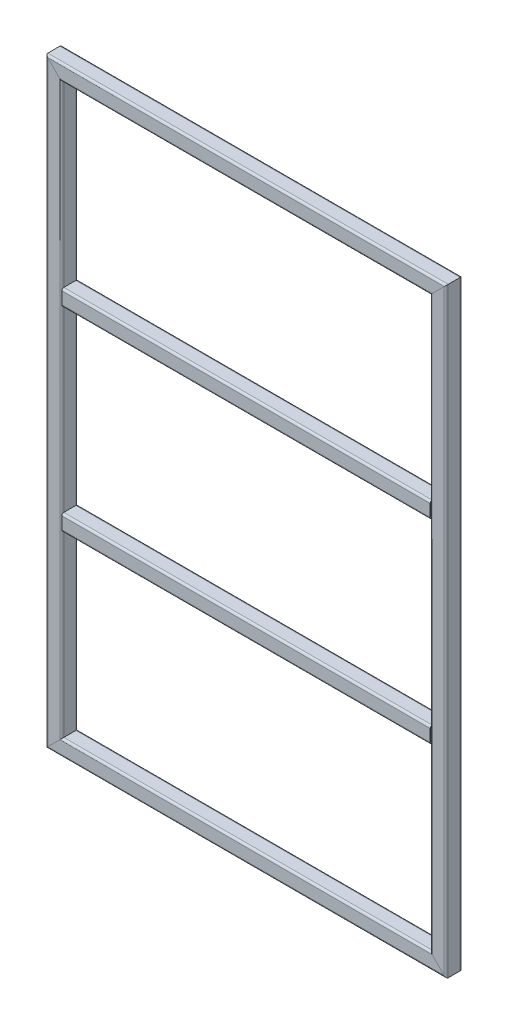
ISO-10303-21;
HEADER;
FILE_DESCRIPTION(('STEP AP214'),'2;1');
FILE_NAME('part.step','',(''),(''),'','','');
FILE_SCHEMA(('AUTOMOTIVE_DESIGN { 1 0 10303 214 1 1 1 1 }'));
ENDSEC;
DATA;
#1=APPLICATION_CONTEXT('core data for automotive mechanical design processes');
#2=APPLICATION_PROTOCOL_DEFINITION('international standard','automotive_design',2000,#1);
#3=PRODUCT_CONTEXT('',#1,'mechanical');
#4=PRODUCT('Part','Part','',(#3));
#5=PRODUCT_RELATED_PRODUCT_CATEGORY('part','',(#4));
#6=PRODUCT_DEFINITION_FORMATION('','',#4);
#7=PRODUCT_DEFINITION_CONTEXT('part definition',#1,'design');
#8=PRODUCT_DEFINITION('design','',#6,#7);
#9=PRODUCT_DEFINITION_SHAPE('','',#8);
#10=(LENGTH_UNIT() NAMED_UNIT(*) SI_UNIT(.MILLI.,.METRE.));
#11=(NAMED_UNIT(*) PLANE_ANGLE_UNIT() SI_UNIT($,.RADIAN.));
#12=(NAMED_UNIT(*) SI_UNIT($,.STERADIAN.) SOLID_ANGLE_UNIT());
#13=UNCERTAINTY_MEASURE_WITH_UNIT(LENGTH_MEASURE(1.E-05),#10,'distance_accuracy_value','');
#14=(GEOMETRIC_REPRESENTATION_CONTEXT(3) GLOBAL_UNCERTAINTY_ASSIGNED_CONTEXT((#13)) GLOBAL_UNIT_ASSIGNED_CONTEXT((#10,
#11,#12)) REPRESENTATION_CONTEXT('',''));
#15=CARTESIAN_POINT('',(0.,0.,0.));
#16=DIRECTION('',(0.,0.,1.));
#17=DIRECTION('',(1.,0.,0.));
#18=AXIS2_PLACEMENT_3D('',#15,#16,#17);
#19=CARTESIAN_POINT('',(-990.,1460.,30.));
#20=DIRECTION('',(0.,-1.,0.));
#21=DIRECTION('',(1.,0.,0.));
#22=AXIS2_PLACEMENT_3D('',#19,#20,#21);
#23=CYLINDRICAL_SURFACE('',#22,10.);
#24=CARTESIAN_POINT('',(-990.,-1490.,30.));
#25=DIRECTION('',(0.707106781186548,-0.707106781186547,0.));
#26=DIRECTION('',(-0.707106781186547,-0.707106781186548,0.));
#27=AXIS2_PLACEMENT_3D('',#24,#25,#26);
#28=ELLIPSE('',#27,14.142135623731,10.);
#29=CARTESIAN_POINT('',(-990.,-1490.,40.));
#30=VERTEX_POINT('',#29);
#31=CARTESIAN_POINT('',(-1000.,-1500.,30.));
#32=VERTEX_POINT('',#31);
#33=EDGE_CURVE('E213',#30,#32,#28,.T.);
#34=ORIENTED_EDGE('',*,*,#33,.F.);
#35=DIRECTION('',(0.,-1.,0.));
#36=VECTOR('',#35,1.);
#37=CARTESIAN_POINT('',(-990.,1460.,40.));
#38=LINE('',#37,#36);
#39=CARTESIAN_POINT('',(-990.,1490.,40.));
#40=VERTEX_POINT('',#39);
#41=EDGE_CURVE('E293',#40,#30,#38,.T.);
#42=ORIENTED_EDGE('',*,*,#41,.F.);
#43=CARTESIAN_POINT('',(-990.,1490.,30.));
#44=DIRECTION('',(0.707106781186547,0.707106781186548,0.));
#45=DIRECTION('',(0.707106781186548,-0.707106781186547,0.));
#46=AXIS2_PLACEMENT_3D('',#43,#44,#45);
#47=ELLIPSE('',#46,14.142135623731,10.);
#48=CARTESIAN_POINT('',(-1000.,1500.,30.));
#49=VERTEX_POINT('',#48);
#50=EDGE_CURVE('E204',#49,#40,#47,.T.);
#51=ORIENTED_EDGE('',*,*,#50,.F.);
#52=DIRECTION('',(0.,-1.,0.));
#53=VECTOR('',#52,1.);
#54=CARTESIAN_POINT('',(-1000.,1460.,30.));
#55=LINE('',#54,#53);
#56=EDGE_CURVE('E73',#49,#32,#55,.T.);
#57=ORIENTED_EDGE('',*,*,#56,.T.);
#58=EDGE_LOOP('',(#34,#42,#51,#57));
#59=FACE_BOUND('',#58,.T.);
#60=ADVANCED_FACE('F69',(#59),#23,.T.);
#61=CARTESIAN_POINT('',(-990.,1460.,40.));
#62=DIRECTION('',(0.,0.,-1.));
#63=DIRECTION('',(-1.,0.,0.));
#64=AXIS2_PLACEMENT_3D('',#61,#62,#63);
#65=PLANE('',#64);
#66=DIRECTION('',(-0.707106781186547,-0.707106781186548,0.));
#67=VECTOR('',#66,1.);
#68=CARTESIAN_POINT('',(485.000000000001,-14.9999999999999,40.));
#69=LINE('',#68,#67);
#70=CARTESIAN_POINT('',(-930.,-1430.,40.));
#71=VERTEX_POINT('',#70);
#72=EDGE_CURVE('E210',#71,#30,#69,.T.);
#73=ORIENTED_EDGE('',*,*,#72,.F.);
#74=DIRECTION('',(0.,-1.,0.));
#75=VECTOR('',#74,1.);
#76=CARTESIAN_POINT('',(-930.,1460.,40.));
#77=LINE('',#76,#75);
#78=CARTESIAN_POINT('',(-930.,1430.,40.));
#79=VERTEX_POINT('',#78);
#80=EDGE_CURVE('E291',#79,#71,#77,.T.);
#81=ORIENTED_EDGE('',*,*,#80,.F.);
#82=DIRECTION('',(0.707106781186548,-0.707106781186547,0.));
#83=VECTOR('',#82,1.);
#84=CARTESIAN_POINT('',(-975.,1475.,40.));
#85=LINE('',#84,#83);
#86=EDGE_CURVE('E309',#40,#79,#85,.T.);
#87=ORIENTED_EDGE('',*,*,#86,.F.);
#88=ORIENTED_EDGE('',*,*,#41,.T.);
#89=EDGE_LOOP('',(#73,#81,#87,#88));
#90=FACE_BOUND('',#89,.T.);
#91=ADVANCED_FACE('F300',(#90),#65,.F.);
#92=CARTESIAN_POINT('',(-930.,1460.,30.));
#93=DIRECTION('',(0.,-1.,0.));
#94=DIRECTION('',(1.,0.,0.));
#95=AXIS2_PLACEMENT_3D('',#92,#93,#94);
#96=CYLINDRICAL_SURFACE('',#95,10.);
#97=CARTESIAN_POINT('',(-930.,-1430.,30.));
#98=DIRECTION('',(0.707106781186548,-0.707106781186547,0.));
#99=DIRECTION('',(-0.707106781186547,-0.707106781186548,0.));
#100=AXIS2_PLACEMENT_3D('',#97,#98,#99);
#101=ELLIPSE('',#100,14.142135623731,10.);
#102=CARTESIAN_POINT('',(-920.,-1420.,30.));
#103=VERTEX_POINT('',#102);
#104=EDGE_CURVE('E13',#103,#71,#101,.T.);
#105=ORIENTED_EDGE('',*,*,#104,.F.);
#106=DIRECTION('',(0.,-1.,0.));
#107=VECTOR('',#106,1.);
#108=CARTESIAN_POINT('',(-919.999999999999,1460.,30.));
#109=LINE('',#108,#107);
#110=CARTESIAN_POINT('',(-919.999999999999,1420.,30.));
#111=VERTEX_POINT('',#110);
#112=EDGE_CURVE('E288',#111,#103,#109,.T.);
#113=ORIENTED_EDGE('',*,*,#112,.F.);
#114=CARTESIAN_POINT('',(-930.,1430.,30.));
#115=DIRECTION('',(0.707106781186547,0.707106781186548,0.));
#116=DIRECTION('',(0.707106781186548,-0.707106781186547,0.));
#117=AXIS2_PLACEMENT_3D('',#114,#115,#116);
#118=ELLIPSE('',#117,14.142135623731,10.);
#119=EDGE_CURVE('E306',#79,#111,#118,.T.);
#120=ORIENTED_EDGE('',*,*,#119,.F.);
#121=ORIENTED_EDGE('',*,*,#80,.T.);
#122=EDGE_LOOP('',(#105,#113,#120,#121));
#123=FACE_BOUND('',#122,.T.);
#124=ADVANCED_FACE('F303',(#123),#96,.T.);
#125=CARTESIAN_POINT('',(-919.999999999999,1460.,-30.));
#126=DIRECTION('',(-1.,0.,0.));
#127=DIRECTION('',(0.,-1.,0.));
#128=AXIS2_PLACEMENT_3D('',#125,#126,#127);
#129=PLANE('',#128);
#130=DIRECTION('',(0.,0.,1.));
#131=VECTOR('',#130,1.);
#132=CARTESIAN_POINT('',(-920.,-1420.,-30.));
#133=LINE('',#132,#131);
#134=CARTESIAN_POINT('',(-920.,-1420.,-30.));
#135=VERTEX_POINT('',#134);
#136=EDGE_CURVE('E79',#135,#103,#133,.T.);
#137=ORIENTED_EDGE('',*,*,#136,.F.);
#138=DIRECTION('',(0.,-1.,0.));
#139=VECTOR('',#138,1.);
#140=CARTESIAN_POINT('',(-919.999999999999,1460.,-30.));
#141=LINE('',#140,#139);
#142=CARTESIAN_POINT('',(-919.999999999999,1420.,-30.));
#143=VERTEX_POINT('',#142);
#144=EDGE_CURVE('E285',#143,#135,#141,.T.);
#145=ORIENTED_EDGE('',*,*,#144,.F.);
#146=DIRECTION('',(0.,0.,-1.));
#147=VECTOR('',#146,1.);
#148=CARTESIAN_POINT('',(-919.999999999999,1420.,-30.));
#149=LINE('',#148,#147);
#150=EDGE_CURVE('E308',#111,#143,#149,.T.);
#151=ORIENTED_EDGE('',*,*,#150,.F.);
#152=ORIENTED_EDGE('',*,*,#112,.T.);
#153=EDGE_LOOP('',(#137,#145,#151,#152));
#154=FACE_BOUND('',#153,.T.);
#155=ADVANCED_FACE('F319',(#154),#129,.F.);
#156=CARTESIAN_POINT('',(-930.,1460.,-30.));
#157=DIRECTION('',(0.,-1.,0.));
#158=DIRECTION('',(1.,0.,0.));
#159=AXIS2_PLACEMENT_3D('',#156,#157,#158);
#160=CYLINDRICAL_SURFACE('',#159,10.);
#161=CARTESIAN_POINT('',(-930.,-1430.,-30.));
#162=DIRECTION('',(0.707106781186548,-0.707106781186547,0.));
#163=DIRECTION('',(-0.707106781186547,-0.707106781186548,0.));
#164=AXIS2_PLACEMENT_3D('',#161,#162,#163);
#165=ELLIPSE('',#164,14.142135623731,10.);
#166=CARTESIAN_POINT('',(-930.,-1430.,-40.));
#167=VERTEX_POINT('',#166);
#168=EDGE_CURVE('E228',#167,#135,#165,.T.);
#169=ORIENTED_EDGE('',*,*,#168,.F.);
#170=DIRECTION('',(0.,-1.,0.));
#171=VECTOR('',#170,1.);
#172=CARTESIAN_POINT('',(-930.,1460.,-40.));
#173=LINE('',#172,#171);
#174=CARTESIAN_POINT('',(-930.,1430.,-40.));
#175=VERTEX_POINT('',#174);
#176=EDGE_CURVE('E282',#175,#167,#173,.T.);
#177=ORIENTED_EDGE('',*,*,#176,.F.);
#178=CARTESIAN_POINT('',(-930.,1430.,-30.));
#179=DIRECTION('',(0.707106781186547,0.707106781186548,0.));
#180=DIRECTION('',(0.707106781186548,-0.707106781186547,0.));
#181=AXIS2_PLACEMENT_3D('',#178,#179,#180);
#182=ELLIPSE('',#181,14.142135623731,10.);
#183=EDGE_CURVE('E215',#143,#175,#182,.T.);
#184=ORIENTED_EDGE('',*,*,#183,.F.);
#185=ORIENTED_EDGE('',*,*,#144,.T.);
#186=EDGE_LOOP('',(#169,#177,#184,#185));
#187=FACE_BOUND('',#186,.T.);
#188=ADVANCED_FACE('F317',(#187),#160,.T.);
#189=CARTESIAN_POINT('',(-930.,1460.,-40.));
#190=DIRECTION('',(0.,0.,1.));
#191=DIRECTION('',(1.,0.,0.));
#192=AXIS2_PLACEMENT_3D('',#189,#190,#191);
#193=PLANE('',#192);
#194=DIRECTION('',(0.707106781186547,0.707106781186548,0.));
#195=VECTOR('',#194,1.);
#196=CARTESIAN_POINT('',(515.,15.0000000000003,-40.));
#197=LINE('',#196,#195);
#198=CARTESIAN_POINT('',(-990.,-1490.,-40.));
#199=VERTEX_POINT('',#198);
#200=EDGE_CURVE('E231',#199,#167,#197,.T.);
#201=ORIENTED_EDGE('',*,*,#200,.F.);
#202=DIRECTION('',(0.,-1.,0.));
#203=VECTOR('',#202,1.);
#204=CARTESIAN_POINT('',(-990.,1460.,-40.));
#205=LINE('',#204,#203);
#206=CARTESIAN_POINT('',(-990.,1490.,-40.));
#207=VERTEX_POINT('',#206);
#208=EDGE_CURVE('E280',#207,#199,#205,.T.);
#209=ORIENTED_EDGE('',*,*,#208,.F.);
#210=DIRECTION('',(-0.707106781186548,0.707106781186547,0.));
#211=VECTOR('',#210,1.);
#212=CARTESIAN_POINT('',(-945.,1445.,-40.));
#213=LINE('',#212,#211);
#214=EDGE_CURVE('E209',#175,#207,#213,.T.);
#215=ORIENTED_EDGE('',*,*,#214,.F.);
#216=ORIENTED_EDGE('',*,*,#176,.T.);
#217=EDGE_LOOP('',(#201,#209,#215,#216));
#218=FACE_BOUND('',#217,.T.);
#219=ADVANCED_FACE('F321',(#218),#193,.F.);
#220=CARTESIAN_POINT('',(-990.,1460.,-30.));
#221=DIRECTION('',(0.,-1.,0.));
#222=DIRECTION('',(1.,0.,0.));
#223=AXIS2_PLACEMENT_3D('',#220,#221,#222);
#224=CYLINDRICAL_SURFACE('',#223,10.);
#225=CARTESIAN_POINT('',(-990.,-1490.,-30.));
#226=DIRECTION('',(0.707106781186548,-0.707106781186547,0.));
#227=DIRECTION('',(-0.707106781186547,-0.707106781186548,0.));
#228=AXIS2_PLACEMENT_3D('',#225,#226,#227);
#229=ELLIPSE('',#228,14.142135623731,10.);
#230=CARTESIAN_POINT('',(-1000.,-1500.,-30.));
#231=VERTEX_POINT('',#230);
#232=EDGE_CURVE('E192',#231,#199,#229,.T.);
#233=ORIENTED_EDGE('',*,*,#232,.F.);
#234=DIRECTION('',(0.,-1.,0.));
#235=VECTOR('',#234,1.);
#236=CARTESIAN_POINT('',(-1000.,1460.,-30.));
#237=LINE('',#236,#235);
#238=CARTESIAN_POINT('',(-1000.,1500.,-30.));
#239=VERTEX_POINT('',#238);
#240=EDGE_CURVE('E184',#239,#231,#237,.T.);
#241=ORIENTED_EDGE('',*,*,#240,.F.);
#242=CARTESIAN_POINT('',(-990.,1490.,-30.));
#243=DIRECTION('',(0.707106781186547,0.707106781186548,0.));
#244=DIRECTION('',(0.707106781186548,-0.707106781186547,0.));
#245=AXIS2_PLACEMENT_3D('',#242,#243,#244);
#246=ELLIPSE('',#245,14.142135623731,10.);
#247=EDGE_CURVE('E189',#207,#239,#246,.T.);
#248=ORIENTED_EDGE('',*,*,#247,.F.);
#249=ORIENTED_EDGE('',*,*,#208,.T.);
#250=EDGE_LOOP('',(#233,#241,#248,#249));
#251=FACE_BOUND('',#250,.T.);
#252=ADVANCED_FACE('F186',(#251),#224,.T.);
#253=CARTESIAN_POINT('',(-930.,1460.,30.));
#254=DIRECTION('',(0.,-1.,0.));
#255=DIRECTION('',(1.,0.,0.));
#256=AXIS2_PLACEMENT_3D('',#253,#254,#255);
#257=CYLINDRICAL_SURFACE('',#256,5.);
#258=DIRECTION('',(0.,-1.,0.));
#259=VECTOR('',#258,1.);
#260=CARTESIAN_POINT('',(-925.,1460.,30.));
#261=LINE('',#260,#259);
#262=CARTESIAN_POINT('',(-925.,1425.,30.));
#263=VERTEX_POINT('',#262);
#264=CARTESIAN_POINT('',(-925.,-1425.,30.));
#265=VERTEX_POINT('',#264);
#266=EDGE_CURVE('E237',#263,#265,#261,.T.);
#267=ORIENTED_EDGE('',*,*,#266,.T.);
#268=CARTESIAN_POINT('',(-930.,-1430.,30.));
#269=DIRECTION('',(0.707106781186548,-0.707106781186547,0.));
#270=DIRECTION('',(-0.707106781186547,-0.707106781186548,0.));
#271=AXIS2_PLACEMENT_3D('',#268,#269,#270);
#272=ELLIPSE('',#271,7.07106781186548,5.);
#273=CARTESIAN_POINT('',(-929.999999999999,-1430.,35.));
#274=VERTEX_POINT('',#273);
#275=EDGE_CURVE('E115',#265,#274,#272,.T.);
#276=ORIENTED_EDGE('',*,*,#275,.T.);
#277=DIRECTION('',(0.,-1.,0.));
#278=VECTOR('',#277,1.);
#279=CARTESIAN_POINT('',(-930.,1460.,35.));
#280=LINE('',#279,#278);
#281=CARTESIAN_POINT('',(-929.999999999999,1430.,35.));
#282=VERTEX_POINT('',#281);
#283=EDGE_CURVE('E240',#282,#274,#280,.T.);
#284=ORIENTED_EDGE('',*,*,#283,.F.);
#285=CARTESIAN_POINT('',(-930.,1430.,30.));
#286=DIRECTION('',(0.707106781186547,0.707106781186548,0.));
#287=DIRECTION('',(0.707106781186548,-0.707106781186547,0.));
#288=AXIS2_PLACEMENT_3D('',#285,#286,#287);
#289=ELLIPSE('',#288,7.07106781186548,5.);
#290=EDGE_CURVE('E236',#282,#263,#289,.T.);
#291=ORIENTED_EDGE('',*,*,#290,.T.);
#292=EDGE_LOOP('',(#267,#276,#284,#291));
#293=FACE_BOUND('',#292,.T.);
#294=ADVANCED_FACE('F328',(#293),#257,.F.);
#295=CARTESIAN_POINT('',(-990.,1460.,35.));
#296=DIRECTION('',(0.,0.,-1.));
#297=DIRECTION('',(-1.,0.,0.));
#298=AXIS2_PLACEMENT_3D('',#295,#296,#297);
#299=PLANE('',#298);
#300=ORIENTED_EDGE('',*,*,#283,.T.);
#301=DIRECTION('',(-0.707106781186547,-0.707106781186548,0.));
#302=VECTOR('',#301,1.);
#303=CARTESIAN_POINT('',(485.000000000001,-14.9999999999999,35.));
#304=LINE('',#303,#302);
#305=CARTESIAN_POINT('',(-990.,-1490.,35.));
#306=VERTEX_POINT('',#305);
#307=EDGE_CURVE('E88',#274,#306,#304,.T.);
#308=ORIENTED_EDGE('',*,*,#307,.T.);
#309=DIRECTION('',(0.,-1.,0.));
#310=VECTOR('',#309,1.);
#311=CARTESIAN_POINT('',(-990.,1460.,35.));
#312=LINE('',#311,#310);
#313=CARTESIAN_POINT('',(-990.,1490.,35.));
#314=VERTEX_POINT('',#313);
#315=EDGE_CURVE('E245',#314,#306,#312,.T.);
#316=ORIENTED_EDGE('',*,*,#315,.F.);
#317=DIRECTION('',(0.707106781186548,-0.707106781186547,0.));
#318=VECTOR('',#317,1.);
#319=CARTESIAN_POINT('',(-975.,1475.,35.));
#320=LINE('',#319,#318);
#321=EDGE_CURVE('E239',#314,#282,#320,.T.);
#322=ORIENTED_EDGE('',*,*,#321,.T.);
#323=EDGE_LOOP('',(#300,#308,#316,#322));
#324=FACE_BOUND('',#323,.T.);
#325=ADVANCED_FACE('F370',(#324),#299,.T.);
#326=CARTESIAN_POINT('',(-990.,1460.,30.));
#327=DIRECTION('',(0.,-1.,0.));
#328=DIRECTION('',(1.,0.,0.));
#329=AXIS2_PLACEMENT_3D('',#326,#327,#328);
#330=CYLINDRICAL_SURFACE('',#329,5.);
#331=ORIENTED_EDGE('',*,*,#315,.T.);
#332=CARTESIAN_POINT('',(-990.,-1490.,30.));
#333=DIRECTION('',(0.707106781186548,-0.707106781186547,0.));
#334=DIRECTION('',(-0.707106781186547,-0.707106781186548,0.));
#335=AXIS2_PLACEMENT_3D('',#332,#333,#334);
#336=ELLIPSE('',#335,7.07106781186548,5.);
#337=CARTESIAN_POINT('',(-995.,-1495.,30.));
#338=VERTEX_POINT('',#337);
#339=EDGE_CURVE('E241',#306,#338,#336,.T.);
#340=ORIENTED_EDGE('',*,*,#339,.T.);
#341=DIRECTION('',(0.,-1.,0.));
#342=VECTOR('',#341,1.);
#343=CARTESIAN_POINT('',(-995.,1460.,30.));
#344=LINE('',#343,#342);
#345=CARTESIAN_POINT('',(-995.,1495.,30.));
#346=VERTEX_POINT('',#345);
#347=EDGE_CURVE('E250',#346,#338,#344,.T.);
#348=ORIENTED_EDGE('',*,*,#347,.F.);
#349=CARTESIAN_POINT('',(-990.,1490.,30.));
#350=DIRECTION('',(0.707106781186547,0.707106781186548,0.));
#351=DIRECTION('',(0.707106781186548,-0.707106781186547,0.));
#352=AXIS2_PLACEMENT_3D('',#349,#350,#351);
#353=ELLIPSE('',#352,7.07106781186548,5.);
#354=EDGE_CURVE('E244',#346,#314,#353,.T.);
#355=ORIENTED_EDGE('',*,*,#354,.T.);
#356=EDGE_LOOP('',(#331,#340,#348,#355));
#357=FACE_BOUND('',#356,.T.);
#358=ADVANCED_FACE('F381',(#357),#330,.F.);
#359=CARTESIAN_POINT('',(-995.,1460.,30.));
#360=DIRECTION('',(1.,0.,0.));
#361=DIRECTION('',(0.,1.,0.));
#362=AXIS2_PLACEMENT_3D('',#359,#360,#361);
#363=PLANE('',#362);
#364=ORIENTED_EDGE('',*,*,#347,.T.);
#365=DIRECTION('',(0.,0.,-1.));
#366=VECTOR('',#365,1.);
#367=CARTESIAN_POINT('',(-995.,-1495.,30.));
#368=LINE('',#367,#366);
#369=CARTESIAN_POINT('',(-995.,-1495.,-30.));
#370=VERTEX_POINT('',#369);
#371=EDGE_CURVE('E246',#338,#370,#368,.T.);
#372=ORIENTED_EDGE('',*,*,#371,.T.);
#373=DIRECTION('',(0.,-1.,0.));
#374=VECTOR('',#373,1.);
#375=CARTESIAN_POINT('',(-995.,1460.,-30.));
#376=LINE('',#375,#374);
#377=CARTESIAN_POINT('',(-995.,1495.,-30.));
#378=VERTEX_POINT('',#377);
#379=EDGE_CURVE('E255',#378,#370,#376,.T.);
#380=ORIENTED_EDGE('',*,*,#379,.F.);
#381=DIRECTION('',(0.,0.,1.));
#382=VECTOR('',#381,1.);
#383=CARTESIAN_POINT('',(-995.,1495.,30.));
#384=LINE('',#383,#382);
#385=EDGE_CURVE('E249',#378,#346,#384,.T.);
#386=ORIENTED_EDGE('',*,*,#385,.T.);
#387=EDGE_LOOP('',(#364,#372,#380,#386));
#388=FACE_BOUND('',#387,.T.);
#389=ADVANCED_FACE('F392',(#388),#363,.T.);
#390=CARTESIAN_POINT('',(-990.,1460.,-30.));
#391=DIRECTION('',(0.,-1.,0.));
#392=DIRECTION('',(1.,0.,0.));
#393=AXIS2_PLACEMENT_3D('',#390,#391,#392);
#394=CYLINDRICAL_SURFACE('',#393,5.);
#395=ORIENTED_EDGE('',*,*,#379,.T.);
#396=CARTESIAN_POINT('',(-990.,-1490.,-30.));
#397=DIRECTION('',(0.707106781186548,-0.707106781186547,0.));
#398=DIRECTION('',(-0.707106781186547,-0.707106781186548,0.));
#399=AXIS2_PLACEMENT_3D('',#396,#397,#398);
#400=ELLIPSE('',#399,7.07106781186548,5.);
#401=CARTESIAN_POINT('',(-990.,-1490.,-35.));
#402=VERTEX_POINT('',#401);
#403=EDGE_CURVE('E251',#370,#402,#400,.T.);
#404=ORIENTED_EDGE('',*,*,#403,.T.);
#405=DIRECTION('',(0.,-1.,0.));
#406=VECTOR('',#405,1.);
#407=CARTESIAN_POINT('',(-990.,1460.,-35.));
#408=LINE('',#407,#406);
#409=CARTESIAN_POINT('',(-990.,1490.,-35.));
#410=VERTEX_POINT('',#409);
#411=EDGE_CURVE('E260',#410,#402,#408,.T.);
#412=ORIENTED_EDGE('',*,*,#411,.F.);
#413=CARTESIAN_POINT('',(-990.,1490.,-30.));
#414=DIRECTION('',(0.707106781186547,0.707106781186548,0.));
#415=DIRECTION('',(0.707106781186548,-0.707106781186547,0.));
#416=AXIS2_PLACEMENT_3D('',#413,#414,#415);
#417=ELLIPSE('',#416,7.07106781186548,5.);
#418=EDGE_CURVE('E254',#410,#378,#417,.T.);
#419=ORIENTED_EDGE('',*,*,#418,.T.);
#420=EDGE_LOOP('',(#395,#404,#412,#419));
#421=FACE_BOUND('',#420,.T.);
#422=ADVANCED_FACE('F403',(#421),#394,.F.);
#423=CARTESIAN_POINT('',(-930.,1460.,-35.));
#424=DIRECTION('',(0.,0.,1.));
#425=DIRECTION('',(1.,0.,0.));
#426=AXIS2_PLACEMENT_3D('',#423,#424,#425);
#427=PLANE('',#426);
#428=ORIENTED_EDGE('',*,*,#411,.T.);
#429=DIRECTION('',(0.707106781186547,0.707106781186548,0.));
#430=VECTOR('',#429,1.);
#431=CARTESIAN_POINT('',(515.,15.0000000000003,-35.));
#432=LINE('',#431,#430);
#433=CARTESIAN_POINT('',(-930.,-1430.,-35.));
#434=VERTEX_POINT('',#433);
#435=EDGE_CURVE('E256',#402,#434,#432,.T.);
#436=ORIENTED_EDGE('',*,*,#435,.T.);
#437=DIRECTION('',(0.,-1.,0.));
#438=VECTOR('',#437,1.);
#439=CARTESIAN_POINT('',(-930.,1460.,-35.));
#440=LINE('',#439,#438);
#441=CARTESIAN_POINT('',(-930.,1430.,-35.));
#442=VERTEX_POINT('',#441);
#443=EDGE_CURVE('E264',#442,#434,#440,.T.);
#444=ORIENTED_EDGE('',*,*,#443,.F.);
#445=DIRECTION('',(-0.707106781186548,0.707106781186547,0.));
#446=VECTOR('',#445,1.);
#447=CARTESIAN_POINT('',(-945.,1445.,-35.));
#448=LINE('',#447,#446);
#449=EDGE_CURVE('E259',#442,#410,#448,.T.);
#450=ORIENTED_EDGE('',*,*,#449,.T.);
#451=EDGE_LOOP('',(#428,#436,#444,#450));
#452=FACE_BOUND('',#451,.T.);
#453=ADVANCED_FACE('F414',(#452),#427,.T.);
#454=CARTESIAN_POINT('',(-930.,1460.,-30.));
#455=DIRECTION('',(0.,-1.,0.));
#456=DIRECTION('',(1.,0.,0.));
#457=AXIS2_PLACEMENT_3D('',#454,#455,#456);
#458=CYLINDRICAL_SURFACE('',#457,5.);
#459=ORIENTED_EDGE('',*,*,#443,.T.);
#460=CARTESIAN_POINT('',(-930.,-1430.,-30.));
#461=DIRECTION('',(0.707106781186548,-0.707106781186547,0.));
#462=DIRECTION('',(-0.707106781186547,-0.707106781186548,0.));
#463=AXIS2_PLACEMENT_3D('',#460,#461,#462);
#464=ELLIPSE('',#463,7.07106781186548,5.);
#465=CARTESIAN_POINT('',(-925.,-1425.,-30.));
#466=VERTEX_POINT('',#465);
#467=EDGE_CURVE('E261',#434,#466,#464,.T.);
#468=ORIENTED_EDGE('',*,*,#467,.T.);
#469=DIRECTION('',(0.,-1.,0.));
#470=VECTOR('',#469,1.);
#471=CARTESIAN_POINT('',(-925.,1460.,-30.));
#472=LINE('',#471,#470);
#473=CARTESIAN_POINT('',(-925.,1425.,-30.));
#474=VERTEX_POINT('',#473);
#475=EDGE_CURVE('E222',#474,#466,#472,.T.);
#476=ORIENTED_EDGE('',*,*,#475,.F.);
#477=CARTESIAN_POINT('',(-930.,1430.,-30.));
#478=DIRECTION('',(0.707106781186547,0.707106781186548,0.));
#479=DIRECTION('',(0.707106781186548,-0.707106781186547,0.));
#480=AXIS2_PLACEMENT_3D('',#477,#478,#479);
#481=ELLIPSE('',#480,7.07106781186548,5.);
#482=EDGE_CURVE('E263',#474,#442,#481,.T.);
#483=ORIENTED_EDGE('',*,*,#482,.T.);
#484=EDGE_LOOP('',(#459,#468,#476,#483));
#485=FACE_BOUND('',#484,.T.);
#486=ADVANCED_FACE('F425',(#485),#458,.F.);
#487=CARTESIAN_POINT('',(-925.,1460.,-30.));
#488=DIRECTION('',(-1.,0.,0.));
#489=DIRECTION('',(0.,-1.,0.));
#490=AXIS2_PLACEMENT_3D('',#487,#488,#489);
#491=PLANE('',#490);
#492=ORIENTED_EDGE('',*,*,#475,.T.);
#493=DIRECTION('',(0.,0.,1.));
#494=VECTOR('',#493,1.);
#495=CARTESIAN_POINT('',(-925.,-1425.,-30.));
#496=LINE('',#495,#494);
#497=EDGE_CURVE('E110',#466,#265,#496,.T.);
#498=ORIENTED_EDGE('',*,*,#497,.T.);
#499=ORIENTED_EDGE('',*,*,#266,.F.);
#500=DIRECTION('',(0.,0.,-1.));
#501=VECTOR('',#500,1.);
#502=CARTESIAN_POINT('',(-925.,1425.,-30.));
#503=LINE('',#502,#501);
#504=EDGE_CURVE('E197',#263,#474,#503,.T.);
#505=ORIENTED_EDGE('',*,*,#504,.T.);
#506=EDGE_LOOP('',(#492,#498,#499,#505));
#507=FACE_BOUND('',#506,.T.);
#508=ADVANCED_FACE('F436',(#507),#491,.T.);
#509=CARTESIAN_POINT('',(-1000.,1460.,30.));
#510=DIRECTION('',(1.,0.,0.));
#511=DIRECTION('',(0.,1.,0.));
#512=AXIS2_PLACEMENT_3D('',#509,#510,#511);
#513=PLANE('',#512);
#514=DIRECTION('',(0.,0.,-1.));
#515=VECTOR('',#514,1.);
#516=CARTESIAN_POINT('',(-1000.,-1500.,30.));
#517=LINE('',#516,#515);
#518=EDGE_CURVE('E224',#32,#231,#517,.T.);
#519=ORIENTED_EDGE('',*,*,#518,.F.);
#520=ORIENTED_EDGE('',*,*,#56,.F.);
#521=DIRECTION('',(0.,0.,1.));
#522=VECTOR('',#521,1.);
#523=CARTESIAN_POINT('',(-1000.,1500.,30.));
#524=LINE('',#523,#522);
#525=EDGE_CURVE('E196',#239,#49,#524,.T.);
#526=ORIENTED_EDGE('',*,*,#525,.F.);
#527=ORIENTED_EDGE('',*,*,#240,.T.);
#528=EDGE_LOOP('',(#519,#520,#526,#527));
#529=FACE_BOUND('',#528,.T.);
#530=ADVANCED_FACE('F200',(#529),#513,.F.);
#531=CARTESIAN_POINT('',(-960.,1460.,0.));
#532=DIRECTION('',(0.707106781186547,0.707106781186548,0.));
#533=DIRECTION('',(-0.707106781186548,0.707106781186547,0.));
#534=AXIS2_PLACEMENT_3D('',#531,#532,#533);
#535=PLANE('',#534);
#536=ORIENTED_EDGE('',*,*,#290,.F.);
#537=ORIENTED_EDGE('',*,*,#321,.F.);
#538=ORIENTED_EDGE('',*,*,#354,.F.);
#539=ORIENTED_EDGE('',*,*,#385,.F.);
#540=ORIENTED_EDGE('',*,*,#418,.F.);
#541=ORIENTED_EDGE('',*,*,#449,.F.);
#542=ORIENTED_EDGE('',*,*,#482,.F.);
#543=ORIENTED_EDGE('',*,*,#504,.F.);
#544=EDGE_LOOP('',(#536,#537,#538,#539,#540,#541,#542,#543));
#545=FACE_BOUND('',#544,.T.);
#546=ORIENTED_EDGE('',*,*,#525,.T.);
#547=ORIENTED_EDGE('',*,*,#50,.T.);
#548=ORIENTED_EDGE('',*,*,#86,.T.);
#549=ORIENTED_EDGE('',*,*,#119,.T.);
#550=ORIENTED_EDGE('',*,*,#150,.T.);
#551=ORIENTED_EDGE('',*,*,#183,.T.);
#552=ORIENTED_EDGE('',*,*,#214,.T.);
#553=ORIENTED_EDGE('',*,*,#247,.T.);
#554=EDGE_LOOP('',(#546,#547,#548,#549,#550,#551,#552,#553));
#555=FACE_BOUND('',#554,.T.);
#556=ADVANCED_FACE('F207',(#545,#555),#535,.T.);
#557=CARTESIAN_POINT('',(-960.,-1460.,0.));
#558=DIRECTION('',(0.707106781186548,-0.707106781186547,0.));
#559=DIRECTION('',(0.707106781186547,0.707106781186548,0.));
#560=AXIS2_PLACEMENT_3D('',#557,#558,#559);
#561=PLANE('',#560);
#562=ORIENTED_EDGE('',*,*,#275,.F.);
#563=ORIENTED_EDGE('',*,*,#497,.F.);
#564=ORIENTED_EDGE('',*,*,#467,.F.);
#565=ORIENTED_EDGE('',*,*,#435,.F.);
#566=ORIENTED_EDGE('',*,*,#403,.F.);
#567=ORIENTED_EDGE('',*,*,#371,.F.);
#568=ORIENTED_EDGE('',*,*,#339,.F.);
#569=ORIENTED_EDGE('',*,*,#307,.F.);
#570=EDGE_LOOP('',(#562,#563,#564,#565,#566,#567,#568,#569));
#571=FACE_BOUND('',#570,.T.);
#572=ORIENTED_EDGE('',*,*,#72,.T.);
#573=ORIENTED_EDGE('',*,*,#33,.T.);
#574=ORIENTED_EDGE('',*,*,#518,.T.);
#575=ORIENTED_EDGE('',*,*,#232,.T.);
#576=ORIENTED_EDGE('',*,*,#200,.T.);
#577=ORIENTED_EDGE('',*,*,#168,.T.);
#578=ORIENTED_EDGE('',*,*,#136,.T.);
#579=ORIENTED_EDGE('',*,*,#104,.T.);
#580=EDGE_LOOP('',(#572,#573,#574,#575,#576,#577,#578,#579));
#581=FACE_BOUND('',#580,.T.);
#582=ADVANCED_FACE('F71',(#571,#581),#561,.T.);
#583=CLOSED_SHELL('',(#60,#91,#124,#155,#188,#219,#252,#294,#325,#358,#389,#422,#453,#486,#508,
#530,#556,#582));
#584=MANIFOLD_SOLID_BREP('B2',#583);
#585=CARTESIAN_POINT('',(-959.999999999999,-1490.,30.));
#586=DIRECTION('',(1.,0.,0.));
#587=DIRECTION('',(0.,1.,0.));
#588=AXIS2_PLACEMENT_3D('',#585,#586,#587);
#589=CYLINDRICAL_SURFACE('',#588,10.);
#590=CARTESIAN_POINT('',(-989.999999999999,-1490.,30.));
#591=DIRECTION('',(-0.707106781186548,0.707106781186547,0.));
#592=DIRECTION('',(0.707106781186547,0.707106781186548,0.));
#593=AXIS2_PLACEMENT_3D('',#590,#591,#592);
#594=ELLIPSE('',#593,14.142135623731,10.);
#595=CARTESIAN_POINT('',(-999.999999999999,-1500.,30.));
#596=VERTEX_POINT('',#595);
#597=CARTESIAN_POINT('',(-989.999999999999,-1490.,40.));
#598=VERTEX_POINT('',#597);
#599=EDGE_CURVE('E693',#596,#598,#594,.T.);
#600=ORIENTED_EDGE('',*,*,#599,.F.);
#601=DIRECTION('',(1.,0.,0.));
#602=VECTOR('',#601,1.);
#603=CARTESIAN_POINT('',(-959.999999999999,-1500.,30.));
#604=LINE('',#603,#602);
#605=CARTESIAN_POINT('',(1000.,-1500.,30.));
#606=VERTEX_POINT('',#605);
#607=EDGE_CURVE('E569',#596,#606,#604,.T.);
#608=ORIENTED_EDGE('',*,*,#607,.T.);
#609=CARTESIAN_POINT('',(990.,-1490.,30.));
#610=DIRECTION('',(0.707106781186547,0.707106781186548,0.));
#611=DIRECTION('',(0.707106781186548,-0.707106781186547,0.));
#612=AXIS2_PLACEMENT_3D('',#609,#610,#611);
#613=ELLIPSE('',#612,14.142135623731,10.);
#614=CARTESIAN_POINT('',(990.,-1490.,40.));
#615=VERTEX_POINT('',#614);
#616=EDGE_CURVE('E774',#615,#606,#613,.T.);
#617=ORIENTED_EDGE('',*,*,#616,.F.);
#618=DIRECTION('',(1.,0.,0.));
#619=VECTOR('',#618,1.);
#620=CARTESIAN_POINT('',(-959.999999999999,-1490.,40.));
#621=LINE('',#620,#619);
#622=EDGE_CURVE('E767',#598,#615,#621,.T.);
#623=ORIENTED_EDGE('',*,*,#622,.F.);
#624=EDGE_LOOP('',(#600,#608,#617,#623));
#625=FACE_BOUND('',#624,.T.);
#626=ADVANCED_FACE('F565',(#625),#589,.T.);
#627=CARTESIAN_POINT('',(-959.999999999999,-1490.,40.));
#628=DIRECTION('',(0.,0.,-1.));
#629=DIRECTION('',(-1.,0.,0.));
#630=AXIS2_PLACEMENT_3D('',#627,#628,#629);
#631=PLANE('',#630);
#632=DIRECTION('',(0.707106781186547,0.707106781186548,0.));
#633=VECTOR('',#632,1.);
#634=CARTESIAN_POINT('',(-974.999999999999,-1475.,40.));
#635=LINE('',#634,#633);
#636=CARTESIAN_POINT('',(-929.999999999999,-1430.,40.));
#637=VERTEX_POINT('',#636);
#638=EDGE_CURVE('E711',#598,#637,#635,.T.);
#639=ORIENTED_EDGE('',*,*,#638,.F.);
#640=ORIENTED_EDGE('',*,*,#622,.T.);
#641=DIRECTION('',(0.707106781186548,-0.707106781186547,0.));
#642=VECTOR('',#641,1.);
#643=CARTESIAN_POINT('',(15.,-515.,40.));
#644=LINE('',#643,#642);
#645=CARTESIAN_POINT('',(930.,-1430.,40.));
#646=VERTEX_POINT('',#645);
#647=EDGE_CURVE('E683',#646,#615,#644,.T.);
#648=ORIENTED_EDGE('',*,*,#647,.F.);
#649=DIRECTION('',(1.,0.,0.));
#650=VECTOR('',#649,1.);
#651=CARTESIAN_POINT('',(-959.999999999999,-1430.,40.));
#652=LINE('',#651,#650);
#653=EDGE_CURVE('E766',#637,#646,#652,.T.);
#654=ORIENTED_EDGE('',*,*,#653,.F.);
#655=EDGE_LOOP('',(#639,#640,#648,#654));
#656=FACE_BOUND('',#655,.T.);
#657=ADVANCED_FACE('F821',(#656),#631,.F.);
#658=CARTESIAN_POINT('',(-959.999999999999,-1430.,30.));
#659=DIRECTION('',(1.,0.,0.));
#660=DIRECTION('',(0.,1.,0.));
#661=AXIS2_PLACEMENT_3D('',#658,#659,#660);
#662=CYLINDRICAL_SURFACE('',#661,10.);
#663=CARTESIAN_POINT('',(-929.999999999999,-1430.,30.));
#664=DIRECTION('',(-0.707106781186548,0.707106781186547,0.));
#665=DIRECTION('',(0.707106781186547,0.707106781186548,0.));
#666=AXIS2_PLACEMENT_3D('',#663,#664,#665);
#667=ELLIPSE('',#666,14.142135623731,10.);
#668=CARTESIAN_POINT('',(-919.999999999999,-1420.,30.));
#669=VERTEX_POINT('',#668);
#670=EDGE_CURVE('E708',#637,#669,#667,.T.);
#671=ORIENTED_EDGE('',*,*,#670,.F.);
#672=ORIENTED_EDGE('',*,*,#653,.T.);
#673=CARTESIAN_POINT('',(930.,-1430.,30.));
#674=DIRECTION('',(0.707106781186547,0.707106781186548,0.));
#675=DIRECTION('',(0.707106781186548,-0.707106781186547,0.));
#676=AXIS2_PLACEMENT_3D('',#673,#674,#675);
#677=ELLIPSE('',#676,14.142135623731,10.);
#678=CARTESIAN_POINT('',(919.999999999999,-1420.,30.));
#679=VERTEX_POINT('',#678);
#680=EDGE_CURVE('E694',#679,#646,#677,.T.);
#681=ORIENTED_EDGE('',*,*,#680,.F.);
#682=DIRECTION('',(1.,0.,0.));
#683=VECTOR('',#682,1.);
#684=CARTESIAN_POINT('',(-959.999999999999,-1420.,30.));
#685=LINE('',#684,#683);
#686=EDGE_CURVE('E764',#669,#679,#685,.T.);
#687=ORIENTED_EDGE('',*,*,#686,.F.);
#688=EDGE_LOOP('',(#671,#672,#681,#687));
#689=FACE_BOUND('',#688,.T.);
#690=ADVANCED_FACE('F819',(#689),#662,.T.);
#691=CARTESIAN_POINT('',(-959.999999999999,-1420.,-30.));
#692=DIRECTION('',(0.,-1.,0.));
#693=DIRECTION('',(1.,0.,0.));
#694=AXIS2_PLACEMENT_3D('',#691,#692,#693);
#695=PLANE('',#694);
#696=DIRECTION('',(0.,0.,-1.));
#697=VECTOR('',#696,1.);
#698=CARTESIAN_POINT('',(-919.999999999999,-1420.,-30.));
#699=LINE('',#698,#697);
#700=CARTESIAN_POINT('',(-919.999999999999,-1420.,-30.));
#701=VERTEX_POINT('',#700);
#702=EDGE_CURVE('E703',#669,#701,#699,.T.);
#703=ORIENTED_EDGE('',*,*,#702,.F.);
#704=ORIENTED_EDGE('',*,*,#686,.T.);
#705=DIRECTION('',(0.,0.,1.));
#706=VECTOR('',#705,1.);
#707=CARTESIAN_POINT('',(919.999999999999,-1420.,-30.));
#708=LINE('',#707,#706);
#709=CARTESIAN_POINT('',(920.,-1420.,-30.));
#710=VERTEX_POINT('',#709);
#711=EDGE_CURVE('E813',#710,#679,#708,.T.);
#712=ORIENTED_EDGE('',*,*,#711,.F.);
#713=DIRECTION('',(1.,0.,0.));
#714=VECTOR('',#713,1.);
#715=CARTESIAN_POINT('',(-959.999999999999,-1420.,-30.));
#716=LINE('',#715,#714);
#717=EDGE_CURVE('E762',#701,#710,#716,.T.);
#718=ORIENTED_EDGE('',*,*,#717,.F.);
#719=EDGE_LOOP('',(#703,#704,#712,#718));
#720=FACE_BOUND('',#719,.T.);
#721=ADVANCED_FACE('F828',(#720),#695,.F.);
#722=CARTESIAN_POINT('',(-959.999999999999,-1430.,-30.));
#723=DIRECTION('',(1.,0.,0.));
#724=DIRECTION('',(0.,1.,0.));
#725=AXIS2_PLACEMENT_3D('',#722,#723,#724);
#726=CYLINDRICAL_SURFACE('',#725,10.);
#727=CARTESIAN_POINT('',(-929.999999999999,-1430.,-30.));
#728=DIRECTION('',(-0.707106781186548,0.707106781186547,0.));
#729=DIRECTION('',(0.707106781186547,0.707106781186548,0.));
#730=AXIS2_PLACEMENT_3D('',#727,#728,#729);
#731=ELLIPSE('',#730,14.142135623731,10.);
#732=CARTESIAN_POINT('',(-929.999999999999,-1430.,-40.));
#733=VERTEX_POINT('',#732);
#734=EDGE_CURVE('E699',#701,#733,#731,.T.);
#735=ORIENTED_EDGE('',*,*,#734,.F.);
#736=ORIENTED_EDGE('',*,*,#717,.T.);
#737=CARTESIAN_POINT('',(930.,-1430.,-30.));
#738=DIRECTION('',(0.707106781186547,0.707106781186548,0.));
#739=DIRECTION('',(0.707106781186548,-0.707106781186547,0.));
#740=AXIS2_PLACEMENT_3D('',#737,#738,#739);
#741=ELLIPSE('',#740,14.142135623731,10.);
#742=CARTESIAN_POINT('',(930.,-1430.,-40.));
#743=VERTEX_POINT('',#742);
#744=EDGE_CURVE('E810',#743,#710,#741,.T.);
#745=ORIENTED_EDGE('',*,*,#744,.F.);
#746=DIRECTION('',(1.,0.,0.));
#747=VECTOR('',#746,1.);
#748=CARTESIAN_POINT('',(-959.999999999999,-1430.,-40.));
#749=LINE('',#748,#747);
#750=EDGE_CURVE('E760',#733,#743,#749,.T.);
#751=ORIENTED_EDGE('',*,*,#750,.F.);
#752=EDGE_LOOP('',(#735,#736,#745,#751));
#753=FACE_BOUND('',#752,.T.);
#754=ADVANCED_FACE('F833',(#753),#726,.T.);
#755=CARTESIAN_POINT('',(-959.999999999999,-1430.,-40.));
#756=DIRECTION('',(0.,0.,1.));
#757=DIRECTION('',(1.,0.,0.));
#758=AXIS2_PLACEMENT_3D('',#755,#756,#757);
#759=PLANE('',#758);
#760=DIRECTION('',(-0.707106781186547,-0.707106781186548,0.));
#761=VECTOR('',#760,1.);
#762=CARTESIAN_POINT('',(-944.999999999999,-1445.,-40.));
#763=LINE('',#762,#761);
#764=CARTESIAN_POINT('',(-989.999999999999,-1490.,-40.));
#765=VERTEX_POINT('',#764);
#766=EDGE_CURVE('E575',#733,#765,#763,.T.);
#767=ORIENTED_EDGE('',*,*,#766,.F.);
#768=ORIENTED_EDGE('',*,*,#750,.T.);
#769=DIRECTION('',(-0.707106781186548,0.707106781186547,0.));
#770=VECTOR('',#769,1.);
#771=CARTESIAN_POINT('',(-14.9999999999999,-485.,-40.));
#772=LINE('',#771,#770);
#773=CARTESIAN_POINT('',(990.,-1490.,-40.));
#774=VERTEX_POINT('',#773);
#775=EDGE_CURVE('E807',#774,#743,#772,.T.);
#776=ORIENTED_EDGE('',*,*,#775,.F.);
#777=DIRECTION('',(1.,0.,0.));
#778=VECTOR('',#777,1.);
#779=CARTESIAN_POINT('',(-959.999999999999,-1490.,-40.));
#780=LINE('',#779,#778);
#781=EDGE_CURVE('E718',#765,#774,#780,.T.);
#782=ORIENTED_EDGE('',*,*,#781,.F.);
#783=EDGE_LOOP('',(#767,#768,#776,#782));
#784=FACE_BOUND('',#783,.T.);
#785=ADVANCED_FACE('F837',(#784),#759,.F.);
#786=CARTESIAN_POINT('',(-959.999999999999,-1490.,-30.));
#787=DIRECTION('',(1.,0.,0.));
#788=DIRECTION('',(0.,1.,0.));
#789=AXIS2_PLACEMENT_3D('',#786,#787,#788);
#790=CYLINDRICAL_SURFACE('',#789,10.);
#791=CARTESIAN_POINT('',(-989.999999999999,-1490.,-30.));
#792=DIRECTION('',(-0.707106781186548,0.707106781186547,0.));
#793=DIRECTION('',(0.707106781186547,0.707106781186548,0.));
#794=AXIS2_PLACEMENT_3D('',#791,#792,#793);
#795=ELLIPSE('',#794,14.142135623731,10.);
#796=CARTESIAN_POINT('',(-999.999999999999,-1500.,-30.));
#797=VERTEX_POINT('',#796);
#798=EDGE_CURVE('E67',#765,#797,#795,.T.);
#799=ORIENTED_EDGE('',*,*,#798,.F.);
#800=ORIENTED_EDGE('',*,*,#781,.T.);
#801=CARTESIAN_POINT('',(990.,-1490.,-30.));
#802=DIRECTION('',(0.707106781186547,0.707106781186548,0.));
#803=DIRECTION('',(0.707106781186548,-0.707106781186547,0.));
#804=AXIS2_PLACEMENT_3D('',#801,#802,#803);
#805=ELLIPSE('',#804,14.142135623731,10.);
#806=CARTESIAN_POINT('',(1000.,-1500.,-30.));
#807=VERTEX_POINT('',#806);
#808=EDGE_CURVE('E679',#807,#774,#805,.T.);
#809=ORIENTED_EDGE('',*,*,#808,.F.);
#810=DIRECTION('',(1.,0.,0.));
#811=VECTOR('',#810,1.);
#812=CARTESIAN_POINT('',(-959.999999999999,-1500.,-30.));
#813=LINE('',#812,#811);
#814=EDGE_CURVE('E674',#797,#807,#813,.T.);
#815=ORIENTED_EDGE('',*,*,#814,.F.);
#816=EDGE_LOOP('',(#799,#800,#809,#815));
#817=FACE_BOUND('',#816,.T.);
#818=ADVANCED_FACE('F676',(#817),#790,.T.);
#819=CARTESIAN_POINT('',(-959.999999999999,-1430.,30.));
#820=DIRECTION('',(1.,0.,0.));
#821=DIRECTION('',(0.,1.,0.));
#822=AXIS2_PLACEMENT_3D('',#819,#820,#821);
#823=CYLINDRICAL_SURFACE('',#822,5.);
#824=DIRECTION('',(1.,0.,0.));
#825=VECTOR('',#824,1.);
#826=CARTESIAN_POINT('',(-959.999999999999,-1430.,35.));
#827=LINE('',#826,#825);
#828=CARTESIAN_POINT('',(-929.999999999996,-1430.,35.));
#829=VERTEX_POINT('',#828);
#830=CARTESIAN_POINT('',(929.999999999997,-1430.,35.));
#831=VERTEX_POINT('',#830);
#832=EDGE_CURVE('E722',#829,#831,#827,.T.);
#833=ORIENTED_EDGE('',*,*,#832,.F.);
#834=CARTESIAN_POINT('',(-929.999999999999,-1430.,30.));
#835=DIRECTION('',(-0.707106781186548,0.707106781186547,0.));
#836=DIRECTION('',(0.707106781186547,0.707106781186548,0.));
#837=AXIS2_PLACEMENT_3D('',#834,#835,#836);
#838=ELLIPSE('',#837,7.07106781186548,5.);
#839=CARTESIAN_POINT('',(-924.999999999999,-1425.,30.));
#840=VERTEX_POINT('',#839);
#841=EDGE_CURVE('E715',#829,#840,#838,.T.);
#842=ORIENTED_EDGE('',*,*,#841,.T.);
#843=DIRECTION('',(1.,0.,0.));
#844=VECTOR('',#843,1.);
#845=CARTESIAN_POINT('',(-959.999999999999,-1425.,30.));
#846=LINE('',#845,#844);
#847=CARTESIAN_POINT('',(925.,-1425.,30.));
#848=VERTEX_POINT('',#847);
#849=EDGE_CURVE('E717',#840,#848,#846,.T.);
#850=ORIENTED_EDGE('',*,*,#849,.T.);
#851=CARTESIAN_POINT('',(930.,-1430.,30.));
#852=DIRECTION('',(0.707106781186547,0.707106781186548,0.));
#853=DIRECTION('',(0.707106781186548,-0.707106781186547,0.));
#854=AXIS2_PLACEMENT_3D('',#851,#852,#853);
#855=ELLIPSE('',#854,7.07106781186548,5.);
#856=EDGE_CURVE('E723',#848,#831,#855,.T.);
#857=ORIENTED_EDGE('',*,*,#856,.T.);
#858=EDGE_LOOP('',(#833,#842,#850,#857));
#859=FACE_BOUND('',#858,.T.);
#860=ADVANCED_FACE('F843',(#859),#823,.F.);
#861=CARTESIAN_POINT('',(-959.999999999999,-1490.,35.));
#862=DIRECTION('',(0.,0.,-1.));
#863=DIRECTION('',(-1.,0.,0.));
#864=AXIS2_PLACEMENT_3D('',#861,#862,#863);
#865=PLANE('',#864);
#866=DIRECTION('',(1.,0.,0.));
#867=VECTOR('',#866,1.);
#868=CARTESIAN_POINT('',(-959.999999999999,-1490.,35.));
#869=LINE('',#868,#867);
#870=CARTESIAN_POINT('',(-989.999999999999,-1490.,35.));
#871=VERTEX_POINT('',#870);
#872=CARTESIAN_POINT('',(990.,-1490.,35.));
#873=VERTEX_POINT('',#872);
#874=EDGE_CURVE('E727',#871,#873,#869,.T.);
#875=ORIENTED_EDGE('',*,*,#874,.F.);
#876=DIRECTION('',(0.707106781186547,0.707106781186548,0.));
#877=VECTOR('',#876,1.);
#878=CARTESIAN_POINT('',(-974.999999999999,-1475.,35.));
#879=LINE('',#878,#877);
#880=EDGE_CURVE('E719',#871,#829,#879,.T.);
#881=ORIENTED_EDGE('',*,*,#880,.T.);
#882=ORIENTED_EDGE('',*,*,#832,.T.);
#883=DIRECTION('',(0.707106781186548,-0.707106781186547,0.));
#884=VECTOR('',#883,1.);
#885=CARTESIAN_POINT('',(15.,-515.,35.));
#886=LINE('',#885,#884);
#887=EDGE_CURVE('E728',#831,#873,#886,.T.);
#888=ORIENTED_EDGE('',*,*,#887,.T.);
#889=EDGE_LOOP('',(#875,#881,#882,#888));
#890=FACE_BOUND('',#889,.T.);
#891=ADVANCED_FACE('F849',(#890),#865,.T.);
#892=CARTESIAN_POINT('',(-959.999999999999,-1490.,30.));
#893=DIRECTION('',(1.,0.,0.));
#894=DIRECTION('',(0.,1.,0.));
#895=AXIS2_PLACEMENT_3D('',#892,#893,#894);
#896=CYLINDRICAL_SURFACE('',#895,5.);
#897=DIRECTION('',(1.,0.,0.));
#898=VECTOR('',#897,1.);
#899=CARTESIAN_POINT('',(-959.999999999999,-1495.,30.));
#900=LINE('',#899,#898);
#901=CARTESIAN_POINT('',(-994.999999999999,-1495.,30.));
#902=VERTEX_POINT('',#901);
#903=CARTESIAN_POINT('',(995.,-1495.,30.));
#904=VERTEX_POINT('',#903);
#905=EDGE_CURVE('E732',#902,#904,#900,.T.);
#906=ORIENTED_EDGE('',*,*,#905,.F.);
#907=CARTESIAN_POINT('',(-989.999999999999,-1490.,30.));
#908=DIRECTION('',(-0.707106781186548,0.707106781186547,0.));
#909=DIRECTION('',(0.707106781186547,0.707106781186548,0.));
#910=AXIS2_PLACEMENT_3D('',#907,#908,#909);
#911=ELLIPSE('',#910,7.07106781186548,5.);
#912=EDGE_CURVE('E724',#902,#871,#911,.T.);
#913=ORIENTED_EDGE('',*,*,#912,.T.);
#914=ORIENTED_EDGE('',*,*,#874,.T.);
#915=CARTESIAN_POINT('',(990.,-1490.,30.));
#916=DIRECTION('',(0.707106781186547,0.707106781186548,0.));
#917=DIRECTION('',(0.707106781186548,-0.707106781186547,0.));
#918=AXIS2_PLACEMENT_3D('',#915,#916,#917);
#919=ELLIPSE('',#918,7.07106781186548,5.);
#920=EDGE_CURVE('E733',#873,#904,#919,.T.);
#921=ORIENTED_EDGE('',*,*,#920,.T.);
#922=EDGE_LOOP('',(#906,#913,#914,#921));
#923=FACE_BOUND('',#922,.T.);
#924=ADVANCED_FACE('F853',(#923),#896,.F.);
#925=CARTESIAN_POINT('',(-959.999999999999,-1495.,30.));
#926=DIRECTION('',(0.,1.,0.));
#927=DIRECTION('',(-1.,0.,0.));
#928=AXIS2_PLACEMENT_3D('',#925,#926,#927);
#929=PLANE('',#928);
#930=DIRECTION('',(1.,0.,0.));
#931=VECTOR('',#930,1.);
#932=CARTESIAN_POINT('',(-959.999999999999,-1495.,-30.));
#933=LINE('',#932,#931);
#934=CARTESIAN_POINT('',(-994.999999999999,-1495.,-30.));
#935=VERTEX_POINT('',#934);
#936=CARTESIAN_POINT('',(995.,-1495.,-30.));
#937=VERTEX_POINT('',#936);
#938=EDGE_CURVE('E737',#935,#937,#933,.T.);
#939=ORIENTED_EDGE('',*,*,#938,.F.);
#940=DIRECTION('',(0.,0.,1.));
#941=VECTOR('',#940,1.);
#942=CARTESIAN_POINT('',(-994.999999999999,-1495.,30.));
#943=LINE('',#942,#941);
#944=EDGE_CURVE('E729',#935,#902,#943,.T.);
#945=ORIENTED_EDGE('',*,*,#944,.T.);
#946=ORIENTED_EDGE('',*,*,#905,.T.);
#947=DIRECTION('',(0.,0.,-1.));
#948=VECTOR('',#947,1.);
#949=CARTESIAN_POINT('',(995.,-1495.,30.));
#950=LINE('',#949,#948);
#951=EDGE_CURVE('E738',#904,#937,#950,.T.);
#952=ORIENTED_EDGE('',*,*,#951,.T.);
#953=EDGE_LOOP('',(#939,#945,#946,#952));
#954=FACE_BOUND('',#953,.T.);
#955=ADVANCED_FACE('F857',(#954),#929,.T.);
#956=CARTESIAN_POINT('',(-959.999999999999,-1490.,-30.));
#957=DIRECTION('',(1.,0.,0.));
#958=DIRECTION('',(0.,1.,0.));
#959=AXIS2_PLACEMENT_3D('',#956,#957,#958);
#960=CYLINDRICAL_SURFACE('',#959,5.);
#961=DIRECTION('',(1.,0.,0.));
#962=VECTOR('',#961,1.);
#963=CARTESIAN_POINT('',(-959.999999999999,-1490.,-35.));
#964=LINE('',#963,#962);
#965=CARTESIAN_POINT('',(-990.000000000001,-1490.,-35.));
#966=VERTEX_POINT('',#965);
#967=CARTESIAN_POINT('',(990.,-1490.,-35.));
#968=VERTEX_POINT('',#967);
#969=EDGE_CURVE('E742',#966,#968,#964,.T.);
#970=ORIENTED_EDGE('',*,*,#969,.F.);
#971=CARTESIAN_POINT('',(-989.999999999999,-1490.,-30.));
#972=DIRECTION('',(-0.707106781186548,0.707106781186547,0.));
#973=DIRECTION('',(0.707106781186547,0.707106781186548,0.));
#974=AXIS2_PLACEMENT_3D('',#971,#972,#973);
#975=ELLIPSE('',#974,7.07106781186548,5.);
#976=EDGE_CURVE('E734',#966,#935,#975,.T.);
#977=ORIENTED_EDGE('',*,*,#976,.T.);
#978=ORIENTED_EDGE('',*,*,#938,.T.);
#979=CARTESIAN_POINT('',(990.,-1490.,-30.));
#980=DIRECTION('',(0.707106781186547,0.707106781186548,0.));
#981=DIRECTION('',(0.707106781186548,-0.707106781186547,0.));
#982=AXIS2_PLACEMENT_3D('',#979,#980,#981);
#983=ELLIPSE('',#982,7.07106781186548,5.);
#984=EDGE_CURVE('E743',#937,#968,#983,.T.);
#985=ORIENTED_EDGE('',*,*,#984,.T.);
#986=EDGE_LOOP('',(#970,#977,#978,#985));
#987=FACE_BOUND('',#986,.T.);
#988=ADVANCED_FACE('F861',(#987),#960,.F.);
#989=CARTESIAN_POINT('',(-959.999999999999,-1430.,-35.));
#990=DIRECTION('',(0.,0.,1.));
#991=DIRECTION('',(1.,0.,0.));
#992=AXIS2_PLACEMENT_3D('',#989,#990,#991);
#993=PLANE('',#992);
#994=DIRECTION('',(1.,0.,0.));
#995=VECTOR('',#994,1.);
#996=CARTESIAN_POINT('',(-959.999999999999,-1430.,-35.));
#997=LINE('',#996,#995);
#998=CARTESIAN_POINT('',(-929.999999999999,-1430.,-35.));
#999=VERTEX_POINT('',#998);
#1000=CARTESIAN_POINT('',(930.,-1430.,-35.));
#1001=VERTEX_POINT('',#1000);
#1002=EDGE_CURVE('E746',#999,#1001,#997,.T.);
#1003=ORIENTED_EDGE('',*,*,#1002,.F.);
#1004=DIRECTION('',(-0.707106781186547,-0.707106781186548,0.));
#1005=VECTOR('',#1004,1.);
#1006=CARTESIAN_POINT('',(-944.999999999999,-1445.,-35.));
#1007=LINE('',#1006,#1005);
#1008=EDGE_CURVE('E739',#999,#966,#1007,.T.);
#1009=ORIENTED_EDGE('',*,*,#1008,.T.);
#1010=ORIENTED_EDGE('',*,*,#969,.T.);
#1011=DIRECTION('',(-0.707106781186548,0.707106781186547,0.));
#1012=VECTOR('',#1011,1.);
#1013=CARTESIAN_POINT('',(-14.9999999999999,-485.,-35.));
#1014=LINE('',#1013,#1012);
#1015=EDGE_CURVE('E747',#968,#1001,#1014,.T.);
#1016=ORIENTED_EDGE('',*,*,#1015,.T.);
#1017=EDGE_LOOP('',(#1003,#1009,#1010,#1016));
#1018=FACE_BOUND('',#1017,.T.);
#1019=ADVANCED_FACE('F865',(#1018),#993,.T.);
#1020=CARTESIAN_POINT('',(-959.999999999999,-1430.,-30.));
#1021=DIRECTION('',(1.,0.,0.));
#1022=DIRECTION('',(0.,1.,0.));
#1023=AXIS2_PLACEMENT_3D('',#1020,#1021,#1022);
#1024=CYLINDRICAL_SURFACE('',#1023,5.);
#1025=DIRECTION('',(1.,0.,0.));
#1026=VECTOR('',#1025,1.);
#1027=CARTESIAN_POINT('',(-959.999999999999,-1425.,-30.));
#1028=LINE('',#1027,#1026);
#1029=CARTESIAN_POINT('',(-924.999999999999,-1425.,-30.));
#1030=VERTEX_POINT('',#1029);
#1031=CARTESIAN_POINT('',(925.,-1425.,-30.));
#1032=VERTEX_POINT('',#1031);
#1033=EDGE_CURVE('E749',#1030,#1032,#1028,.T.);
#1034=ORIENTED_EDGE('',*,*,#1033,.F.);
#1035=CARTESIAN_POINT('',(-929.999999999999,-1430.,-30.));
#1036=DIRECTION('',(-0.707106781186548,0.707106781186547,0.));
#1037=DIRECTION('',(0.707106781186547,0.707106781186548,0.));
#1038=AXIS2_PLACEMENT_3D('',#1035,#1036,#1037);
#1039=ELLIPSE('',#1038,7.07106781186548,5.);
#1040=EDGE_CURVE('E744',#1030,#999,#1039,.T.);
#1041=ORIENTED_EDGE('',*,*,#1040,.T.);
#1042=ORIENTED_EDGE('',*,*,#1002,.T.);
#1043=CARTESIAN_POINT('',(930.,-1430.,-30.));
#1044=DIRECTION('',(0.707106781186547,0.707106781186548,0.));
#1045=DIRECTION('',(0.707106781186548,-0.707106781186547,0.));
#1046=AXIS2_PLACEMENT_3D('',#1043,#1044,#1045);
#1047=ELLIPSE('',#1046,7.07106781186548,5.);
#1048=EDGE_CURVE('E752',#1001,#1032,#1047,.T.);
#1049=ORIENTED_EDGE('',*,*,#1048,.T.);
#1050=EDGE_LOOP('',(#1034,#1041,#1042,#1049));
#1051=FACE_BOUND('',#1050,.T.);
#1052=ADVANCED_FACE('F869',(#1051),#1024,.F.);
#1053=CARTESIAN_POINT('',(-959.999999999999,-1425.,-30.));
#1054=DIRECTION('',(0.,-1.,0.));
#1055=DIRECTION('',(1.,0.,0.));
#1056=AXIS2_PLACEMENT_3D('',#1053,#1054,#1055);
#1057=PLANE('',#1056);
#1058=ORIENTED_EDGE('',*,*,#849,.F.);
#1059=DIRECTION('',(0.,0.,-1.));
#1060=VECTOR('',#1059,1.);
#1061=CARTESIAN_POINT('',(-924.999999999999,-1425.,-30.));
#1062=LINE('',#1061,#1060);
#1063=EDGE_CURVE('E583',#840,#1030,#1062,.T.);
#1064=ORIENTED_EDGE('',*,*,#1063,.T.);
#1065=ORIENTED_EDGE('',*,*,#1033,.T.);
#1066=DIRECTION('',(0.,0.,1.));
#1067=VECTOR('',#1066,1.);
#1068=CARTESIAN_POINT('',(925.,-1425.,-30.));
#1069=LINE('',#1068,#1067);
#1070=EDGE_CURVE('E684',#1032,#848,#1069,.T.);
#1071=ORIENTED_EDGE('',*,*,#1070,.T.);
#1072=EDGE_LOOP('',(#1058,#1064,#1065,#1071));
#1073=FACE_BOUND('',#1072,.T.);
#1074=ADVANCED_FACE('F846',(#1073),#1057,.T.);
#1075=CARTESIAN_POINT('',(-959.999999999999,-1500.,30.));
#1076=DIRECTION('',(0.,1.,0.));
#1077=DIRECTION('',(-1.,0.,0.));
#1078=AXIS2_PLACEMENT_3D('',#1075,#1076,#1077);
#1079=PLANE('',#1078);
#1080=DIRECTION('',(0.,0.,1.));
#1081=VECTOR('',#1080,1.);
#1082=CARTESIAN_POINT('',(-999.999999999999,-1500.,30.));
#1083=LINE('',#1082,#1081);
#1084=EDGE_CURVE('E688',#797,#596,#1083,.T.);
#1085=ORIENTED_EDGE('',*,*,#1084,.F.);
#1086=ORIENTED_EDGE('',*,*,#814,.T.);
#1087=DIRECTION('',(0.,0.,-1.));
#1088=VECTOR('',#1087,1.);
#1089=CARTESIAN_POINT('',(1000.,-1500.,30.));
#1090=LINE('',#1089,#1088);
#1091=EDGE_CURVE('E776',#606,#807,#1090,.T.);
#1092=ORIENTED_EDGE('',*,*,#1091,.F.);
#1093=ORIENTED_EDGE('',*,*,#607,.F.);
#1094=EDGE_LOOP('',(#1085,#1086,#1092,#1093));
#1095=FACE_BOUND('',#1094,.T.);
#1096=ADVANCED_FACE('F689',(#1095),#1079,.F.);
#1097=CARTESIAN_POINT('',(960.,-1460.,0.));
#1098=DIRECTION('',(0.707106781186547,0.707106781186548,0.));
#1099=DIRECTION('',(-0.707106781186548,0.707106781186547,0.));
#1100=AXIS2_PLACEMENT_3D('',#1097,#1098,#1099);
#1101=PLANE('',#1100);
#1102=ORIENTED_EDGE('',*,*,#856,.F.);
#1103=ORIENTED_EDGE('',*,*,#1070,.F.);
#1104=ORIENTED_EDGE('',*,*,#1048,.F.);
#1105=ORIENTED_EDGE('',*,*,#1015,.F.);
#1106=ORIENTED_EDGE('',*,*,#984,.F.);
#1107=ORIENTED_EDGE('',*,*,#951,.F.);
#1108=ORIENTED_EDGE('',*,*,#920,.F.);
#1109=ORIENTED_EDGE('',*,*,#887,.F.);
#1110=EDGE_LOOP('',(#1102,#1103,#1104,#1105,#1106,#1107,#1108,#1109));
#1111=FACE_BOUND('',#1110,.T.);
#1112=ORIENTED_EDGE('',*,*,#647,.T.);
#1113=ORIENTED_EDGE('',*,*,#616,.T.);
#1114=ORIENTED_EDGE('',*,*,#1091,.T.);
#1115=ORIENTED_EDGE('',*,*,#808,.T.);
#1116=ORIENTED_EDGE('',*,*,#775,.T.);
#1117=ORIENTED_EDGE('',*,*,#744,.T.);
#1118=ORIENTED_EDGE('',*,*,#711,.T.);
#1119=ORIENTED_EDGE('',*,*,#680,.T.);
#1120=EDGE_LOOP('',(#1112,#1113,#1114,#1115,#1116,#1117,#1118,#1119));
#1121=FACE_BOUND('',#1120,.T.);
#1122=ADVANCED_FACE('F779',(#1111,#1121),#1101,.T.);
#1123=CARTESIAN_POINT('',(-960.,-1460.,0.));
#1124=DIRECTION('',(-0.707106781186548,0.707106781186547,0.));
#1125=DIRECTION('',(-0.707106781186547,-0.707106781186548,0.));
#1126=AXIS2_PLACEMENT_3D('',#1123,#1124,#1125);
#1127=PLANE('',#1126);
#1128=ORIENTED_EDGE('',*,*,#841,.F.);
#1129=ORIENTED_EDGE('',*,*,#880,.F.);
#1130=ORIENTED_EDGE('',*,*,#912,.F.);
#1131=ORIENTED_EDGE('',*,*,#944,.F.);
#1132=ORIENTED_EDGE('',*,*,#976,.F.);
#1133=ORIENTED_EDGE('',*,*,#1008,.F.);
#1134=ORIENTED_EDGE('',*,*,#1040,.F.);
#1135=ORIENTED_EDGE('',*,*,#1063,.F.);
#1136=EDGE_LOOP('',(#1128,#1129,#1130,#1131,#1132,#1133,#1134,#1135));
#1137=FACE_BOUND('',#1136,.T.);
#1138=ORIENTED_EDGE('',*,*,#1084,.T.);
#1139=ORIENTED_EDGE('',*,*,#599,.T.);
#1140=ORIENTED_EDGE('',*,*,#638,.T.);
#1141=ORIENTED_EDGE('',*,*,#670,.T.);
#1142=ORIENTED_EDGE('',*,*,#702,.T.);
#1143=ORIENTED_EDGE('',*,*,#734,.T.);
#1144=ORIENTED_EDGE('',*,*,#766,.T.);
#1145=ORIENTED_EDGE('',*,*,#798,.T.);
#1146=EDGE_LOOP('',(#1138,#1139,#1140,#1141,#1142,#1143,#1144,#1145));
#1147=FACE_BOUND('',#1146,.T.);
#1148=ADVANCED_FACE('F567',(#1137,#1147),#1127,.T.);
#1149=CLOSED_SHELL('',(#626,#657,#690,#721,#754,#785,#818,#860,#891,#924,#955,#988,#1019,#1052,
#1074,#1096,#1122,#1148));
#1150=MANIFOLD_SOLID_BREP('B7',#1149);
#1151=CARTESIAN_POINT('',(960.,1490.,30.));
#1152=DIRECTION('',(-1.,0.,0.));
#1153=DIRECTION('',(0.,-1.,0.));
#1154=AXIS2_PLACEMENT_3D('',#1151,#1152,#1153);
#1155=CYLINDRICAL_SURFACE('',#1154,10.);
#1156=CARTESIAN_POINT('',(-989.999999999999,1490.,30.));
#1157=DIRECTION('',(-0.707106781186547,-0.707106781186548,0.));
#1158=DIRECTION('',(-0.707106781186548,0.707106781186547,0.));
#1159=AXIS2_PLACEMENT_3D('',#1156,#1157,#1158);
#1160=ELLIPSE('',#1159,14.142135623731,10.);
#1161=CARTESIAN_POINT('',(-989.999999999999,1490.,40.));
#1162=VERTEX_POINT('',#1161);
#1163=CARTESIAN_POINT('',(-999.999999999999,1500.,30.));
#1164=VERTEX_POINT('',#1163);
#1165=EDGE_CURVE('E1205',#1162,#1164,#1160,.T.);
#1166=ORIENTED_EDGE('',*,*,#1165,.F.);
#1167=DIRECTION('',(-1.,0.,0.));
#1168=VECTOR('',#1167,1.);
#1169=CARTESIAN_POINT('',(960.,1490.,40.));
#1170=LINE('',#1169,#1168);
#1171=CARTESIAN_POINT('',(990.,1490.,40.));
#1172=VERTEX_POINT('',#1171);
#1173=EDGE_CURVE('E1285',#1172,#1162,#1170,.T.);
#1174=ORIENTED_EDGE('',*,*,#1173,.F.);
#1175=CARTESIAN_POINT('',(990.,1490.,30.));
#1176=DIRECTION('',(0.707106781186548,-0.707106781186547,0.));
#1177=DIRECTION('',(-0.707106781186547,-0.707106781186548,0.));
#1178=AXIS2_PLACEMENT_3D('',#1175,#1176,#1177);
#1179=ELLIPSE('',#1178,14.142135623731,10.);
#1180=CARTESIAN_POINT('',(1000.,1500.,30.));
#1181=VERTEX_POINT('',#1180);
#1182=EDGE_CURVE('E1196',#1181,#1172,#1179,.T.);
#1183=ORIENTED_EDGE('',*,*,#1182,.F.);
#1184=DIRECTION('',(-1.,0.,0.));
#1185=VECTOR('',#1184,1.);
#1186=CARTESIAN_POINT('',(960.,1500.,30.));
#1187=LINE('',#1186,#1185);
#1188=EDGE_CURVE('E1065',#1181,#1164,#1187,.T.);
#1189=ORIENTED_EDGE('',*,*,#1188,.T.);
#1190=EDGE_LOOP('',(#1166,#1174,#1183,#1189));
#1191=FACE_BOUND('',#1190,.T.);
#1192=ADVANCED_FACE('F1061',(#1191),#1155,.T.);
#1193=CARTESIAN_POINT('',(960.,1490.,40.));
#1194=DIRECTION('',(0.,0.,-1.));
#1195=DIRECTION('',(-1.,0.,0.));
#1196=AXIS2_PLACEMENT_3D('',#1193,#1194,#1195);
#1197=PLANE('',#1196);
#1198=DIRECTION('',(-0.707106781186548,0.707106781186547,0.));
#1199=VECTOR('',#1198,1.);
#1200=CARTESIAN_POINT('',(-14.9999999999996,515.,40.));
#1201=LINE('',#1200,#1199);
#1202=CARTESIAN_POINT('',(-929.999999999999,1430.,40.));
#1203=VERTEX_POINT('',#1202);
#1204=EDGE_CURVE('E1202',#1203,#1162,#1201,.T.);
#1205=ORIENTED_EDGE('',*,*,#1204,.F.);
#1206=DIRECTION('',(-1.,0.,0.));
#1207=VECTOR('',#1206,1.);
#1208=CARTESIAN_POINT('',(960.,1430.,40.));
#1209=LINE('',#1208,#1207);
#1210=CARTESIAN_POINT('',(930.,1430.,40.));
#1211=VERTEX_POINT('',#1210);
#1212=EDGE_CURVE('E1283',#1211,#1203,#1209,.T.);
#1213=ORIENTED_EDGE('',*,*,#1212,.F.);
#1214=DIRECTION('',(-0.707106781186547,-0.707106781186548,0.));
#1215=VECTOR('',#1214,1.);
#1216=CARTESIAN_POINT('',(975.,1475.,40.));
#1217=LINE('',#1216,#1215);
#1218=EDGE_CURVE('E1301',#1172,#1211,#1217,.T.);
#1219=ORIENTED_EDGE('',*,*,#1218,.F.);
#1220=ORIENTED_EDGE('',*,*,#1173,.T.);
#1221=EDGE_LOOP('',(#1205,#1213,#1219,#1220));
#1222=FACE_BOUND('',#1221,.T.);
#1223=ADVANCED_FACE('F1292',(#1222),#1197,.F.);
#1224=CARTESIAN_POINT('',(960.,1430.,30.));
#1225=DIRECTION('',(-1.,0.,0.));
#1226=DIRECTION('',(0.,-1.,0.));
#1227=AXIS2_PLACEMENT_3D('',#1224,#1225,#1226);
#1228=CYLINDRICAL_SURFACE('',#1227,10.);
#1229=CARTESIAN_POINT('',(-929.999999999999,1430.,30.));
#1230=DIRECTION('',(-0.707106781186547,-0.707106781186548,0.));
#1231=DIRECTION('',(-0.707106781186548,0.707106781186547,0.));
#1232=AXIS2_PLACEMENT_3D('',#1229,#1230,#1231);
#1233=ELLIPSE('',#1232,14.142135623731,10.);
#1234=CARTESIAN_POINT('',(-919.999999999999,1420.,30.));
#1235=VERTEX_POINT('',#1234);
#1236=EDGE_CURVE('E563',#1235,#1203,#1233,.T.);
#1237=ORIENTED_EDGE('',*,*,#1236,.F.);
#1238=DIRECTION('',(-1.,0.,0.));
#1239=VECTOR('',#1238,1.);
#1240=CARTESIAN_POINT('',(960.,1420.,30.));
#1241=LINE('',#1240,#1239);
#1242=CARTESIAN_POINT('',(920.,1420.,30.));
#1243=VERTEX_POINT('',#1242);
#1244=EDGE_CURVE('E1280',#1243,#1235,#1241,.T.);
#1245=ORIENTED_EDGE('',*,*,#1244,.F.);
#1246=CARTESIAN_POINT('',(930.,1430.,30.));
#1247=DIRECTION('',(0.707106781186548,-0.707106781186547,0.));
#1248=DIRECTION('',(-0.707106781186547,-0.707106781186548,0.));
#1249=AXIS2_PLACEMENT_3D('',#1246,#1247,#1248);
#1250=ELLIPSE('',#1249,14.142135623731,10.);
#1251=EDGE_CURVE('E1298',#1211,#1243,#1250,.T.);
#1252=ORIENTED_EDGE('',*,*,#1251,.F.);
#1253=ORIENTED_EDGE('',*,*,#1212,.T.);
#1254=EDGE_LOOP('',(#1237,#1245,#1252,#1253));
#1255=FACE_BOUND('',#1254,.T.);
#1256=ADVANCED_FACE('F1295',(#1255),#1228,.T.);
#1257=CARTESIAN_POINT('',(960.,1420.,-30.));
#1258=DIRECTION('',(0.,1.,0.));
#1259=DIRECTION('',(-1.,0.,0.));
#1260=AXIS2_PLACEMENT_3D('',#1257,#1258,#1259);
#1261=PLANE('',#1260);
#1262=DIRECTION('',(0.,0.,1.));
#1263=VECTOR('',#1262,1.);
#1264=CARTESIAN_POINT('',(-919.999999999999,1420.,-30.));
#1265=LINE('',#1264,#1263);
#1266=CARTESIAN_POINT('',(-920.,1420.,-30.));
#1267=VERTEX_POINT('',#1266);
#1268=EDGE_CURVE('E1071',#1267,#1235,#1265,.T.);
#1269=ORIENTED_EDGE('',*,*,#1268,.F.);
#1270=DIRECTION('',(-1.,0.,0.));
#1271=VECTOR('',#1270,1.);
#1272=CARTESIAN_POINT('',(960.,1420.,-30.));
#1273=LINE('',#1272,#1271);
#1274=CARTESIAN_POINT('',(920.,1420.,-30.));
#1275=VERTEX_POINT('',#1274);
#1276=EDGE_CURVE('E1277',#1275,#1267,#1273,.T.);
#1277=ORIENTED_EDGE('',*,*,#1276,.F.);
#1278=DIRECTION('',(0.,0.,-1.));
#1279=VECTOR('',#1278,1.);
#1280=CARTESIAN_POINT('',(920.,1420.,-30.));
#1281=LINE('',#1280,#1279);
#1282=EDGE_CURVE('E1300',#1243,#1275,#1281,.T.);
#1283=ORIENTED_EDGE('',*,*,#1282,.F.);
#1284=ORIENTED_EDGE('',*,*,#1244,.T.);
#1285=EDGE_LOOP('',(#1269,#1277,#1283,#1284));
#1286=FACE_BOUND('',#1285,.T.);
#1287=ADVANCED_FACE('F1311',(#1286),#1261,.F.);
#1288=CARTESIAN_POINT('',(960.,1430.,-30.));
#1289=DIRECTION('',(-1.,0.,0.));
#1290=DIRECTION('',(0.,-1.,0.));
#1291=AXIS2_PLACEMENT_3D('',#1288,#1289,#1290);
#1292=CYLINDRICAL_SURFACE('',#1291,10.);
#1293=CARTESIAN_POINT('',(-929.999999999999,1430.,-30.));
#1294=DIRECTION('',(-0.707106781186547,-0.707106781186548,0.));
#1295=DIRECTION('',(-0.707106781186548,0.707106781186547,0.));
#1296=AXIS2_PLACEMENT_3D('',#1293,#1294,#1295);
#1297=ELLIPSE('',#1296,14.142135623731,10.);
#1298=CARTESIAN_POINT('',(-930.,1430.,-40.));
#1299=VERTEX_POINT('',#1298);
#1300=EDGE_CURVE('E1220',#1299,#1267,#1297,.T.);
#1301=ORIENTED_EDGE('',*,*,#1300,.F.);
#1302=DIRECTION('',(-1.,0.,0.));
#1303=VECTOR('',#1302,1.);
#1304=CARTESIAN_POINT('',(960.,1430.,-40.));
#1305=LINE('',#1304,#1303);
#1306=CARTESIAN_POINT('',(930.,1430.,-40.));
#1307=VERTEX_POINT('',#1306);
#1308=EDGE_CURVE('E1274',#1307,#1299,#1305,.T.);
#1309=ORIENTED_EDGE('',*,*,#1308,.F.);
#1310=CARTESIAN_POINT('',(930.,1430.,-30.));
#1311=DIRECTION('',(0.707106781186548,-0.707106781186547,0.));
#1312=DIRECTION('',(-0.707106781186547,-0.707106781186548,0.));
#1313=AXIS2_PLACEMENT_3D('',#1310,#1311,#1312);
#1314=ELLIPSE('',#1313,14.142135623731,10.);
#1315=EDGE_CURVE('E1207',#1275,#1307,#1314,.T.);
#1316=ORIENTED_EDGE('',*,*,#1315,.F.);
#1317=ORIENTED_EDGE('',*,*,#1276,.T.);
#1318=EDGE_LOOP('',(#1301,#1309,#1316,#1317));
#1319=FACE_BOUND('',#1318,.T.);
#1320=ADVANCED_FACE('F1309',(#1319),#1292,.T.);
#1321=CARTESIAN_POINT('',(960.,1430.,-40.));
#1322=DIRECTION('',(0.,0.,1.));
#1323=DIRECTION('',(1.,0.,0.));
#1324=AXIS2_PLACEMENT_3D('',#1321,#1322,#1323);
#1325=PLANE('',#1324);
#1326=DIRECTION('',(0.707106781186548,-0.707106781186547,0.));
#1327=VECTOR('',#1326,1.);
#1328=CARTESIAN_POINT('',(15.0000000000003,485.,-40.));
#1329=LINE('',#1328,#1327);
#1330=CARTESIAN_POINT('',(-989.999999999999,1490.,-40.));
#1331=VERTEX_POINT('',#1330);
#1332=EDGE_CURVE('E1223',#1331,#1299,#1329,.T.);
#1333=ORIENTED_EDGE('',*,*,#1332,.F.);
#1334=DIRECTION('',(-1.,0.,0.));
#1335=VECTOR('',#1334,1.);
#1336=CARTESIAN_POINT('',(960.,1490.,-40.));
#1337=LINE('',#1336,#1335);
#1338=CARTESIAN_POINT('',(990.,1490.,-40.));
#1339=VERTEX_POINT('',#1338);
#1340=EDGE_CURVE('E1272',#1339,#1331,#1337,.T.);
#1341=ORIENTED_EDGE('',*,*,#1340,.F.);
#1342=DIRECTION('',(0.707106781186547,0.707106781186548,0.));
#1343=VECTOR('',#1342,1.);
#1344=CARTESIAN_POINT('',(945.,1445.,-40.));
#1345=LINE('',#1344,#1343);
#1346=EDGE_CURVE('E1201',#1307,#1339,#1345,.T.);
#1347=ORIENTED_EDGE('',*,*,#1346,.F.);
#1348=ORIENTED_EDGE('',*,*,#1308,.T.);
#1349=EDGE_LOOP('',(#1333,#1341,#1347,#1348));
#1350=FACE_BOUND('',#1349,.T.);
#1351=ADVANCED_FACE('F1313',(#1350),#1325,.F.);
#1352=CARTESIAN_POINT('',(960.,1490.,-30.));
#1353=DIRECTION('',(-1.,0.,0.));
#1354=DIRECTION('',(0.,-1.,0.));
#1355=AXIS2_PLACEMENT_3D('',#1352,#1353,#1354);
#1356=CYLINDRICAL_SURFACE('',#1355,10.);
#1357=CARTESIAN_POINT('',(-989.999999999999,1490.,-30.));
#1358=DIRECTION('',(-0.707106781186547,-0.707106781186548,0.));
#1359=DIRECTION('',(-0.707106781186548,0.707106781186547,0.));
#1360=AXIS2_PLACEMENT_3D('',#1357,#1358,#1359);
#1361=ELLIPSE('',#1360,14.142135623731,10.);
#1362=CARTESIAN_POINT('',(-1000.,1500.,-30.));
#1363=VERTEX_POINT('',#1362);
#1364=EDGE_CURVE('E1184',#1363,#1331,#1361,.T.);
#1365=ORIENTED_EDGE('',*,*,#1364,.F.);
#1366=DIRECTION('',(-1.,0.,0.));
#1367=VECTOR('',#1366,1.);
#1368=CARTESIAN_POINT('',(960.,1500.,-30.));
#1369=LINE('',#1368,#1367);
#1370=CARTESIAN_POINT('',(1000.,1500.,-30.));
#1371=VERTEX_POINT('',#1370);
#1372=EDGE_CURVE('E1176',#1371,#1363,#1369,.T.);
#1373=ORIENTED_EDGE('',*,*,#1372,.F.);
#1374=CARTESIAN_POINT('',(990.,1490.,-30.));
#1375=DIRECTION('',(0.707106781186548,-0.707106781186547,0.));
#1376=DIRECTION('',(-0.707106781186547,-0.707106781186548,0.));
#1377=AXIS2_PLACEMENT_3D('',#1374,#1375,#1376);
#1378=ELLIPSE('',#1377,14.142135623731,10.);
#1379=EDGE_CURVE('E1181',#1339,#1371,#1378,.T.);
#1380=ORIENTED_EDGE('',*,*,#1379,.F.);
#1381=ORIENTED_EDGE('',*,*,#1340,.T.);
#1382=EDGE_LOOP('',(#1365,#1373,#1380,#1381));
#1383=FACE_BOUND('',#1382,.T.);
#1384=ADVANCED_FACE('F1178',(#1383),#1356,.T.);
#1385=CARTESIAN_POINT('',(960.,1430.,30.));
#1386=DIRECTION('',(-1.,0.,0.));
#1387=DIRECTION('',(0.,-1.,0.));
#1388=AXIS2_PLACEMENT_3D('',#1385,#1386,#1387);
#1389=CYLINDRICAL_SURFACE('',#1388,5.);
#1390=DIRECTION('',(-1.,0.,0.));
#1391=VECTOR('',#1390,1.);
#1392=CARTESIAN_POINT('',(960.,1425.,30.));
#1393=LINE('',#1392,#1391);
#1394=CARTESIAN_POINT('',(925.,1425.,30.));
#1395=VERTEX_POINT('',#1394);
#1396=CARTESIAN_POINT('',(-924.999999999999,1425.,30.));
#1397=VERTEX_POINT('',#1396);
#1398=EDGE_CURVE('E1229',#1395,#1397,#1393,.T.);
#1399=ORIENTED_EDGE('',*,*,#1398,.T.);
#1400=CARTESIAN_POINT('',(-929.999999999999,1430.,30.));
#1401=DIRECTION('',(-0.707106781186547,-0.707106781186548,0.));
#1402=DIRECTION('',(-0.707106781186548,0.707106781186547,0.));
#1403=AXIS2_PLACEMENT_3D('',#1400,#1401,#1402);
#1404=ELLIPSE('',#1403,7.07106781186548,5.);
#1405=CARTESIAN_POINT('',(-929.999999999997,1430.,35.));
#1406=VERTEX_POINT('',#1405);
#1407=EDGE_CURVE('E1107',#1397,#1406,#1404,.T.);
#1408=ORIENTED_EDGE('',*,*,#1407,.T.);
#1409=DIRECTION('',(-1.,0.,0.));
#1410=VECTOR('',#1409,1.);
#1411=CARTESIAN_POINT('',(960.,1430.,35.));
#1412=LINE('',#1411,#1410);
#1413=CARTESIAN_POINT('',(930.,1430.,35.));
#1414=VERTEX_POINT('',#1413);
#1415=EDGE_CURVE('E1232',#1414,#1406,#1412,.T.);
#1416=ORIENTED_EDGE('',*,*,#1415,.F.);
#1417=CARTESIAN_POINT('',(930.,1430.,30.));
#1418=DIRECTION('',(0.707106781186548,-0.707106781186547,0.));
#1419=DIRECTION('',(-0.707106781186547,-0.707106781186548,0.));
#1420=AXIS2_PLACEMENT_3D('',#1417,#1418,#1419);
#1421=ELLIPSE('',#1420,7.07106781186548,5.);
#1422=EDGE_CURVE('E1228',#1414,#1395,#1421,.T.);
#1423=ORIENTED_EDGE('',*,*,#1422,.T.);
#1424=EDGE_LOOP('',(#1399,#1408,#1416,#1423));
#1425=FACE_BOUND('',#1424,.T.);
#1426=ADVANCED_FACE('F1320',(#1425),#1389,.F.);
#1427=CARTESIAN_POINT('',(960.,1490.,35.));
#1428=DIRECTION('',(0.,0.,-1.));
#1429=DIRECTION('',(-1.,0.,0.));
#1430=AXIS2_PLACEMENT_3D('',#1427,#1428,#1429);
#1431=PLANE('',#1430);
#1432=ORIENTED_EDGE('',*,*,#1415,.T.);
#1433=DIRECTION('',(-0.707106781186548,0.707106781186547,0.));
#1434=VECTOR('',#1433,1.);
#1435=CARTESIAN_POINT('',(-14.9999999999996,515.,35.));
#1436=LINE('',#1435,#1434);
#1437=CARTESIAN_POINT('',(-989.999999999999,1490.,35.));
#1438=VERTEX_POINT('',#1437);
#1439=EDGE_CURVE('E1080',#1406,#1438,#1436,.T.);
#1440=ORIENTED_EDGE('',*,*,#1439,.T.);
#1441=DIRECTION('',(-1.,0.,0.));
#1442=VECTOR('',#1441,1.);
#1443=CARTESIAN_POINT('',(960.,1490.,35.));
#1444=LINE('',#1443,#1442);
#1445=CARTESIAN_POINT('',(990.,1490.,35.));
#1446=VERTEX_POINT('',#1445);
#1447=EDGE_CURVE('E1237',#1446,#1438,#1444,.T.);
#1448=ORIENTED_EDGE('',*,*,#1447,.F.);
#1449=DIRECTION('',(-0.707106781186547,-0.707106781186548,0.));
#1450=VECTOR('',#1449,1.);
#1451=CARTESIAN_POINT('',(975.,1475.,35.));
#1452=LINE('',#1451,#1450);
#1453=EDGE_CURVE('E1231',#1446,#1414,#1452,.T.);
#1454=ORIENTED_EDGE('',*,*,#1453,.T.);
#1455=EDGE_LOOP('',(#1432,#1440,#1448,#1454));
#1456=FACE_BOUND('',#1455,.T.);
#1457=ADVANCED_FACE('F1362',(#1456),#1431,.T.);
#1458=CARTESIAN_POINT('',(960.,1490.,30.));
#1459=DIRECTION('',(-1.,0.,0.));
#1460=DIRECTION('',(0.,-1.,0.));
#1461=AXIS2_PLACEMENT_3D('',#1458,#1459,#1460);
#1462=CYLINDRICAL_SURFACE('',#1461,5.);
#1463=ORIENTED_EDGE('',*,*,#1447,.T.);
#1464=CARTESIAN_POINT('',(-989.999999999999,1490.,30.));
#1465=DIRECTION('',(-0.707106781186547,-0.707106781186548,0.));
#1466=DIRECTION('',(-0.707106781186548,0.707106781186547,0.));
#1467=AXIS2_PLACEMENT_3D('',#1464,#1465,#1466);
#1468=ELLIPSE('',#1467,7.07106781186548,5.);
#1469=CARTESIAN_POINT('',(-994.999999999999,1495.,30.));
#1470=VERTEX_POINT('',#1469);
#1471=EDGE_CURVE('E1233',#1438,#1470,#1468,.T.);
#1472=ORIENTED_EDGE('',*,*,#1471,.T.);
#1473=DIRECTION('',(-1.,0.,0.));
#1474=VECTOR('',#1473,1.);
#1475=CARTESIAN_POINT('',(960.,1495.,30.));
#1476=LINE('',#1475,#1474);
#1477=CARTESIAN_POINT('',(995.,1495.,30.));
#1478=VERTEX_POINT('',#1477);
#1479=EDGE_CURVE('E1242',#1478,#1470,#1476,.T.);
#1480=ORIENTED_EDGE('',*,*,#1479,.F.);
#1481=CARTESIAN_POINT('',(990.,1490.,30.));
#1482=DIRECTION('',(0.707106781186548,-0.707106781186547,0.));
#1483=DIRECTION('',(-0.707106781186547,-0.707106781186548,0.));
#1484=AXIS2_PLACEMENT_3D('',#1481,#1482,#1483);
#1485=ELLIPSE('',#1484,7.07106781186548,5.);
#1486=EDGE_CURVE('E1236',#1478,#1446,#1485,.T.);
#1487=ORIENTED_EDGE('',*,*,#1486,.T.);
#1488=EDGE_LOOP('',(#1463,#1472,#1480,#1487));
#1489=FACE_BOUND('',#1488,.T.);
#1490=ADVANCED_FACE('F1373',(#1489),#1462,.F.);
#1491=CARTESIAN_POINT('',(960.,1495.,30.));
#1492=DIRECTION('',(0.,-1.,0.));
#1493=DIRECTION('',(1.,0.,0.));
#1494=AXIS2_PLACEMENT_3D('',#1491,#1492,#1493);
#1495=PLANE('',#1494);
#1496=ORIENTED_EDGE('',*,*,#1479,.T.);
#1497=DIRECTION('',(0.,0.,-1.));
#1498=VECTOR('',#1497,1.);
#1499=CARTESIAN_POINT('',(-994.999999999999,1495.,30.));
#1500=LINE('',#1499,#1498);
#1501=CARTESIAN_POINT('',(-994.999999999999,1495.,-30.));
#1502=VERTEX_POINT('',#1501);
#1503=EDGE_CURVE('E1238',#1470,#1502,#1500,.T.);
#1504=ORIENTED_EDGE('',*,*,#1503,.T.);
#1505=DIRECTION('',(-1.,0.,0.));
#1506=VECTOR('',#1505,1.);
#1507=CARTESIAN_POINT('',(960.,1495.,-30.));
#1508=LINE('',#1507,#1506);
#1509=CARTESIAN_POINT('',(995.,1495.,-30.));
#1510=VERTEX_POINT('',#1509);
#1511=EDGE_CURVE('E1247',#1510,#1502,#1508,.T.);
#1512=ORIENTED_EDGE('',*,*,#1511,.F.);
#1513=DIRECTION('',(0.,0.,1.));
#1514=VECTOR('',#1513,1.);
#1515=CARTESIAN_POINT('',(995.,1495.,30.));
#1516=LINE('',#1515,#1514);
#1517=EDGE_CURVE('E1241',#1510,#1478,#1516,.T.);
#1518=ORIENTED_EDGE('',*,*,#1517,.T.);
#1519=EDGE_LOOP('',(#1496,#1504,#1512,#1518));
#1520=FACE_BOUND('',#1519,.T.);
#1521=ADVANCED_FACE('F1384',(#1520),#1495,.T.);
#1522=CARTESIAN_POINT('',(960.,1490.,-30.));
#1523=DIRECTION('',(-1.,0.,0.));
#1524=DIRECTION('',(0.,-1.,0.));
#1525=AXIS2_PLACEMENT_3D('',#1522,#1523,#1524);
#1526=CYLINDRICAL_SURFACE('',#1525,5.);
#1527=ORIENTED_EDGE('',*,*,#1511,.T.);
#1528=CARTESIAN_POINT('',(-989.999999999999,1490.,-30.));
#1529=DIRECTION('',(-0.707106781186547,-0.707106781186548,0.));
#1530=DIRECTION('',(-0.707106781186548,0.707106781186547,0.));
#1531=AXIS2_PLACEMENT_3D('',#1528,#1529,#1530);
#1532=ELLIPSE('',#1531,7.07106781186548,5.);
#1533=CARTESIAN_POINT('',(-990.000000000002,1490.,-35.));
#1534=VERTEX_POINT('',#1533);
#1535=EDGE_CURVE('E1243',#1502,#1534,#1532,.T.);
#1536=ORIENTED_EDGE('',*,*,#1535,.T.);
#1537=DIRECTION('',(-1.,0.,0.));
#1538=VECTOR('',#1537,1.);
#1539=CARTESIAN_POINT('',(960.,1490.,-35.));
#1540=LINE('',#1539,#1538);
#1541=CARTESIAN_POINT('',(990.000000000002,1490.,-35.));
#1542=VERTEX_POINT('',#1541);
#1543=EDGE_CURVE('E1252',#1542,#1534,#1540,.T.);
#1544=ORIENTED_EDGE('',*,*,#1543,.F.);
#1545=CARTESIAN_POINT('',(990.,1490.,-30.));
#1546=DIRECTION('',(0.707106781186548,-0.707106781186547,0.));
#1547=DIRECTION('',(-0.707106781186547,-0.707106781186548,0.));
#1548=AXIS2_PLACEMENT_3D('',#1545,#1546,#1547);
#1549=ELLIPSE('',#1548,7.07106781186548,5.);
#1550=EDGE_CURVE('E1246',#1542,#1510,#1549,.T.);
#1551=ORIENTED_EDGE('',*,*,#1550,.T.);
#1552=EDGE_LOOP('',(#1527,#1536,#1544,#1551));
#1553=FACE_BOUND('',#1552,.T.);
#1554=ADVANCED_FACE('F1395',(#1553),#1526,.F.);
#1555=CARTESIAN_POINT('',(960.,1430.,-35.));
#1556=DIRECTION('',(0.,0.,1.));
#1557=DIRECTION('',(1.,0.,0.));
#1558=AXIS2_PLACEMENT_3D('',#1555,#1556,#1557);
#1559=PLANE('',#1558);
#1560=ORIENTED_EDGE('',*,*,#1543,.T.);
#1561=DIRECTION('',(0.707106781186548,-0.707106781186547,0.));
#1562=VECTOR('',#1561,1.);
#1563=CARTESIAN_POINT('',(15.0000000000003,485.,-35.));
#1564=LINE('',#1563,#1562);
#1565=CARTESIAN_POINT('',(-929.999999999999,1430.,-35.));
#1566=VERTEX_POINT('',#1565);
#1567=EDGE_CURVE('E1248',#1534,#1566,#1564,.T.);
#1568=ORIENTED_EDGE('',*,*,#1567,.T.);
#1569=DIRECTION('',(-1.,0.,0.));
#1570=VECTOR('',#1569,1.);
#1571=CARTESIAN_POINT('',(960.,1430.,-35.));
#1572=LINE('',#1571,#1570);
#1573=CARTESIAN_POINT('',(930.,1430.,-35.));
#1574=VERTEX_POINT('',#1573);
#1575=EDGE_CURVE('E1256',#1574,#1566,#1572,.T.);
#1576=ORIENTED_EDGE('',*,*,#1575,.F.);
#1577=DIRECTION('',(0.707106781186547,0.707106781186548,0.));
#1578=VECTOR('',#1577,1.);
#1579=CARTESIAN_POINT('',(945.,1445.,-35.));
#1580=LINE('',#1579,#1578);
#1581=EDGE_CURVE('E1251',#1574,#1542,#1580,.T.);
#1582=ORIENTED_EDGE('',*,*,#1581,.T.);
#1583=EDGE_LOOP('',(#1560,#1568,#1576,#1582));
#1584=FACE_BOUND('',#1583,.T.);
#1585=ADVANCED_FACE('F1406',(#1584),#1559,.T.);
#1586=CARTESIAN_POINT('',(960.,1430.,-30.));
#1587=DIRECTION('',(-1.,0.,0.));
#1588=DIRECTION('',(0.,-1.,0.));
#1589=AXIS2_PLACEMENT_3D('',#1586,#1587,#1588);
#1590=CYLINDRICAL_SURFACE('',#1589,5.);
#1591=ORIENTED_EDGE('',*,*,#1575,.T.);
#1592=CARTESIAN_POINT('',(-929.999999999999,1430.,-30.));
#1593=DIRECTION('',(-0.707106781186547,-0.707106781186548,0.));
#1594=DIRECTION('',(-0.707106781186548,0.707106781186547,0.));
#1595=AXIS2_PLACEMENT_3D('',#1592,#1593,#1594);
#1596=ELLIPSE('',#1595,7.07106781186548,5.);
#1597=CARTESIAN_POINT('',(-924.999999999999,1425.,-30.));
#1598=VERTEX_POINT('',#1597);
#1599=EDGE_CURVE('E1253',#1566,#1598,#1596,.T.);
#1600=ORIENTED_EDGE('',*,*,#1599,.T.);
#1601=DIRECTION('',(-1.,0.,0.));
#1602=VECTOR('',#1601,1.);
#1603=CARTESIAN_POINT('',(960.,1425.,-30.));
#1604=LINE('',#1603,#1602);
#1605=CARTESIAN_POINT('',(925.,1425.,-30.));
#1606=VERTEX_POINT('',#1605);
#1607=EDGE_CURVE('E1214',#1606,#1598,#1604,.T.);
#1608=ORIENTED_EDGE('',*,*,#1607,.F.);
#1609=CARTESIAN_POINT('',(930.,1430.,-30.));
#1610=DIRECTION('',(0.707106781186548,-0.707106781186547,0.));
#1611=DIRECTION('',(-0.707106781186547,-0.707106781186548,0.));
#1612=AXIS2_PLACEMENT_3D('',#1609,#1610,#1611);
#1613=ELLIPSE('',#1612,7.07106781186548,5.);
#1614=EDGE_CURVE('E1255',#1606,#1574,#1613,.T.);
#1615=ORIENTED_EDGE('',*,*,#1614,.T.);
#1616=EDGE_LOOP('',(#1591,#1600,#1608,#1615));
#1617=FACE_BOUND('',#1616,.T.);
#1618=ADVANCED_FACE('F1417',(#1617),#1590,.F.);
#1619=CARTESIAN_POINT('',(960.,1425.,-30.));
#1620=DIRECTION('',(0.,1.,0.));
#1621=DIRECTION('',(-1.,0.,0.));
#1622=AXIS2_PLACEMENT_3D('',#1619,#1620,#1621);
#1623=PLANE('',#1622);
#1624=ORIENTED_EDGE('',*,*,#1607,.T.);
#1625=DIRECTION('',(0.,0.,1.));
#1626=VECTOR('',#1625,1.);
#1627=CARTESIAN_POINT('',(-924.999999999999,1425.,-30.));
#1628=LINE('',#1627,#1626);
#1629=EDGE_CURVE('E1102',#1598,#1397,#1628,.T.);
#1630=ORIENTED_EDGE('',*,*,#1629,.T.);
#1631=ORIENTED_EDGE('',*,*,#1398,.F.);
#1632=DIRECTION('',(0.,0.,-1.));
#1633=VECTOR('',#1632,1.);
#1634=CARTESIAN_POINT('',(925.,1425.,-30.));
#1635=LINE('',#1634,#1633);
#1636=EDGE_CURVE('E1189',#1395,#1606,#1635,.T.);
#1637=ORIENTED_EDGE('',*,*,#1636,.T.);
#1638=EDGE_LOOP('',(#1624,#1630,#1631,#1637));
#1639=FACE_BOUND('',#1638,.T.);
#1640=ADVANCED_FACE('F1428',(#1639),#1623,.T.);
#1641=CARTESIAN_POINT('',(960.,1500.,30.));
#1642=DIRECTION('',(0.,-1.,0.));
#1643=DIRECTION('',(1.,0.,0.));
#1644=AXIS2_PLACEMENT_3D('',#1641,#1642,#1643);
#1645=PLANE('',#1644);
#1646=DIRECTION('',(0.,0.,-1.));
#1647=VECTOR('',#1646,1.);
#1648=CARTESIAN_POINT('',(-1000.,1500.,30.));
#1649=LINE('',#1648,#1647);
#1650=EDGE_CURVE('E1216',#1164,#1363,#1649,.T.);
#1651=ORIENTED_EDGE('',*,*,#1650,.F.);
#1652=ORIENTED_EDGE('',*,*,#1188,.F.);
#1653=DIRECTION('',(0.,0.,1.));
#1654=VECTOR('',#1653,1.);
#1655=CARTESIAN_POINT('',(1000.,1500.,30.));
#1656=LINE('',#1655,#1654);
#1657=EDGE_CURVE('E1188',#1371,#1181,#1656,.T.);
#1658=ORIENTED_EDGE('',*,*,#1657,.F.);
#1659=ORIENTED_EDGE('',*,*,#1372,.T.);
#1660=EDGE_LOOP('',(#1651,#1652,#1658,#1659));
#1661=FACE_BOUND('',#1660,.T.);
#1662=ADVANCED_FACE('F1192',(#1661),#1645,.F.);
#1663=CARTESIAN_POINT('',(960.,1460.,0.));
#1664=DIRECTION('',(0.707106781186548,-0.707106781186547,0.));
#1665=DIRECTION('',(0.707106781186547,0.707106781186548,0.));
#1666=AXIS2_PLACEMENT_3D('',#1663,#1664,#1665);
#1667=PLANE('',#1666);
#1668=ORIENTED_EDGE('',*,*,#1422,.F.);
#1669=ORIENTED_EDGE('',*,*,#1453,.F.);
#1670=ORIENTED_EDGE('',*,*,#1486,.F.);
#1671=ORIENTED_EDGE('',*,*,#1517,.F.);
#1672=ORIENTED_EDGE('',*,*,#1550,.F.);
#1673=ORIENTED_EDGE('',*,*,#1581,.F.);
#1674=ORIENTED_EDGE('',*,*,#1614,.F.);
#1675=ORIENTED_EDGE('',*,*,#1636,.F.);
#1676=EDGE_LOOP('',(#1668,#1669,#1670,#1671,#1672,#1673,#1674,#1675));
#1677=FACE_BOUND('',#1676,.T.);
#1678=ORIENTED_EDGE('',*,*,#1657,.T.);
#1679=ORIENTED_EDGE('',*,*,#1182,.T.);
#1680=ORIENTED_EDGE('',*,*,#1218,.T.);
#1681=ORIENTED_EDGE('',*,*,#1251,.T.);
#1682=ORIENTED_EDGE('',*,*,#1282,.T.);
#1683=ORIENTED_EDGE('',*,*,#1315,.T.);
#1684=ORIENTED_EDGE('',*,*,#1346,.T.);
#1685=ORIENTED_EDGE('',*,*,#1379,.T.);
#1686=EDGE_LOOP('',(#1678,#1679,#1680,#1681,#1682,#1683,#1684,#1685));
#1687=FACE_BOUND('',#1686,.T.);
#1688=ADVANCED_FACE('F1199',(#1677,#1687),#1667,.T.);
#1689=CARTESIAN_POINT('',(-960.,1460.,0.));
#1690=DIRECTION('',(-0.707106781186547,-0.707106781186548,0.));
#1691=DIRECTION('',(0.707106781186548,-0.707106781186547,0.));
#1692=AXIS2_PLACEMENT_3D('',#1689,#1690,#1691);
#1693=PLANE('',#1692);
#1694=ORIENTED_EDGE('',*,*,#1407,.F.);
#1695=ORIENTED_EDGE('',*,*,#1629,.F.);
#1696=ORIENTED_EDGE('',*,*,#1599,.F.);
#1697=ORIENTED_EDGE('',*,*,#1567,.F.);
#1698=ORIENTED_EDGE('',*,*,#1535,.F.);
#1699=ORIENTED_EDGE('',*,*,#1503,.F.);
#1700=ORIENTED_EDGE('',*,*,#1471,.F.);
#1701=ORIENTED_EDGE('',*,*,#1439,.F.);
#1702=EDGE_LOOP('',(#1694,#1695,#1696,#1697,#1698,#1699,#1700,#1701));
#1703=FACE_BOUND('',#1702,.T.);
#1704=ORIENTED_EDGE('',*,*,#1204,.T.);
#1705=ORIENTED_EDGE('',*,*,#1165,.T.);
#1706=ORIENTED_EDGE('',*,*,#1650,.T.);
#1707=ORIENTED_EDGE('',*,*,#1364,.T.);
#1708=ORIENTED_EDGE('',*,*,#1332,.T.);
#1709=ORIENTED_EDGE('',*,*,#1300,.T.);
#1710=ORIENTED_EDGE('',*,*,#1268,.T.);
#1711=ORIENTED_EDGE('',*,*,#1236,.T.);
#1712=EDGE_LOOP('',(#1704,#1705,#1706,#1707,#1708,#1709,#1710,#1711));
#1713=FACE_BOUND('',#1712,.T.);
#1714=ADVANCED_FACE('F1063',(#1703,#1713),#1693,.T.);
#1715=CLOSED_SHELL('',(#1192,#1223,#1256,#1287,#1320,#1351,#1384,#1426,#1457,#1490,#1521,#1554,
#1585,#1618,#1640,#1662,#1688,#1714));
#1716=MANIFOLD_SOLID_BREP('B61',#1715);
#1717=CARTESIAN_POINT('',(989.999999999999,-1460.,30.));
#1718=DIRECTION('',(0.,1.,0.));
#1719=DIRECTION('',(0.,0.,1.));
#1720=AXIS2_PLACEMENT_3D('',#1717,#1718,#1719);
#1721=CYLINDRICAL_SURFACE('',#1720,10.);
#1722=CARTESIAN_POINT('',(989.999999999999,1490.,30.));
#1723=DIRECTION('',(-0.707106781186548,0.707106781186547,0.));
#1724=DIRECTION('',(0.707106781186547,0.707106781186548,0.));
#1725=AXIS2_PLACEMENT_3D('',#1722,#1723,#1724);
#1726=ELLIPSE('',#1725,14.142135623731,10.);
#1727=CARTESIAN_POINT('',(989.999999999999,1490.,40.));
#1728=VERTEX_POINT('',#1727);
#1729=CARTESIAN_POINT('',(999.999999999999,1500.,30.));
#1730=VERTEX_POINT('',#1729);
#1731=EDGE_CURVE('E1701',#1728,#1730,#1726,.T.);
#1732=ORIENTED_EDGE('',*,*,#1731,.F.);
#1733=DIRECTION('',(0.,1.,0.));
#1734=VECTOR('',#1733,1.);
#1735=CARTESIAN_POINT('',(989.999999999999,-1460.,40.));
#1736=LINE('',#1735,#1734);
#1737=CARTESIAN_POINT('',(989.999999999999,-1490.,40.));
#1738=VERTEX_POINT('',#1737);
#1739=EDGE_CURVE('E1781',#1738,#1728,#1736,.T.);
#1740=ORIENTED_EDGE('',*,*,#1739,.F.);
#1741=CARTESIAN_POINT('',(989.999999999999,-1490.,30.));
#1742=DIRECTION('',(-0.707106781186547,-0.707106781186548,0.));
#1743=DIRECTION('',(-0.707106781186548,0.707106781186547,0.));
#1744=AXIS2_PLACEMENT_3D('',#1741,#1742,#1743);
#1745=ELLIPSE('',#1744,14.142135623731,10.);
#1746=CARTESIAN_POINT('',(999.999999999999,-1500.,30.));
#1747=VERTEX_POINT('',#1746);
#1748=EDGE_CURVE('E1692',#1747,#1738,#1745,.T.);
#1749=ORIENTED_EDGE('',*,*,#1748,.F.);
#1750=DIRECTION('',(0.,1.,0.));
#1751=VECTOR('',#1750,1.);
#1752=CARTESIAN_POINT('',(999.999999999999,-1460.,30.));
#1753=LINE('',#1752,#1751);
#1754=EDGE_CURVE('E1561',#1747,#1730,#1753,.T.);
#1755=ORIENTED_EDGE('',*,*,#1754,.T.);
#1756=EDGE_LOOP('',(#1732,#1740,#1749,#1755));
#1757=FACE_BOUND('',#1756,.T.);
#1758=ADVANCED_FACE('F1557',(#1757),#1721,.T.);
#1759=CARTESIAN_POINT('',(989.999999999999,-1460.,40.));
#1760=DIRECTION('',(0.,0.,-1.));
#1761=DIRECTION('',(-1.,0.,0.));
#1762=AXIS2_PLACEMENT_3D('',#1759,#1760,#1761);
#1763=PLANE('',#1762);
#1764=DIRECTION('',(0.707106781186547,0.707106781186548,0.));
#1765=VECTOR('',#1764,1.);
#1766=CARTESIAN_POINT('',(-485.,14.999999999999,40.));
#1767=LINE('',#1766,#1765);
#1768=CARTESIAN_POINT('',(929.999999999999,1430.,40.));
#1769=VERTEX_POINT('',#1768);
#1770=EDGE_CURVE('E1698',#1769,#1728,#1767,.T.);
#1771=ORIENTED_EDGE('',*,*,#1770,.F.);
#1772=DIRECTION('',(0.,1.,0.));
#1773=VECTOR('',#1772,1.);
#1774=CARTESIAN_POINT('',(929.999999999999,-1460.,40.));
#1775=LINE('',#1774,#1773);
#1776=CARTESIAN_POINT('',(929.999999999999,-1430.,40.));
#1777=VERTEX_POINT('',#1776);
#1778=EDGE_CURVE('E1779',#1777,#1769,#1775,.T.);
#1779=ORIENTED_EDGE('',*,*,#1778,.F.);
#1780=DIRECTION('',(-0.707106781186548,0.707106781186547,0.));
#1781=VECTOR('',#1780,1.);
#1782=CARTESIAN_POINT('',(975.,-1475.,40.));
#1783=LINE('',#1782,#1781);
#1784=EDGE_CURVE('E1797',#1738,#1777,#1783,.T.);
#1785=ORIENTED_EDGE('',*,*,#1784,.F.);
#1786=ORIENTED_EDGE('',*,*,#1739,.T.);
#1787=EDGE_LOOP('',(#1771,#1779,#1785,#1786));
#1788=FACE_BOUND('',#1787,.T.);
#1789=ADVANCED_FACE('F1788',(#1788),#1763,.F.);
#1790=CARTESIAN_POINT('',(929.999999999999,-1460.,30.));
#1791=DIRECTION('',(0.,1.,0.));
#1792=DIRECTION('',(0.,0.,1.));
#1793=AXIS2_PLACEMENT_3D('',#1790,#1791,#1792);
#1794=CYLINDRICAL_SURFACE('',#1793,10.);
#1795=CARTESIAN_POINT('',(929.999999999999,1430.,30.));
#1796=DIRECTION('',(-0.707106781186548,0.707106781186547,0.));
#1797=DIRECTION('',(0.707106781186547,0.707106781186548,0.));
#1798=AXIS2_PLACEMENT_3D('',#1795,#1796,#1797);
#1799=ELLIPSE('',#1798,14.142135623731,10.);
#1800=CARTESIAN_POINT('',(919.999999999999,1420.,30.));
#1801=VERTEX_POINT('',#1800);
#1802=EDGE_CURVE('E1059',#1801,#1769,#1799,.T.);
#1803=ORIENTED_EDGE('',*,*,#1802,.F.);
#1804=DIRECTION('',(0.,1.,0.));
#1805=VECTOR('',#1804,1.);
#1806=CARTESIAN_POINT('',(919.999999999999,-1460.,30.));
#1807=LINE('',#1806,#1805);
#1808=CARTESIAN_POINT('',(919.999999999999,-1420.,30.));
#1809=VERTEX_POINT('',#1808);
#1810=EDGE_CURVE('E1776',#1809,#1801,#1807,.T.);
#1811=ORIENTED_EDGE('',*,*,#1810,.F.);
#1812=CARTESIAN_POINT('',(929.999999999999,-1430.,30.));
#1813=DIRECTION('',(-0.707106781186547,-0.707106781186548,0.));
#1814=DIRECTION('',(-0.707106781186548,0.707106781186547,0.));
#1815=AXIS2_PLACEMENT_3D('',#1812,#1813,#1814);
#1816=ELLIPSE('',#1815,14.142135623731,10.);
#1817=EDGE_CURVE('E1794',#1777,#1809,#1816,.T.);
#1818=ORIENTED_EDGE('',*,*,#1817,.F.);
#1819=ORIENTED_EDGE('',*,*,#1778,.T.);
#1820=EDGE_LOOP('',(#1803,#1811,#1818,#1819));
#1821=FACE_BOUND('',#1820,.T.);
#1822=ADVANCED_FACE('F1791',(#1821),#1794,.T.);
#1823=CARTESIAN_POINT('',(919.999999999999,-1460.,-30.));
#1824=DIRECTION('',(1.,0.,0.));
#1825=DIRECTION('',(0.,0.,-1.));
#1826=AXIS2_PLACEMENT_3D('',#1823,#1824,#1825);
#1827=PLANE('',#1826);
#1828=DIRECTION('',(0.,0.,1.));
#1829=VECTOR('',#1828,1.);
#1830=CARTESIAN_POINT('',(919.999999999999,1420.,-30.));
#1831=LINE('',#1830,#1829);
#1832=CARTESIAN_POINT('',(919.999999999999,1420.,-30.));
#1833=VERTEX_POINT('',#1832);
#1834=EDGE_CURVE('E1567',#1833,#1801,#1831,.T.);
#1835=ORIENTED_EDGE('',*,*,#1834,.F.);
#1836=DIRECTION('',(0.,1.,0.));
#1837=VECTOR('',#1836,1.);
#1838=CARTESIAN_POINT('',(919.999999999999,-1460.,-30.));
#1839=LINE('',#1838,#1837);
#1840=CARTESIAN_POINT('',(919.999999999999,-1420.,-30.));
#1841=VERTEX_POINT('',#1840);
#1842=EDGE_CURVE('E1773',#1841,#1833,#1839,.T.);
#1843=ORIENTED_EDGE('',*,*,#1842,.F.);
#1844=DIRECTION('',(0.,0.,-1.));
#1845=VECTOR('',#1844,1.);
#1846=CARTESIAN_POINT('',(919.999999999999,-1420.,-30.));
#1847=LINE('',#1846,#1845);
#1848=EDGE_CURVE('E1796',#1809,#1841,#1847,.T.);
#1849=ORIENTED_EDGE('',*,*,#1848,.F.);
#1850=ORIENTED_EDGE('',*,*,#1810,.T.);
#1851=EDGE_LOOP('',(#1835,#1843,#1849,#1850));
#1852=FACE_BOUND('',#1851,.T.);
#1853=ADVANCED_FACE('F1807',(#1852),#1827,.F.);
#1854=CARTESIAN_POINT('',(929.999999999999,-1460.,-30.));
#1855=DIRECTION('',(0.,1.,0.));
#1856=DIRECTION('',(0.,0.,1.));
#1857=AXIS2_PLACEMENT_3D('',#1854,#1855,#1856);
#1858=CYLINDRICAL_SURFACE('',#1857,10.);
#1859=CARTESIAN_POINT('',(929.999999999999,1430.,-30.));
#1860=DIRECTION('',(-0.707106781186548,0.707106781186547,0.));
#1861=DIRECTION('',(0.707106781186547,0.707106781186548,0.));
#1862=AXIS2_PLACEMENT_3D('',#1859,#1860,#1861);
#1863=ELLIPSE('',#1862,14.142135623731,10.);
#1864=CARTESIAN_POINT('',(929.999999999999,1430.,-40.));
#1865=VERTEX_POINT('',#1864);
#1866=EDGE_CURVE('E1716',#1865,#1833,#1863,.T.);
#1867=ORIENTED_EDGE('',*,*,#1866,.F.);
#1868=DIRECTION('',(0.,1.,0.));
#1869=VECTOR('',#1868,1.);
#1870=CARTESIAN_POINT('',(929.999999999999,-1460.,-40.));
#1871=LINE('',#1870,#1869);
#1872=CARTESIAN_POINT('',(929.999999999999,-1430.,-40.));
#1873=VERTEX_POINT('',#1872);
#1874=EDGE_CURVE('E1770',#1873,#1865,#1871,.T.);
#1875=ORIENTED_EDGE('',*,*,#1874,.F.);
#1876=CARTESIAN_POINT('',(929.999999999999,-1430.,-30.));
#1877=DIRECTION('',(-0.707106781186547,-0.707106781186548,0.));
#1878=DIRECTION('',(-0.707106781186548,0.707106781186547,0.));
#1879=AXIS2_PLACEMENT_3D('',#1876,#1877,#1878);
#1880=ELLIPSE('',#1879,14.142135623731,10.);
#1881=EDGE_CURVE('E1703',#1841,#1873,#1880,.T.);
#1882=ORIENTED_EDGE('',*,*,#1881,.F.);
#1883=ORIENTED_EDGE('',*,*,#1842,.T.);
#1884=EDGE_LOOP('',(#1867,#1875,#1882,#1883));
#1885=FACE_BOUND('',#1884,.T.);
#1886=ADVANCED_FACE('F1805',(#1885),#1858,.T.);
#1887=CARTESIAN_POINT('',(929.999999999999,-1460.,-40.));
#1888=DIRECTION('',(0.,0.,1.));
#1889=DIRECTION('',(1.,0.,0.));
#1890=AXIS2_PLACEMENT_3D('',#1887,#1888,#1889);
#1891=PLANE('',#1890);
#1892=DIRECTION('',(-0.707106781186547,-0.707106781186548,0.));
#1893=VECTOR('',#1892,1.);
#1894=CARTESIAN_POINT('',(-515.,-15.000000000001,-40.));
#1895=LINE('',#1894,#1893);
#1896=CARTESIAN_POINT('',(989.999999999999,1490.,-40.));
#1897=VERTEX_POINT('',#1896);
#1898=EDGE_CURVE('E1719',#1897,#1865,#1895,.T.);
#1899=ORIENTED_EDGE('',*,*,#1898,.F.);
#1900=DIRECTION('',(0.,1.,0.));
#1901=VECTOR('',#1900,1.);
#1902=CARTESIAN_POINT('',(989.999999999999,-1460.,-40.));
#1903=LINE('',#1902,#1901);
#1904=CARTESIAN_POINT('',(989.999999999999,-1490.,-40.));
#1905=VERTEX_POINT('',#1904);
#1906=EDGE_CURVE('E1768',#1905,#1897,#1903,.T.);
#1907=ORIENTED_EDGE('',*,*,#1906,.F.);
#1908=DIRECTION('',(0.707106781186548,-0.707106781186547,0.));
#1909=VECTOR('',#1908,1.);
#1910=CARTESIAN_POINT('',(944.999999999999,-1445.,-40.));
#1911=LINE('',#1910,#1909);
#1912=EDGE_CURVE('E1697',#1873,#1905,#1911,.T.);
#1913=ORIENTED_EDGE('',*,*,#1912,.F.);
#1914=ORIENTED_EDGE('',*,*,#1874,.T.);
#1915=EDGE_LOOP('',(#1899,#1907,#1913,#1914));
#1916=FACE_BOUND('',#1915,.T.);
#1917=ADVANCED_FACE('F1809',(#1916),#1891,.F.);
#1918=CARTESIAN_POINT('',(989.999999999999,-1460.,-30.));
#1919=DIRECTION('',(0.,1.,0.));
#1920=DIRECTION('',(0.,0.,1.));
#1921=AXIS2_PLACEMENT_3D('',#1918,#1919,#1920);
#1922=CYLINDRICAL_SURFACE('',#1921,10.);
#1923=CARTESIAN_POINT('',(989.999999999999,1490.,-30.));
#1924=DIRECTION('',(-0.707106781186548,0.707106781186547,0.));
#1925=DIRECTION('',(0.707106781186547,0.707106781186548,0.));
#1926=AXIS2_PLACEMENT_3D('',#1923,#1924,#1925);
#1927=ELLIPSE('',#1926,14.142135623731,10.);
#1928=CARTESIAN_POINT('',(999.999999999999,1500.,-30.));
#1929=VERTEX_POINT('',#1928);
#1930=EDGE_CURVE('E1680',#1929,#1897,#1927,.T.);
#1931=ORIENTED_EDGE('',*,*,#1930,.F.);
#1932=DIRECTION('',(0.,1.,0.));
#1933=VECTOR('',#1932,1.);
#1934=CARTESIAN_POINT('',(999.999999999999,-1460.,-30.));
#1935=LINE('',#1934,#1933);
#1936=CARTESIAN_POINT('',(999.999999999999,-1500.,-30.));
#1937=VERTEX_POINT('',#1936);
#1938=EDGE_CURVE('E1672',#1937,#1929,#1935,.T.);
#1939=ORIENTED_EDGE('',*,*,#1938,.F.);
#1940=CARTESIAN_POINT('',(989.999999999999,-1490.,-30.));
#1941=DIRECTION('',(-0.707106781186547,-0.707106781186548,0.));
#1942=DIRECTION('',(-0.707106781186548,0.707106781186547,0.));
#1943=AXIS2_PLACEMENT_3D('',#1940,#1941,#1942);
#1944=ELLIPSE('',#1943,14.142135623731,10.);
#1945=EDGE_CURVE('E1677',#1905,#1937,#1944,.T.);
#1946=ORIENTED_EDGE('',*,*,#1945,.F.);
#1947=ORIENTED_EDGE('',*,*,#1906,.T.);
#1948=EDGE_LOOP('',(#1931,#1939,#1946,#1947));
#1949=FACE_BOUND('',#1948,.T.);
#1950=ADVANCED_FACE('F1674',(#1949),#1922,.T.);
#1951=CARTESIAN_POINT('',(929.999999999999,-1460.,30.));
#1952=DIRECTION('',(0.,1.,0.));
#1953=DIRECTION('',(0.,0.,1.));
#1954=AXIS2_PLACEMENT_3D('',#1951,#1952,#1953);
#1955=CYLINDRICAL_SURFACE('',#1954,5.);
#1956=DIRECTION('',(0.,1.,0.));
#1957=VECTOR('',#1956,1.);
#1958=CARTESIAN_POINT('',(924.999999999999,-1460.,30.));
#1959=LINE('',#1958,#1957);
#1960=CARTESIAN_POINT('',(924.999999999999,-1425.,30.));
#1961=VERTEX_POINT('',#1960);
#1962=CARTESIAN_POINT('',(924.999999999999,1425.,30.));
#1963=VERTEX_POINT('',#1962);
#1964=EDGE_CURVE('E1725',#1961,#1963,#1959,.T.);
#1965=ORIENTED_EDGE('',*,*,#1964,.T.);
#1966=CARTESIAN_POINT('',(929.999999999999,1430.,30.));
#1967=DIRECTION('',(-0.707106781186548,0.707106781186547,0.));
#1968=DIRECTION('',(0.707106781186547,0.707106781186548,0.));
#1969=AXIS2_PLACEMENT_3D('',#1966,#1967,#1968);
#1970=ELLIPSE('',#1969,7.07106781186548,5.);
#1971=CARTESIAN_POINT('',(929.999999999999,1430.,35.));
#1972=VERTEX_POINT('',#1971);
#1973=EDGE_CURVE('E1603',#1963,#1972,#1970,.T.);
#1974=ORIENTED_EDGE('',*,*,#1973,.T.);
#1975=DIRECTION('',(0.,1.,0.));
#1976=VECTOR('',#1975,1.);
#1977=CARTESIAN_POINT('',(929.999999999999,-1460.,35.));
#1978=LINE('',#1977,#1976);
#1979=CARTESIAN_POINT('',(929.999999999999,-1430.,35.));
#1980=VERTEX_POINT('',#1979);
#1981=EDGE_CURVE('E1728',#1980,#1972,#1978,.T.);
#1982=ORIENTED_EDGE('',*,*,#1981,.F.);
#1983=CARTESIAN_POINT('',(929.999999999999,-1430.,30.));
#1984=DIRECTION('',(-0.707106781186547,-0.707106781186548,0.));
#1985=DIRECTION('',(-0.707106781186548,0.707106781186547,0.));
#1986=AXIS2_PLACEMENT_3D('',#1983,#1984,#1985);
#1987=ELLIPSE('',#1986,7.07106781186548,5.);
#1988=EDGE_CURVE('E1724',#1980,#1961,#1987,.T.);
#1989=ORIENTED_EDGE('',*,*,#1988,.T.);
#1990=EDGE_LOOP('',(#1965,#1974,#1982,#1989));
#1991=FACE_BOUND('',#1990,.T.);
#1992=ADVANCED_FACE('F1816',(#1991),#1955,.F.);
#1993=CARTESIAN_POINT('',(989.999999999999,-1460.,35.));
#1994=DIRECTION('',(0.,0.,-1.));
#1995=DIRECTION('',(-1.,0.,0.));
#1996=AXIS2_PLACEMENT_3D('',#1993,#1994,#1995);
#1997=PLANE('',#1996);
#1998=ORIENTED_EDGE('',*,*,#1981,.T.);
#1999=DIRECTION('',(0.707106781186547,0.707106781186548,0.));
#2000=VECTOR('',#1999,1.);
#2001=CARTESIAN_POINT('',(-485.,14.999999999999,35.));
#2002=LINE('',#2001,#2000);
#2003=CARTESIAN_POINT('',(989.999999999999,1490.,35.));
#2004=VERTEX_POINT('',#2003);
#2005=EDGE_CURVE('E1576',#1972,#2004,#2002,.T.);
#2006=ORIENTED_EDGE('',*,*,#2005,.T.);
#2007=DIRECTION('',(0.,1.,0.));
#2008=VECTOR('',#2007,1.);
#2009=CARTESIAN_POINT('',(989.999999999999,-1460.,35.));
#2010=LINE('',#2009,#2008);
#2011=CARTESIAN_POINT('',(989.999999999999,-1490.,35.));
#2012=VERTEX_POINT('',#2011);
#2013=EDGE_CURVE('E1733',#2012,#2004,#2010,.T.);
#2014=ORIENTED_EDGE('',*,*,#2013,.F.);
#2015=DIRECTION('',(-0.707106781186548,0.707106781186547,0.));
#2016=VECTOR('',#2015,1.);
#2017=CARTESIAN_POINT('',(975.,-1475.,35.));
#2018=LINE('',#2017,#2016);
#2019=EDGE_CURVE('E1727',#2012,#1980,#2018,.T.);
#2020=ORIENTED_EDGE('',*,*,#2019,.T.);
#2021=EDGE_LOOP('',(#1998,#2006,#2014,#2020));
#2022=FACE_BOUND('',#2021,.T.);
#2023=ADVANCED_FACE('F1858',(#2022),#1997,.T.);
#2024=CARTESIAN_POINT('',(989.999999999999,-1460.,30.));
#2025=DIRECTION('',(0.,1.,0.));
#2026=DIRECTION('',(0.,0.,1.));
#2027=AXIS2_PLACEMENT_3D('',#2024,#2025,#2026);
#2028=CYLINDRICAL_SURFACE('',#2027,5.);
#2029=ORIENTED_EDGE('',*,*,#2013,.T.);
#2030=CARTESIAN_POINT('',(989.999999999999,1490.,30.));
#2031=DIRECTION('',(-0.707106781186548,0.707106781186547,0.));
#2032=DIRECTION('',(0.707106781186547,0.707106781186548,0.));
#2033=AXIS2_PLACEMENT_3D('',#2030,#2031,#2032);
#2034=ELLIPSE('',#2033,7.07106781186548,5.);
#2035=CARTESIAN_POINT('',(994.999999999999,1495.,30.));
#2036=VERTEX_POINT('',#2035);
#2037=EDGE_CURVE('E1729',#2004,#2036,#2034,.T.);
#2038=ORIENTED_EDGE('',*,*,#2037,.T.);
#2039=DIRECTION('',(0.,1.,0.));
#2040=VECTOR('',#2039,1.);
#2041=CARTESIAN_POINT('',(994.999999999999,-1460.,30.));
#2042=LINE('',#2041,#2040);
#2043=CARTESIAN_POINT('',(994.999999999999,-1495.,30.));
#2044=VERTEX_POINT('',#2043);
#2045=EDGE_CURVE('E1738',#2044,#2036,#2042,.T.);
#2046=ORIENTED_EDGE('',*,*,#2045,.F.);
#2047=CARTESIAN_POINT('',(989.999999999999,-1490.,30.));
#2048=DIRECTION('',(-0.707106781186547,-0.707106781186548,0.));
#2049=DIRECTION('',(-0.707106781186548,0.707106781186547,0.));
#2050=AXIS2_PLACEMENT_3D('',#2047,#2048,#2049);
#2051=ELLIPSE('',#2050,7.07106781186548,5.);
#2052=EDGE_CURVE('E1732',#2044,#2012,#2051,.T.);
#2053=ORIENTED_EDGE('',*,*,#2052,.T.);
#2054=EDGE_LOOP('',(#2029,#2038,#2046,#2053));
#2055=FACE_BOUND('',#2054,.T.);
#2056=ADVANCED_FACE('F1869',(#2055),#2028,.F.);
#2057=CARTESIAN_POINT('',(994.999999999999,-1460.,30.));
#2058=DIRECTION('',(-1.,0.,0.));
#2059=DIRECTION('',(0.,0.,1.));
#2060=AXIS2_PLACEMENT_3D('',#2057,#2058,#2059);
#2061=PLANE('',#2060);
#2062=ORIENTED_EDGE('',*,*,#2045,.T.);
#2063=DIRECTION('',(0.,0.,-1.));
#2064=VECTOR('',#2063,1.);
#2065=CARTESIAN_POINT('',(994.999999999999,1495.,30.));
#2066=LINE('',#2065,#2064);
#2067=CARTESIAN_POINT('',(994.999999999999,1495.,-30.));
#2068=VERTEX_POINT('',#2067);
#2069=EDGE_CURVE('E1734',#2036,#2068,#2066,.T.);
#2070=ORIENTED_EDGE('',*,*,#2069,.T.);
#2071=DIRECTION('',(0.,1.,0.));
#2072=VECTOR('',#2071,1.);
#2073=CARTESIAN_POINT('',(994.999999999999,-1460.,-30.));
#2074=LINE('',#2073,#2072);
#2075=CARTESIAN_POINT('',(994.999999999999,-1495.,-30.));
#2076=VERTEX_POINT('',#2075);
#2077=EDGE_CURVE('E1743',#2076,#2068,#2074,.T.);
#2078=ORIENTED_EDGE('',*,*,#2077,.F.);
#2079=DIRECTION('',(0.,0.,1.));
#2080=VECTOR('',#2079,1.);
#2081=CARTESIAN_POINT('',(994.999999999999,-1495.,30.));
#2082=LINE('',#2081,#2080);
#2083=EDGE_CURVE('E1737',#2076,#2044,#2082,.T.);
#2084=ORIENTED_EDGE('',*,*,#2083,.T.);
#2085=EDGE_LOOP('',(#2062,#2070,#2078,#2084));
#2086=FACE_BOUND('',#2085,.T.);
#2087=ADVANCED_FACE('F1880',(#2086),#2061,.T.);
#2088=CARTESIAN_POINT('',(989.999999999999,-1460.,-30.));
#2089=DIRECTION('',(0.,1.,0.));
#2090=DIRECTION('',(0.,0.,1.));
#2091=AXIS2_PLACEMENT_3D('',#2088,#2089,#2090);
#2092=CYLINDRICAL_SURFACE('',#2091,5.);
#2093=ORIENTED_EDGE('',*,*,#2077,.T.);
#2094=CARTESIAN_POINT('',(989.999999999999,1490.,-30.));
#2095=DIRECTION('',(-0.707106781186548,0.707106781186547,0.));
#2096=DIRECTION('',(0.707106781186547,0.707106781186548,0.));
#2097=AXIS2_PLACEMENT_3D('',#2094,#2095,#2096);
#2098=ELLIPSE('',#2097,7.07106781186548,5.);
#2099=CARTESIAN_POINT('',(989.999999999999,1490.,-35.));
#2100=VERTEX_POINT('',#2099);
#2101=EDGE_CURVE('E1739',#2068,#2100,#2098,.T.);
#2102=ORIENTED_EDGE('',*,*,#2101,.T.);
#2103=DIRECTION('',(0.,1.,0.));
#2104=VECTOR('',#2103,1.);
#2105=CARTESIAN_POINT('',(989.999999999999,-1460.,-35.));
#2106=LINE('',#2105,#2104);
#2107=CARTESIAN_POINT('',(989.999999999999,-1490.,-35.));
#2108=VERTEX_POINT('',#2107);
#2109=EDGE_CURVE('E1748',#2108,#2100,#2106,.T.);
#2110=ORIENTED_EDGE('',*,*,#2109,.F.);
#2111=CARTESIAN_POINT('',(989.999999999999,-1490.,-30.));
#2112=DIRECTION('',(-0.707106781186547,-0.707106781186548,0.));
#2113=DIRECTION('',(-0.707106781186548,0.707106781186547,0.));
#2114=AXIS2_PLACEMENT_3D('',#2111,#2112,#2113);
#2115=ELLIPSE('',#2114,7.07106781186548,5.);
#2116=EDGE_CURVE('E1742',#2108,#2076,#2115,.T.);
#2117=ORIENTED_EDGE('',*,*,#2116,.T.);
#2118=EDGE_LOOP('',(#2093,#2102,#2110,#2117));
#2119=FACE_BOUND('',#2118,.T.);
#2120=ADVANCED_FACE('F1891',(#2119),#2092,.F.);
#2121=CARTESIAN_POINT('',(929.999999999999,-1460.,-35.));
#2122=DIRECTION('',(0.,0.,1.));
#2123=DIRECTION('',(1.,0.,0.));
#2124=AXIS2_PLACEMENT_3D('',#2121,#2122,#2123);
#2125=PLANE('',#2124);
#2126=ORIENTED_EDGE('',*,*,#2109,.T.);
#2127=DIRECTION('',(-0.707106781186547,-0.707106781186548,0.));
#2128=VECTOR('',#2127,1.);
#2129=CARTESIAN_POINT('',(-515.,-15.000000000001,-35.));
#2130=LINE('',#2129,#2128);
#2131=CARTESIAN_POINT('',(929.999999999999,1430.,-35.));
#2132=VERTEX_POINT('',#2131);
#2133=EDGE_CURVE('E1744',#2100,#2132,#2130,.T.);
#2134=ORIENTED_EDGE('',*,*,#2133,.T.);
#2135=DIRECTION('',(0.,1.,0.));
#2136=VECTOR('',#2135,1.);
#2137=CARTESIAN_POINT('',(929.999999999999,-1460.,-35.));
#2138=LINE('',#2137,#2136);
#2139=CARTESIAN_POINT('',(929.999999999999,-1430.,-35.));
#2140=VERTEX_POINT('',#2139);
#2141=EDGE_CURVE('E1752',#2140,#2132,#2138,.T.);
#2142=ORIENTED_EDGE('',*,*,#2141,.F.);
#2143=DIRECTION('',(0.707106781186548,-0.707106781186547,0.));
#2144=VECTOR('',#2143,1.);
#2145=CARTESIAN_POINT('',(944.999999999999,-1445.,-35.));
#2146=LINE('',#2145,#2144);
#2147=EDGE_CURVE('E1747',#2140,#2108,#2146,.T.);
#2148=ORIENTED_EDGE('',*,*,#2147,.T.);
#2149=EDGE_LOOP('',(#2126,#2134,#2142,#2148));
#2150=FACE_BOUND('',#2149,.T.);
#2151=ADVANCED_FACE('F1902',(#2150),#2125,.T.);
#2152=CARTESIAN_POINT('',(929.999999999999,-1460.,-30.));
#2153=DIRECTION('',(0.,1.,0.));
#2154=DIRECTION('',(0.,0.,1.));
#2155=AXIS2_PLACEMENT_3D('',#2152,#2153,#2154);
#2156=CYLINDRICAL_SURFACE('',#2155,5.);
#2157=ORIENTED_EDGE('',*,*,#2141,.T.);
#2158=CARTESIAN_POINT('',(929.999999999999,1430.,-30.));
#2159=DIRECTION('',(-0.707106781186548,0.707106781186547,0.));
#2160=DIRECTION('',(0.707106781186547,0.707106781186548,0.));
#2161=AXIS2_PLACEMENT_3D('',#2158,#2159,#2160);
#2162=ELLIPSE('',#2161,7.07106781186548,5.);
#2163=CARTESIAN_POINT('',(924.999999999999,1425.,-30.));
#2164=VERTEX_POINT('',#2163);
#2165=EDGE_CURVE('E1749',#2132,#2164,#2162,.T.);
#2166=ORIENTED_EDGE('',*,*,#2165,.T.);
#2167=DIRECTION('',(0.,1.,0.));
#2168=VECTOR('',#2167,1.);
#2169=CARTESIAN_POINT('',(924.999999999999,-1460.,-30.));
#2170=LINE('',#2169,#2168);
#2171=CARTESIAN_POINT('',(924.999999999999,-1425.,-30.));
#2172=VERTEX_POINT('',#2171);
#2173=EDGE_CURVE('E1710',#2172,#2164,#2170,.T.);
#2174=ORIENTED_EDGE('',*,*,#2173,.F.);
#2175=CARTESIAN_POINT('',(929.999999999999,-1430.,-30.));
#2176=DIRECTION('',(-0.707106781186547,-0.707106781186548,0.));
#2177=DIRECTION('',(-0.707106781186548,0.707106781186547,0.));
#2178=AXIS2_PLACEMENT_3D('',#2175,#2176,#2177);
#2179=ELLIPSE('',#2178,7.07106781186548,5.);
#2180=EDGE_CURVE('E1751',#2172,#2140,#2179,.T.);
#2181=ORIENTED_EDGE('',*,*,#2180,.T.);
#2182=EDGE_LOOP('',(#2157,#2166,#2174,#2181));
#2183=FACE_BOUND('',#2182,.T.);
#2184=ADVANCED_FACE('F1913',(#2183),#2156,.F.);
#2185=CARTESIAN_POINT('',(924.999999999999,-1460.,-30.));
#2186=DIRECTION('',(1.,0.,0.));
#2187=DIRECTION('',(0.,0.,-1.));
#2188=AXIS2_PLACEMENT_3D('',#2185,#2186,#2187);
#2189=PLANE('',#2188);
#2190=ORIENTED_EDGE('',*,*,#2173,.T.);
#2191=DIRECTION('',(0.,0.,1.));
#2192=VECTOR('',#2191,1.);
#2193=CARTESIAN_POINT('',(924.999999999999,1425.,-30.));
#2194=LINE('',#2193,#2192);
#2195=EDGE_CURVE('E1598',#2164,#1963,#2194,.T.);
#2196=ORIENTED_EDGE('',*,*,#2195,.T.);
#2197=ORIENTED_EDGE('',*,*,#1964,.F.);
#2198=DIRECTION('',(0.,0.,-1.));
#2199=VECTOR('',#2198,1.);
#2200=CARTESIAN_POINT('',(924.999999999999,-1425.,-30.));
#2201=LINE('',#2200,#2199);
#2202=EDGE_CURVE('E1685',#1961,#2172,#2201,.T.);
#2203=ORIENTED_EDGE('',*,*,#2202,.T.);
#2204=EDGE_LOOP('',(#2190,#2196,#2197,#2203));
#2205=FACE_BOUND('',#2204,.T.);
#2206=ADVANCED_FACE('F1924',(#2205),#2189,.T.);
#2207=CARTESIAN_POINT('',(999.999999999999,-1460.,30.));
#2208=DIRECTION('',(-1.,0.,0.));
#2209=DIRECTION('',(0.,0.,1.));
#2210=AXIS2_PLACEMENT_3D('',#2207,#2208,#2209);
#2211=PLANE('',#2210);
#2212=DIRECTION('',(0.,0.,-1.));
#2213=VECTOR('',#2212,1.);
#2214=CARTESIAN_POINT('',(999.999999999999,1500.,30.));
#2215=LINE('',#2214,#2213);
#2216=EDGE_CURVE('E1712',#1730,#1929,#2215,.T.);
#2217=ORIENTED_EDGE('',*,*,#2216,.F.);
#2218=ORIENTED_EDGE('',*,*,#1754,.F.);
#2219=DIRECTION('',(0.,0.,1.));
#2220=VECTOR('',#2219,1.);
#2221=CARTESIAN_POINT('',(999.999999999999,-1500.,30.));
#2222=LINE('',#2221,#2220);
#2223=EDGE_CURVE('E1684',#1937,#1747,#2222,.T.);
#2224=ORIENTED_EDGE('',*,*,#2223,.F.);
#2225=ORIENTED_EDGE('',*,*,#1938,.T.);
#2226=EDGE_LOOP('',(#2217,#2218,#2224,#2225));
#2227=FACE_BOUND('',#2226,.T.);
#2228=ADVANCED_FACE('F1688',(#2227),#2211,.F.);
#2229=CARTESIAN_POINT('',(960.,-1460.,0.));
#2230=DIRECTION('',(-0.707106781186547,-0.707106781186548,0.));
#2231=DIRECTION('',(0.707106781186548,-0.707106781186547,0.));
#2232=AXIS2_PLACEMENT_3D('',#2229,#2230,#2231);
#2233=PLANE('',#2232);
#2234=ORIENTED_EDGE('',*,*,#1988,.F.);
#2235=ORIENTED_EDGE('',*,*,#2019,.F.);
#2236=ORIENTED_EDGE('',*,*,#2052,.F.);
#2237=ORIENTED_EDGE('',*,*,#2083,.F.);
#2238=ORIENTED_EDGE('',*,*,#2116,.F.);
#2239=ORIENTED_EDGE('',*,*,#2147,.F.);
#2240=ORIENTED_EDGE('',*,*,#2180,.F.);
#2241=ORIENTED_EDGE('',*,*,#2202,.F.);
#2242=EDGE_LOOP('',(#2234,#2235,#2236,#2237,#2238,#2239,#2240,#2241));
#2243=FACE_BOUND('',#2242,.T.);
#2244=ORIENTED_EDGE('',*,*,#2223,.T.);
#2245=ORIENTED_EDGE('',*,*,#1748,.T.);
#2246=ORIENTED_EDGE('',*,*,#1784,.T.);
#2247=ORIENTED_EDGE('',*,*,#1817,.T.);
#2248=ORIENTED_EDGE('',*,*,#1848,.T.);
#2249=ORIENTED_EDGE('',*,*,#1881,.T.);
#2250=ORIENTED_EDGE('',*,*,#1912,.T.);
#2251=ORIENTED_EDGE('',*,*,#1945,.T.);
#2252=EDGE_LOOP('',(#2244,#2245,#2246,#2247,#2248,#2249,#2250,#2251));
#2253=FACE_BOUND('',#2252,.T.);
#2254=ADVANCED_FACE('F1695',(#2243,#2253),#2233,.T.);
#2255=CARTESIAN_POINT('',(960.,1460.,0.));
#2256=DIRECTION('',(-0.707106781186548,0.707106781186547,0.));
#2257=DIRECTION('',(-0.707106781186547,-0.707106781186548,0.));
#2258=AXIS2_PLACEMENT_3D('',#2255,#2256,#2257);
#2259=PLANE('',#2258);
#2260=ORIENTED_EDGE('',*,*,#1973,.F.);
#2261=ORIENTED_EDGE('',*,*,#2195,.F.);
#2262=ORIENTED_EDGE('',*,*,#2165,.F.);
#2263=ORIENTED_EDGE('',*,*,#2133,.F.);
#2264=ORIENTED_EDGE('',*,*,#2101,.F.);
#2265=ORIENTED_EDGE('',*,*,#2069,.F.);
#2266=ORIENTED_EDGE('',*,*,#2037,.F.);
#2267=ORIENTED_EDGE('',*,*,#2005,.F.);
#2268=EDGE_LOOP('',(#2260,#2261,#2262,#2263,#2264,#2265,#2266,#2267));
#2269=FACE_BOUND('',#2268,.T.);
#2270=ORIENTED_EDGE('',*,*,#1770,.T.);
#2271=ORIENTED_EDGE('',*,*,#1731,.T.);
#2272=ORIENTED_EDGE('',*,*,#2216,.T.);
#2273=ORIENTED_EDGE('',*,*,#1930,.T.);
#2274=ORIENTED_EDGE('',*,*,#1898,.T.);
#2275=ORIENTED_EDGE('',*,*,#1866,.T.);
#2276=ORIENTED_EDGE('',*,*,#1834,.T.);
#2277=ORIENTED_EDGE('',*,*,#1802,.T.);
#2278=EDGE_LOOP('',(#2270,#2271,#2272,#2273,#2274,#2275,#2276,#2277));
#2279=FACE_BOUND('',#2278,.T.);
#2280=ADVANCED_FACE('F1559',(#2269,#2279),#2259,.T.);
#2281=CLOSED_SHELL('',(#1758,#1789,#1822,#1853,#1886,#1917,#1950,#1992,#2023,#2056,#2087,#2120,
#2151,#2184,#2206,#2228,#2254,#2280));
#2282=MANIFOLD_SOLID_BREP('B557',#2281);
#2283=CARTESIAN_POINT('',(960.,456.666666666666,30.));
#2284=DIRECTION('',(-1.,0.,0.));
#2285=DIRECTION('',(0.,-1.,0.));
#2286=AXIS2_PLACEMENT_3D('',#2283,#2284,#2285);
#2287=CYLINDRICAL_SURFACE('',#2286,5.);
#2288=DIRECTION('',(-1.,0.,0.));
#2289=VECTOR('',#2288,1.);
#2290=CARTESIAN_POINT('',(960.,456.666666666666,35.));
#2291=LINE('',#2290,#2289);
#2292=CARTESIAN_POINT('',(919.999999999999,456.666666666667,35.));
#2293=VERTEX_POINT('',#2292);
#2294=CARTESIAN_POINT('',(-919.999999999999,456.666666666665,35.));
#2295=VERTEX_POINT('',#2294);
#2296=EDGE_CURVE('E2207',#2293,#2295,#2291,.T.);
#2297=ORIENTED_EDGE('',*,*,#2296,.F.);
#2298=CARTESIAN_POINT('',(919.999999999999,456.666666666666,30.));
#2299=DIRECTION('',(1.,0.,0.));
#2300=DIRECTION('',(0.,0.,-1.));
#2301=AXIS2_PLACEMENT_3D('',#2298,#2299,#2300);
#2302=CIRCLE('',#2301,5.);
#2303=CARTESIAN_POINT('',(919.999999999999,451.666666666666,30.));
#2304=VERTEX_POINT('',#2303);
#2305=EDGE_CURVE('E2282',#2293,#2304,#2302,.T.);
#2306=ORIENTED_EDGE('',*,*,#2305,.T.);
#2307=DIRECTION('',(-1.,0.,0.));
#2308=VECTOR('',#2307,1.);
#2309=CARTESIAN_POINT('',(960.,451.666666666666,30.));
#2310=LINE('',#2309,#2308);
#2311=CARTESIAN_POINT('',(-919.999999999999,451.666666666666,30.));
#2312=VERTEX_POINT('',#2311);
#2313=EDGE_CURVE('E2192',#2304,#2312,#2310,.T.);
#2314=ORIENTED_EDGE('',*,*,#2313,.T.);
#2315=CARTESIAN_POINT('',(-919.999999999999,456.666666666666,30.));
#2316=DIRECTION('',(-1.,0.,0.));
#2317=DIRECTION('',(0.,-1.,0.));
#2318=AXIS2_PLACEMENT_3D('',#2315,#2316,#2317);
#2319=CIRCLE('',#2318,5.);
#2320=EDGE_CURVE('E2257',#2312,#2295,#2319,.T.);
#2321=ORIENTED_EDGE('',*,*,#2320,.T.);
#2322=EDGE_LOOP('',(#2297,#2306,#2314,#2321));
#2323=FACE_BOUND('',#2322,.T.);
#2324=ADVANCED_FACE('F2052',(#2323),#2287,.F.);
#2325=CARTESIAN_POINT('',(960.,516.666666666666,35.));
#2326=DIRECTION('',(0.,0.,-1.));
#2327=DIRECTION('',(-1.,0.,0.));
#2328=AXIS2_PLACEMENT_3D('',#2325,#2326,#2327);
#2329=PLANE('',#2328);
#2330=DIRECTION('',(-1.,0.,0.));
#2331=VECTOR('',#2330,1.);
#2332=CARTESIAN_POINT('',(960.,516.666666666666,35.));
#2333=LINE('',#2332,#2331);
#2334=CARTESIAN_POINT('',(919.999999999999,516.666666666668,35.));
#2335=VERTEX_POINT('',#2334);
#2336=CARTESIAN_POINT('',(-919.999999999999,516.666666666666,35.));
#2337=VERTEX_POINT('',#2336);
#2338=EDGE_CURVE('E2205',#2335,#2337,#2333,.T.);
#2339=ORIENTED_EDGE('',*,*,#2338,.F.);
#2340=DIRECTION('',(0.,-1.,0.));
#2341=VECTOR('',#2340,1.);
#2342=CARTESIAN_POINT('',(919.999999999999,516.666666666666,35.));
#2343=LINE('',#2342,#2341);
#2344=EDGE_CURVE('E2287',#2335,#2293,#2343,.T.);
#2345=ORIENTED_EDGE('',*,*,#2344,.T.);
#2346=ORIENTED_EDGE('',*,*,#2296,.T.);
#2347=DIRECTION('',(0.,1.,0.));
#2348=VECTOR('',#2347,1.);
#2349=CARTESIAN_POINT('',(-919.999999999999,516.666666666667,35.));
#2350=LINE('',#2349,#2348);
#2351=EDGE_CURVE('E2254',#2295,#2337,#2350,.T.);
#2352=ORIENTED_EDGE('',*,*,#2351,.T.);
#2353=EDGE_LOOP('',(#2339,#2345,#2346,#2352));
#2354=FACE_BOUND('',#2353,.T.);
#2355=ADVANCED_FACE('F2334',(#2354),#2329,.T.);
#2356=CARTESIAN_POINT('',(960.,516.666666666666,30.));
#2357=DIRECTION('',(-1.,0.,0.));
#2358=DIRECTION('',(0.,-1.,0.));
#2359=AXIS2_PLACEMENT_3D('',#2356,#2357,#2358);
#2360=CYLINDRICAL_SURFACE('',#2359,5.);
#2361=DIRECTION('',(-1.,0.,0.));
#2362=VECTOR('',#2361,1.);
#2363=CARTESIAN_POINT('',(960.,521.666666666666,30.));
#2364=LINE('',#2363,#2362);
#2365=CARTESIAN_POINT('',(919.999999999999,521.666666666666,30.));
#2366=VERTEX_POINT('',#2365);
#2367=CARTESIAN_POINT('',(-919.999999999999,521.666666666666,30.));
#2368=VERTEX_POINT('',#2367);
#2369=EDGE_CURVE('E2203',#2366,#2368,#2364,.T.);
#2370=ORIENTED_EDGE('',*,*,#2369,.F.);
#2371=CARTESIAN_POINT('',(919.999999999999,516.666666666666,30.));
#2372=DIRECTION('',(1.,0.,0.));
#2373=DIRECTION('',(0.,0.,-1.));
#2374=AXIS2_PLACEMENT_3D('',#2371,#2372,#2373);
#2375=CIRCLE('',#2374,5.);
#2376=EDGE_CURVE('E2290',#2366,#2335,#2375,.T.);
#2377=ORIENTED_EDGE('',*,*,#2376,.T.);
#2378=ORIENTED_EDGE('',*,*,#2338,.T.);
#2379=CARTESIAN_POINT('',(-919.999999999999,516.666666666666,30.));
#2380=DIRECTION('',(-1.,0.,0.));
#2381=DIRECTION('',(0.,-1.,0.));
#2382=AXIS2_PLACEMENT_3D('',#2379,#2380,#2381);
#2383=CIRCLE('',#2382,5.);
#2384=EDGE_CURVE('E2251',#2337,#2368,#2383,.T.);
#2385=ORIENTED_EDGE('',*,*,#2384,.T.);
#2386=EDGE_LOOP('',(#2370,#2377,#2378,#2385));
#2387=FACE_BOUND('',#2386,.T.);
#2388=ADVANCED_FACE('F2330',(#2387),#2360,.F.);
#2389=CARTESIAN_POINT('',(960.,521.666666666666,30.));
#2390=DIRECTION('',(0.,-1.,0.));
#2391=DIRECTION('',(1.,0.,0.));
#2392=AXIS2_PLACEMENT_3D('',#2389,#2390,#2391);
#2393=PLANE('',#2392);
#2394=DIRECTION('',(-1.,0.,0.));
#2395=VECTOR('',#2394,1.);
#2396=CARTESIAN_POINT('',(960.,521.666666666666,-30.));
#2397=LINE('',#2396,#2395);
#2398=CARTESIAN_POINT('',(919.999999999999,521.666666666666,-30.));
#2399=VERTEX_POINT('',#2398);
#2400=CARTESIAN_POINT('',(-919.999999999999,521.666666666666,-30.));
#2401=VERTEX_POINT('',#2400);
#2402=EDGE_CURVE('E2201',#2399,#2401,#2397,.T.);
#2403=ORIENTED_EDGE('',*,*,#2402,.F.);
#2404=DIRECTION('',(0.,0.,1.));
#2405=VECTOR('',#2404,1.);
#2406=CARTESIAN_POINT('',(919.999999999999,521.666666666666,30.));
#2407=LINE('',#2406,#2405);
#2408=EDGE_CURVE('E2293',#2399,#2366,#2407,.T.);
#2409=ORIENTED_EDGE('',*,*,#2408,.T.);
#2410=ORIENTED_EDGE('',*,*,#2369,.T.);
#2411=DIRECTION('',(0.,0.,-1.));
#2412=VECTOR('',#2411,1.);
#2413=CARTESIAN_POINT('',(-919.999999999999,521.666666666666,30.));
#2414=LINE('',#2413,#2412);
#2415=EDGE_CURVE('E2248',#2368,#2401,#2414,.T.);
#2416=ORIENTED_EDGE('',*,*,#2415,.T.);
#2417=EDGE_LOOP('',(#2403,#2409,#2410,#2416));
#2418=FACE_BOUND('',#2417,.T.);
#2419=ADVANCED_FACE('F2327',(#2418),#2393,.T.);
#2420=CARTESIAN_POINT('',(960.,516.666666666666,-30.));
#2421=DIRECTION('',(-1.,0.,0.));
#2422=DIRECTION('',(0.,-1.,0.));
#2423=AXIS2_PLACEMENT_3D('',#2420,#2421,#2422);
#2424=CYLINDRICAL_SURFACE('',#2423,5.);
#2425=DIRECTION('',(-1.,0.,0.));
#2426=VECTOR('',#2425,1.);
#2427=CARTESIAN_POINT('',(960.,516.666666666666,-35.));
#2428=LINE('',#2427,#2426);
#2429=CARTESIAN_POINT('',(919.999999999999,516.666666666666,-35.));
#2430=VERTEX_POINT('',#2429);
#2431=CARTESIAN_POINT('',(-919.999999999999,516.666666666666,-35.));
#2432=VERTEX_POINT('',#2431);
#2433=EDGE_CURVE('E2199',#2430,#2432,#2428,.T.);
#2434=ORIENTED_EDGE('',*,*,#2433,.F.);
#2435=CARTESIAN_POINT('',(919.999999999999,516.666666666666,-30.));
#2436=DIRECTION('',(1.,0.,0.));
#2437=DIRECTION('',(0.,0.,-1.));
#2438=AXIS2_PLACEMENT_3D('',#2435,#2436,#2437);
#2439=CIRCLE('',#2438,5.);
#2440=EDGE_CURVE('E2296',#2430,#2399,#2439,.T.);
#2441=ORIENTED_EDGE('',*,*,#2440,.T.);
#2442=ORIENTED_EDGE('',*,*,#2402,.T.);
#2443=CARTESIAN_POINT('',(-919.999999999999,516.666666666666,-30.));
#2444=DIRECTION('',(-1.,0.,0.));
#2445=DIRECTION('',(0.,-1.,0.));
#2446=AXIS2_PLACEMENT_3D('',#2443,#2444,#2445);
#2447=CIRCLE('',#2446,5.);
#2448=EDGE_CURVE('E2245',#2401,#2432,#2447,.T.);
#2449=ORIENTED_EDGE('',*,*,#2448,.T.);
#2450=EDGE_LOOP('',(#2434,#2441,#2442,#2449));
#2451=FACE_BOUND('',#2450,.T.);
#2452=ADVANCED_FACE('F2322',(#2451),#2424,.F.);
#2453=CARTESIAN_POINT('',(960.,456.666666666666,-35.));
#2454=DIRECTION('',(0.,0.,1.));
#2455=DIRECTION('',(1.,0.,0.));
#2456=AXIS2_PLACEMENT_3D('',#2453,#2454,#2455);
#2457=PLANE('',#2456);
#2458=DIRECTION('',(-1.,0.,0.));
#2459=VECTOR('',#2458,1.);
#2460=CARTESIAN_POINT('',(960.,456.666666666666,-35.));
#2461=LINE('',#2460,#2459);
#2462=CARTESIAN_POINT('',(919.999999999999,456.666666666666,-35.));
#2463=VERTEX_POINT('',#2462);
#2464=CARTESIAN_POINT('',(-919.999999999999,456.666666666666,-35.));
#2465=VERTEX_POINT('',#2464);
#2466=EDGE_CURVE('E2197',#2463,#2465,#2461,.T.);
#2467=ORIENTED_EDGE('',*,*,#2466,.F.);
#2468=DIRECTION('',(0.,1.,0.));
#2469=VECTOR('',#2468,1.);
#2470=CARTESIAN_POINT('',(919.999999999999,456.666666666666,-35.));
#2471=LINE('',#2470,#2469);
#2472=EDGE_CURVE('E2299',#2463,#2430,#2471,.T.);
#2473=ORIENTED_EDGE('',*,*,#2472,.T.);
#2474=ORIENTED_EDGE('',*,*,#2433,.T.);
#2475=DIRECTION('',(0.,-1.,0.));
#2476=VECTOR('',#2475,1.);
#2477=CARTESIAN_POINT('',(-919.999999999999,456.666666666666,-35.));
#2478=LINE('',#2477,#2476);
#2479=EDGE_CURVE('E2242',#2432,#2465,#2478,.T.);
#2480=ORIENTED_EDGE('',*,*,#2479,.T.);
#2481=EDGE_LOOP('',(#2467,#2473,#2474,#2480));
#2482=FACE_BOUND('',#2481,.T.);
#2483=ADVANCED_FACE('F2319',(#2482),#2457,.T.);
#2484=CARTESIAN_POINT('',(960.,456.666666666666,-30.));
#2485=DIRECTION('',(-1.,0.,0.));
#2486=DIRECTION('',(0.,-1.,0.));
#2487=AXIS2_PLACEMENT_3D('',#2484,#2485,#2486);
#2488=CYLINDRICAL_SURFACE('',#2487,5.);
#2489=DIRECTION('',(-1.,0.,0.));
#2490=VECTOR('',#2489,1.);
#2491=CARTESIAN_POINT('',(960.,451.666666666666,-30.));
#2492=LINE('',#2491,#2490);
#2493=CARTESIAN_POINT('',(919.999999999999,451.666666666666,-30.));
#2494=VERTEX_POINT('',#2493);
#2495=CARTESIAN_POINT('',(-919.999999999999,451.666666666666,-30.));
#2496=VERTEX_POINT('',#2495);
#2497=EDGE_CURVE('E2194',#2494,#2496,#2492,.T.);
#2498=ORIENTED_EDGE('',*,*,#2497,.F.);
#2499=CARTESIAN_POINT('',(919.999999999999,456.666666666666,-30.));
#2500=DIRECTION('',(1.,0.,0.));
#2501=DIRECTION('',(0.,0.,-1.));
#2502=AXIS2_PLACEMENT_3D('',#2499,#2500,#2501);
#2503=CIRCLE('',#2502,5.);
#2504=EDGE_CURVE('E2302',#2494,#2463,#2503,.T.);
#2505=ORIENTED_EDGE('',*,*,#2504,.T.);
#2506=ORIENTED_EDGE('',*,*,#2466,.T.);
#2507=CARTESIAN_POINT('',(-919.999999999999,456.666666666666,-30.));
#2508=DIRECTION('',(-1.,0.,0.));
#2509=DIRECTION('',(0.,-1.,0.));
#2510=AXIS2_PLACEMENT_3D('',#2507,#2508,#2509);
#2511=CIRCLE('',#2510,5.);
#2512=EDGE_CURVE('E2239',#2465,#2496,#2511,.T.);
#2513=ORIENTED_EDGE('',*,*,#2512,.T.);
#2514=EDGE_LOOP('',(#2498,#2505,#2506,#2513));
#2515=FACE_BOUND('',#2514,.T.);
#2516=ADVANCED_FACE('F2311',(#2515),#2488,.F.);
#2517=CARTESIAN_POINT('',(960.,451.666666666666,-30.));
#2518=DIRECTION('',(0.,1.,0.));
#2519=DIRECTION('',(-1.,0.,0.));
#2520=AXIS2_PLACEMENT_3D('',#2517,#2518,#2519);
#2521=PLANE('',#2520);
#2522=ORIENTED_EDGE('',*,*,#2313,.F.);
#2523=DIRECTION('',(0.,0.,-1.));
#2524=VECTOR('',#2523,1.);
#2525=CARTESIAN_POINT('',(919.999999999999,451.666666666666,-30.));
#2526=LINE('',#2525,#2524);
#2527=EDGE_CURVE('E2066',#2304,#2494,#2526,.T.);
#2528=ORIENTED_EDGE('',*,*,#2527,.T.);
#2529=ORIENTED_EDGE('',*,*,#2497,.T.);
#2530=DIRECTION('',(0.,0.,1.));
#2531=VECTOR('',#2530,1.);
#2532=CARTESIAN_POINT('',(-919.999999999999,451.666666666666,-30.));
#2533=LINE('',#2532,#2531);
#2534=EDGE_CURVE('E2231',#2496,#2312,#2533,.T.);
#2535=ORIENTED_EDGE('',*,*,#2534,.T.);
#2536=EDGE_LOOP('',(#2522,#2528,#2529,#2535));
#2537=FACE_BOUND('',#2536,.T.);
#2538=ADVANCED_FACE('F2308',(#2537),#2521,.T.);
#2539=CARTESIAN_POINT('',(-919.999999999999,1460.,-30.));
#2540=DIRECTION('',(-1.,0.,0.));
#2541=DIRECTION('',(0.,-1.,0.));
#2542=AXIS2_PLACEMENT_3D('',#2539,#2540,#2541);
#2543=PLANE('',#2542);
#2544=ORIENTED_EDGE('',*,*,#2534,.F.);
#2545=ORIENTED_EDGE('',*,*,#2512,.F.);
#2546=ORIENTED_EDGE('',*,*,#2479,.F.);
#2547=ORIENTED_EDGE('',*,*,#2448,.F.);
#2548=ORIENTED_EDGE('',*,*,#2415,.F.);
#2549=ORIENTED_EDGE('',*,*,#2384,.F.);
#2550=ORIENTED_EDGE('',*,*,#2351,.F.);
#2551=ORIENTED_EDGE('',*,*,#2320,.F.);
#2552=EDGE_LOOP('',(#2544,#2545,#2546,#2547,#2548,#2549,#2550,#2551));
#2553=FACE_BOUND('',#2552,.T.);
#2554=CARTESIAN_POINT('',(-919.999999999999,456.666666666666,30.));
#2555=DIRECTION('',(-1.,0.,0.));
#2556=DIRECTION('',(0.,-1.,0.));
#2557=AXIS2_PLACEMENT_3D('',#2554,#2555,#2556);
#2558=CIRCLE('',#2557,10.);
#2559=CARTESIAN_POINT('',(-919.999999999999,446.666666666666,30.));
#2560=VERTEX_POINT('',#2559);
#2561=CARTESIAN_POINT('',(-919.999999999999,456.666666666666,40.));
#2562=VERTEX_POINT('',#2561);
#2563=EDGE_CURVE('E2195',#2560,#2562,#2558,.T.);
#2564=ORIENTED_EDGE('',*,*,#2563,.T.);
#2565=DIRECTION('',(0.,-1.,0.));
#2566=VECTOR('',#2565,1.);
#2567=CARTESIAN_POINT('',(-919.999999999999,1460.,40.));
#2568=LINE('',#2567,#2566);
#2569=CARTESIAN_POINT('',(-919.999999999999,516.666666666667,40.));
#2570=VERTEX_POINT('',#2569);
#2571=EDGE_CURVE('E2184',#2570,#2562,#2568,.T.);
#2572=ORIENTED_EDGE('',*,*,#2571,.F.);
#2573=CARTESIAN_POINT('',(-919.999999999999,516.666666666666,30.));
#2574=DIRECTION('',(-1.,0.,0.));
#2575=DIRECTION('',(0.,-1.,0.));
#2576=AXIS2_PLACEMENT_3D('',#2573,#2574,#2575);
#2577=CIRCLE('',#2576,10.);
#2578=CARTESIAN_POINT('',(-919.999999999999,526.666666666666,30.));
#2579=VERTEX_POINT('',#2578);
#2580=EDGE_CURVE('E2220',#2570,#2579,#2577,.T.);
#2581=ORIENTED_EDGE('',*,*,#2580,.T.);
#2582=DIRECTION('',(0.,0.,-1.));
#2583=VECTOR('',#2582,1.);
#2584=CARTESIAN_POINT('',(-919.999999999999,526.666666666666,30.));
#2585=LINE('',#2584,#2583);
#2586=CARTESIAN_POINT('',(-919.999999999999,526.666666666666,-30.));
#2587=VERTEX_POINT('',#2586);
#2588=EDGE_CURVE('E2059',#2579,#2587,#2585,.T.);
#2589=ORIENTED_EDGE('',*,*,#2588,.T.);
#2590=CARTESIAN_POINT('',(-919.999999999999,516.666666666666,-30.));
#2591=DIRECTION('',(-1.,0.,0.));
#2592=DIRECTION('',(0.,-1.,0.));
#2593=AXIS2_PLACEMENT_3D('',#2590,#2591,#2592);
#2594=CIRCLE('',#2593,10.);
#2595=CARTESIAN_POINT('',(-919.999999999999,516.666666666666,-40.));
#2596=VERTEX_POINT('',#2595);
#2597=EDGE_CURVE('E2217',#2587,#2596,#2594,.T.);
#2598=ORIENTED_EDGE('',*,*,#2597,.T.);
#2599=DIRECTION('',(0.,-1.,0.));
#2600=VECTOR('',#2599,1.);
#2601=CARTESIAN_POINT('',(-919.999999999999,1460.,-40.));
#2602=LINE('',#2601,#2600);
#2603=CARTESIAN_POINT('',(-919.999999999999,456.666666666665,-40.));
#2604=VERTEX_POINT('',#2603);
#2605=EDGE_CURVE('E2233',#2596,#2604,#2602,.T.);
#2606=ORIENTED_EDGE('',*,*,#2605,.T.);
#2607=CARTESIAN_POINT('',(-919.999999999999,456.666666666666,-30.));
#2608=DIRECTION('',(-1.,0.,0.));
#2609=DIRECTION('',(0.,-1.,0.));
#2610=AXIS2_PLACEMENT_3D('',#2607,#2608,#2609);
#2611=CIRCLE('',#2610,10.);
#2612=CARTESIAN_POINT('',(-919.999999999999,446.666666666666,-30.));
#2613=VERTEX_POINT('',#2612);
#2614=EDGE_CURVE('E2260',#2604,#2613,#2611,.T.);
#2615=ORIENTED_EDGE('',*,*,#2614,.T.);
#2616=DIRECTION('',(0.,0.,1.));
#2617=VECTOR('',#2616,1.);
#2618=CARTESIAN_POINT('',(-919.999999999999,446.666666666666,-30.));
#2619=LINE('',#2618,#2617);
#2620=EDGE_CURVE('E2263',#2613,#2560,#2619,.T.);
#2621=ORIENTED_EDGE('',*,*,#2620,.T.);
#2622=EDGE_LOOP('',(#2564,#2572,#2581,#2589,#2598,#2606,#2615,#2621));
#2623=FACE_BOUND('',#2622,.T.);
#2624=ADVANCED_FACE('F2215',(#2553,#2623),#2543,.T.);
#2625=CARTESIAN_POINT('',(960.,516.666666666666,30.));
#2626=DIRECTION('',(-1.,0.,0.));
#2627=DIRECTION('',(0.,-1.,0.));
#2628=AXIS2_PLACEMENT_3D('',#2625,#2626,#2627);
#2629=CYLINDRICAL_SURFACE('',#2628,10.);
#2630=CARTESIAN_POINT('',(919.999999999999,516.666666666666,30.));
#2631=DIRECTION('',(1.,0.,0.));
#2632=DIRECTION('',(0.,0.,-1.));
#2633=AXIS2_PLACEMENT_3D('',#2630,#2631,#2632);
#2634=CIRCLE('',#2633,10.);
#2635=CARTESIAN_POINT('',(919.999999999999,526.666666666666,30.));
#2636=VERTEX_POINT('',#2635);
#2637=CARTESIAN_POINT('',(919.999999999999,516.666666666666,40.));
#2638=VERTEX_POINT('',#2637);
#2639=EDGE_CURVE('E1555',#2636,#2638,#2634,.T.);
#2640=ORIENTED_EDGE('',*,*,#2639,.F.);
#2641=DIRECTION('',(-1.,0.,0.));
#2642=VECTOR('',#2641,1.);
#2643=CARTESIAN_POINT('',(960.,526.666666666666,30.));
#2644=LINE('',#2643,#2642);
#2645=EDGE_CURVE('E2208',#2636,#2579,#2644,.T.);
#2646=ORIENTED_EDGE('',*,*,#2645,.T.);
#2647=ORIENTED_EDGE('',*,*,#2580,.F.);
#2648=DIRECTION('',(-1.,0.,0.));
#2649=VECTOR('',#2648,1.);
#2650=CARTESIAN_POINT('',(960.,516.666666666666,40.));
#2651=LINE('',#2650,#2649);
#2652=EDGE_CURVE('E2185',#2638,#2570,#2651,.T.);
#2653=ORIENTED_EDGE('',*,*,#2652,.F.);
#2654=EDGE_LOOP('',(#2640,#2646,#2647,#2653));
#2655=FACE_BOUND('',#2654,.T.);
#2656=ADVANCED_FACE('F2364',(#2655),#2629,.T.);
#2657=CARTESIAN_POINT('',(960.,516.666666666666,40.));
#2658=DIRECTION('',(0.,0.,-1.));
#2659=DIRECTION('',(-1.,0.,0.));
#2660=AXIS2_PLACEMENT_3D('',#2657,#2658,#2659);
#2661=PLANE('',#2660);
#2662=DIRECTION('',(0.,1.,0.));
#2663=VECTOR('',#2662,1.);
#2664=CARTESIAN_POINT('',(919.999999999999,-1460.,40.));
#2665=LINE('',#2664,#2663);
#2666=CARTESIAN_POINT('',(919.999999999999,456.666666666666,40.));
#2667=VERTEX_POINT('',#2666);
#2668=EDGE_CURVE('E2161',#2667,#2638,#2665,.T.);
#2669=ORIENTED_EDGE('',*,*,#2668,.T.);
#2670=ORIENTED_EDGE('',*,*,#2652,.T.);
#2671=ORIENTED_EDGE('',*,*,#2571,.T.);
#2672=DIRECTION('',(-1.,0.,0.));
#2673=VECTOR('',#2672,1.);
#2674=CARTESIAN_POINT('',(960.,456.666666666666,40.));
#2675=LINE('',#2674,#2673);
#2676=EDGE_CURVE('E2175',#2667,#2562,#2675,.T.);
#2677=ORIENTED_EDGE('',*,*,#2676,.F.);
#2678=EDGE_LOOP('',(#2669,#2670,#2671,#2677));
#2679=FACE_BOUND('',#2678,.T.);
#2680=ADVANCED_FACE('F2182',(#2679),#2661,.F.);
#2681=CARTESIAN_POINT('',(960.,456.666666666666,30.));
#2682=DIRECTION('',(-1.,0.,0.));
#2683=DIRECTION('',(0.,-1.,0.));
#2684=AXIS2_PLACEMENT_3D('',#2681,#2682,#2683);
#2685=CYLINDRICAL_SURFACE('',#2684,10.);
#2686=CARTESIAN_POINT('',(919.999999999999,456.666666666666,30.));
#2687=DIRECTION('',(1.,0.,0.));
#2688=DIRECTION('',(0.,0.,-1.));
#2689=AXIS2_PLACEMENT_3D('',#2686,#2687,#2688);
#2690=CIRCLE('',#2689,10.);
#2691=CARTESIAN_POINT('',(919.999999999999,446.666666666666,30.));
#2692=VERTEX_POINT('',#2691);
#2693=EDGE_CURVE('E2164',#2667,#2692,#2690,.T.);
#2694=ORIENTED_EDGE('',*,*,#2693,.F.);
#2695=ORIENTED_EDGE('',*,*,#2676,.T.);
#2696=ORIENTED_EDGE('',*,*,#2563,.F.);
#2697=DIRECTION('',(-1.,0.,0.));
#2698=VECTOR('',#2697,1.);
#2699=CARTESIAN_POINT('',(960.,446.666666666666,30.));
#2700=LINE('',#2699,#2698);
#2701=EDGE_CURVE('E2177',#2692,#2560,#2700,.T.);
#2702=ORIENTED_EDGE('',*,*,#2701,.F.);
#2703=EDGE_LOOP('',(#2694,#2695,#2696,#2702));
#2704=FACE_BOUND('',#2703,.T.);
#2705=ADVANCED_FACE('F2173',(#2704),#2685,.T.);
#2706=CARTESIAN_POINT('',(960.,446.666666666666,-30.));
#2707=DIRECTION('',(0.,1.,0.));
#2708=DIRECTION('',(-1.,0.,0.));
#2709=AXIS2_PLACEMENT_3D('',#2706,#2707,#2708);
#2710=PLANE('',#2709);
#2711=DIRECTION('',(0.,0.,-1.));
#2712=VECTOR('',#2711,1.);
#2713=CARTESIAN_POINT('',(919.999999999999,446.666666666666,-30.));
#2714=LINE('',#2713,#2712);
#2715=CARTESIAN_POINT('',(919.999999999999,446.666666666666,-30.));
#2716=VERTEX_POINT('',#2715);
#2717=EDGE_CURVE('E2178',#2692,#2716,#2714,.T.);
#2718=ORIENTED_EDGE('',*,*,#2717,.F.);
#2719=ORIENTED_EDGE('',*,*,#2701,.T.);
#2720=ORIENTED_EDGE('',*,*,#2620,.F.);
#2721=DIRECTION('',(-1.,0.,0.));
#2722=VECTOR('',#2721,1.);
#2723=CARTESIAN_POINT('',(960.,446.666666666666,-30.));
#2724=LINE('',#2723,#2722);
#2725=EDGE_CURVE('E2188',#2716,#2613,#2724,.T.);
#2726=ORIENTED_EDGE('',*,*,#2725,.F.);
#2727=EDGE_LOOP('',(#2718,#2719,#2720,#2726));
#2728=FACE_BOUND('',#2727,.T.);
#2729=ADVANCED_FACE('F2280',(#2728),#2710,.F.);
#2730=CARTESIAN_POINT('',(960.,456.666666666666,-30.));
#2731=DIRECTION('',(-1.,0.,0.));
#2732=DIRECTION('',(0.,-1.,0.));
#2733=AXIS2_PLACEMENT_3D('',#2730,#2731,#2732);
#2734=CYLINDRICAL_SURFACE('',#2733,10.);
#2735=CARTESIAN_POINT('',(919.999999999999,456.666666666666,-30.));
#2736=DIRECTION('',(1.,0.,0.));
#2737=DIRECTION('',(0.,0.,-1.));
#2738=AXIS2_PLACEMENT_3D('',#2735,#2736,#2737);
#2739=CIRCLE('',#2738,10.);
#2740=CARTESIAN_POINT('',(919.999999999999,456.666666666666,-40.));
#2741=VERTEX_POINT('',#2740);
#2742=EDGE_CURVE('E2277',#2716,#2741,#2739,.T.);
#2743=ORIENTED_EDGE('',*,*,#2742,.F.);
#2744=ORIENTED_EDGE('',*,*,#2725,.T.);
#2745=ORIENTED_EDGE('',*,*,#2614,.F.);
#2746=DIRECTION('',(-1.,0.,0.));
#2747=VECTOR('',#2746,1.);
#2748=CARTESIAN_POINT('',(960.,456.666666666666,-40.));
#2749=LINE('',#2748,#2747);
#2750=EDGE_CURVE('E2270',#2741,#2604,#2749,.T.);
#2751=ORIENTED_EDGE('',*,*,#2750,.F.);
#2752=EDGE_LOOP('',(#2743,#2744,#2745,#2751));
#2753=FACE_BOUND('',#2752,.T.);
#2754=ADVANCED_FACE('F2275',(#2753),#2734,.T.);
#2755=CARTESIAN_POINT('',(960.,456.666666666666,-40.));
#2756=DIRECTION('',(0.,0.,1.));
#2757=DIRECTION('',(1.,0.,0.));
#2758=AXIS2_PLACEMENT_3D('',#2755,#2756,#2757);
#2759=PLANE('',#2758);
#2760=DIRECTION('',(0.,1.,0.));
#2761=VECTOR('',#2760,1.);
#2762=CARTESIAN_POINT('',(919.999999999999,-1460.,-40.));
#2763=LINE('',#2762,#2761);
#2764=CARTESIAN_POINT('',(919.999999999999,516.666666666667,-40.));
#2765=VERTEX_POINT('',#2764);
#2766=EDGE_CURVE('E2169',#2741,#2765,#2763,.T.);
#2767=ORIENTED_EDGE('',*,*,#2766,.F.);
#2768=ORIENTED_EDGE('',*,*,#2750,.T.);
#2769=ORIENTED_EDGE('',*,*,#2605,.F.);
#2770=DIRECTION('',(-1.,0.,0.));
#2771=VECTOR('',#2770,1.);
#2772=CARTESIAN_POINT('',(960.,516.666666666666,-40.));
#2773=LINE('',#2772,#2771);
#2774=EDGE_CURVE('E2229',#2765,#2596,#2773,.T.);
#2775=ORIENTED_EDGE('',*,*,#2774,.F.);
#2776=EDGE_LOOP('',(#2767,#2768,#2769,#2775));
#2777=FACE_BOUND('',#2776,.T.);
#2778=ADVANCED_FACE('F2376',(#2777),#2759,.F.);
#2779=CARTESIAN_POINT('',(960.,516.666666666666,-30.));
#2780=DIRECTION('',(-1.,0.,0.));
#2781=DIRECTION('',(0.,-1.,0.));
#2782=AXIS2_PLACEMENT_3D('',#2779,#2780,#2781);
#2783=CYLINDRICAL_SURFACE('',#2782,10.);
#2784=CARTESIAN_POINT('',(919.999999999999,516.666666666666,-30.));
#2785=DIRECTION('',(1.,0.,0.));
#2786=DIRECTION('',(0.,0.,-1.));
#2787=AXIS2_PLACEMENT_3D('',#2784,#2785,#2786);
#2788=CIRCLE('',#2787,10.);
#2789=CARTESIAN_POINT('',(919.999999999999,526.666666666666,-30.));
#2790=VERTEX_POINT('',#2789);
#2791=EDGE_CURVE('E2179',#2765,#2790,#2788,.T.);
#2792=ORIENTED_EDGE('',*,*,#2791,.F.);
#2793=ORIENTED_EDGE('',*,*,#2774,.T.);
#2794=ORIENTED_EDGE('',*,*,#2597,.F.);
#2795=DIRECTION('',(-1.,0.,0.));
#2796=VECTOR('',#2795,1.);
#2797=CARTESIAN_POINT('',(960.,526.666666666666,-30.));
#2798=LINE('',#2797,#2796);
#2799=EDGE_CURVE('E2227',#2790,#2587,#2798,.T.);
#2800=ORIENTED_EDGE('',*,*,#2799,.F.);
#2801=EDGE_LOOP('',(#2792,#2793,#2794,#2800));
#2802=FACE_BOUND('',#2801,.T.);
#2803=ADVANCED_FACE('F2226',(#2802),#2783,.T.);
#2804=CARTESIAN_POINT('',(960.,526.666666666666,30.));
#2805=DIRECTION('',(0.,-1.,0.));
#2806=DIRECTION('',(1.,0.,0.));
#2807=AXIS2_PLACEMENT_3D('',#2804,#2805,#2806);
#2808=PLANE('',#2807);
#2809=DIRECTION('',(0.,0.,1.));
#2810=VECTOR('',#2809,1.);
#2811=CARTESIAN_POINT('',(919.999999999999,526.666666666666,30.));
#2812=LINE('',#2811,#2810);
#2813=EDGE_CURVE('E2073',#2790,#2636,#2812,.T.);
#2814=ORIENTED_EDGE('',*,*,#2813,.F.);
#2815=ORIENTED_EDGE('',*,*,#2799,.T.);
#2816=ORIENTED_EDGE('',*,*,#2588,.F.);
#2817=ORIENTED_EDGE('',*,*,#2645,.F.);
#2818=EDGE_LOOP('',(#2814,#2815,#2816,#2817));
#2819=FACE_BOUND('',#2818,.T.);
#2820=ADVANCED_FACE('F2338',(#2819),#2808,.F.);
#2821=CARTESIAN_POINT('',(919.999999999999,-1460.,-30.));
#2822=DIRECTION('',(1.,0.,0.));
#2823=DIRECTION('',(0.,0.,-1.));
#2824=AXIS2_PLACEMENT_3D('',#2821,#2822,#2823);
#2825=PLANE('',#2824);
#2826=ORIENTED_EDGE('',*,*,#2305,.F.);
#2827=ORIENTED_EDGE('',*,*,#2344,.F.);
#2828=ORIENTED_EDGE('',*,*,#2376,.F.);
#2829=ORIENTED_EDGE('',*,*,#2408,.F.);
#2830=ORIENTED_EDGE('',*,*,#2440,.F.);
#2831=ORIENTED_EDGE('',*,*,#2472,.F.);
#2832=ORIENTED_EDGE('',*,*,#2504,.F.);
#2833=ORIENTED_EDGE('',*,*,#2527,.F.);
#2834=EDGE_LOOP('',(#2826,#2827,#2828,#2829,#2830,#2831,#2832,#2833));
#2835=FACE_BOUND('',#2834,.T.);
#2836=ORIENTED_EDGE('',*,*,#2742,.T.);
#2837=ORIENTED_EDGE('',*,*,#2766,.T.);
#2838=ORIENTED_EDGE('',*,*,#2791,.T.);
#2839=ORIENTED_EDGE('',*,*,#2813,.T.);
#2840=ORIENTED_EDGE('',*,*,#2639,.T.);
#2841=ORIENTED_EDGE('',*,*,#2668,.F.);
#2842=ORIENTED_EDGE('',*,*,#2693,.T.);
#2843=ORIENTED_EDGE('',*,*,#2717,.T.);
#2844=EDGE_LOOP('',(#2836,#2837,#2838,#2839,#2840,#2841,#2842,#2843));
#2845=FACE_BOUND('',#2844,.T.);
#2846=ADVANCED_FACE('F2163',(#2835,#2845),#2825,.T.);
#2847=CLOSED_SHELL('',(#2324,#2355,#2388,#2419,#2452,#2483,#2516,#2538,#2624,#2656,#2680,#2705,
#2729,#2754,#2778,#2803,#2820,#2846));
#2848=MANIFOLD_SOLID_BREP('B1053',#2847);
#2849=CARTESIAN_POINT('',(960.,-516.666666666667,30.));
#2850=DIRECTION('',(-1.,0.,0.));
#2851=DIRECTION('',(0.,-1.,0.));
#2852=AXIS2_PLACEMENT_3D('',#2849,#2850,#2851);
#2853=CYLINDRICAL_SURFACE('',#2852,5.);
#2854=DIRECTION('',(-1.,0.,0.));
#2855=VECTOR('',#2854,1.);
#2856=CARTESIAN_POINT('',(960.,-516.666666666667,35.));
#2857=LINE('',#2856,#2855);
#2858=CARTESIAN_POINT('',(919.999999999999,-516.666666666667,35.));
#2859=VERTEX_POINT('',#2858);
#2860=CARTESIAN_POINT('',(-919.999999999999,-516.666666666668,35.));
#2861=VERTEX_POINT('',#2860);
#2862=EDGE_CURVE('E2700',#2859,#2861,#2857,.T.);
#2863=ORIENTED_EDGE('',*,*,#2862,.F.);
#2864=CARTESIAN_POINT('',(919.999999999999,-516.666666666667,30.));
#2865=DIRECTION('',(1.,0.,0.));
#2866=DIRECTION('',(0.,0.,-1.));
#2867=AXIS2_PLACEMENT_3D('',#2864,#2865,#2866);
#2868=CIRCLE('',#2867,5.);
#2869=CARTESIAN_POINT('',(919.999999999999,-521.666666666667,30.));
#2870=VERTEX_POINT('',#2869);
#2871=EDGE_CURVE('E2657',#2859,#2870,#2868,.T.);
#2872=ORIENTED_EDGE('',*,*,#2871,.T.);
#2873=DIRECTION('',(-1.,0.,0.));
#2874=VECTOR('',#2873,1.);
#2875=CARTESIAN_POINT('',(960.,-521.666666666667,30.));
#2876=LINE('',#2875,#2874);
#2877=CARTESIAN_POINT('',(-919.999999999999,-521.666666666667,30.));
#2878=VERTEX_POINT('',#2877);
#2879=EDGE_CURVE('E2685',#2870,#2878,#2876,.T.);
#2880=ORIENTED_EDGE('',*,*,#2879,.T.);
#2881=CARTESIAN_POINT('',(-919.999999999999,-516.666666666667,30.));
#2882=DIRECTION('',(-1.,0.,0.));
#2883=DIRECTION('',(0.,-1.,0.));
#2884=AXIS2_PLACEMENT_3D('',#2881,#2882,#2883);
#2885=CIRCLE('',#2884,5.);
#2886=EDGE_CURVE('E2748',#2878,#2861,#2885,.T.);
#2887=ORIENTED_EDGE('',*,*,#2886,.T.);
#2888=EDGE_LOOP('',(#2863,#2872,#2880,#2887));
#2889=FACE_BOUND('',#2888,.T.);
#2890=ADVANCED_FACE('F2538',(#2889),#2853,.F.);
#2891=CARTESIAN_POINT('',(960.,-456.666666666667,35.));
#2892=DIRECTION('',(0.,0.,-1.));
#2893=DIRECTION('',(-1.,0.,0.));
#2894=AXIS2_PLACEMENT_3D('',#2891,#2892,#2893);
#2895=PLANE('',#2894);
#2896=DIRECTION('',(-1.,0.,0.));
#2897=VECTOR('',#2896,1.);
#2898=CARTESIAN_POINT('',(960.,-456.666666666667,35.));
#2899=LINE('',#2898,#2897);
#2900=CARTESIAN_POINT('',(919.999999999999,-456.666666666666,35.));
#2901=VERTEX_POINT('',#2900);
#2902=CARTESIAN_POINT('',(-919.999999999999,-456.666666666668,35.));
#2903=VERTEX_POINT('',#2902);
#2904=EDGE_CURVE('E2698',#2901,#2903,#2899,.T.);
#2905=ORIENTED_EDGE('',*,*,#2904,.F.);
#2906=DIRECTION('',(0.,-1.,0.));
#2907=VECTOR('',#2906,1.);
#2908=CARTESIAN_POINT('',(919.999999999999,-456.666666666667,35.));
#2909=LINE('',#2908,#2907);
#2910=EDGE_CURVE('E2767',#2901,#2859,#2909,.T.);
#2911=ORIENTED_EDGE('',*,*,#2910,.T.);
#2912=ORIENTED_EDGE('',*,*,#2862,.T.);
#2913=DIRECTION('',(0.,1.,0.));
#2914=VECTOR('',#2913,1.);
#2915=CARTESIAN_POINT('',(-919.999999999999,-456.666666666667,35.));
#2916=LINE('',#2915,#2914);
#2917=EDGE_CURVE('E2745',#2861,#2903,#2916,.T.);
#2918=ORIENTED_EDGE('',*,*,#2917,.T.);
#2919=EDGE_LOOP('',(#2905,#2911,#2912,#2918));
#2920=FACE_BOUND('',#2919,.T.);
#2921=ADVANCED_FACE('F2811',(#2920),#2895,.T.);
#2922=CARTESIAN_POINT('',(960.,-456.666666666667,30.));
#2923=DIRECTION('',(-1.,0.,0.));
#2924=DIRECTION('',(0.,-1.,0.));
#2925=AXIS2_PLACEMENT_3D('',#2922,#2923,#2924);
#2926=CYLINDRICAL_SURFACE('',#2925,5.);
#2927=DIRECTION('',(-1.,0.,0.));
#2928=VECTOR('',#2927,1.);
#2929=CARTESIAN_POINT('',(960.,-451.666666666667,30.));
#2930=LINE('',#2929,#2928);
#2931=CARTESIAN_POINT('',(919.999999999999,-451.666666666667,30.));
#2932=VERTEX_POINT('',#2931);
#2933=CARTESIAN_POINT('',(-919.999999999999,-451.666666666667,30.));
#2934=VERTEX_POINT('',#2933);
#2935=EDGE_CURVE('E2696',#2932,#2934,#2930,.T.);
#2936=ORIENTED_EDGE('',*,*,#2935,.F.);
#2937=CARTESIAN_POINT('',(919.999999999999,-456.666666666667,30.));
#2938=DIRECTION('',(1.,0.,0.));
#2939=DIRECTION('',(0.,0.,-1.));
#2940=AXIS2_PLACEMENT_3D('',#2937,#2938,#2939);
#2941=CIRCLE('',#2940,5.);
#2942=EDGE_CURVE('E2770',#2932,#2901,#2941,.T.);
#2943=ORIENTED_EDGE('',*,*,#2942,.T.);
#2944=ORIENTED_EDGE('',*,*,#2904,.T.);
#2945=CARTESIAN_POINT('',(-919.999999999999,-456.666666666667,30.));
#2946=DIRECTION('',(-1.,0.,0.));
#2947=DIRECTION('',(0.,-1.,0.));
#2948=AXIS2_PLACEMENT_3D('',#2945,#2946,#2947);
#2949=CIRCLE('',#2948,5.);
#2950=EDGE_CURVE('E2742',#2903,#2934,#2949,.T.);
#2951=ORIENTED_EDGE('',*,*,#2950,.T.);
#2952=EDGE_LOOP('',(#2936,#2943,#2944,#2951));
#2953=FACE_BOUND('',#2952,.T.);
#2954=ADVANCED_FACE('F2816',(#2953),#2926,.F.);
#2955=CARTESIAN_POINT('',(960.,-451.666666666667,30.));
#2956=DIRECTION('',(0.,-1.,0.));
#2957=DIRECTION('',(1.,0.,0.));
#2958=AXIS2_PLACEMENT_3D('',#2955,#2956,#2957);
#2959=PLANE('',#2958);
#2960=DIRECTION('',(-1.,0.,0.));
#2961=VECTOR('',#2960,1.);
#2962=CARTESIAN_POINT('',(960.,-451.666666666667,-30.));
#2963=LINE('',#2962,#2961);
#2964=CARTESIAN_POINT('',(919.999999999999,-451.666666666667,-30.));
#2965=VERTEX_POINT('',#2964);
#2966=CARTESIAN_POINT('',(-919.999999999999,-451.666666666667,-30.));
#2967=VERTEX_POINT('',#2966);
#2968=EDGE_CURVE('E2694',#2965,#2967,#2963,.T.);
#2969=ORIENTED_EDGE('',*,*,#2968,.F.);
#2970=DIRECTION('',(0.,0.,1.));
#2971=VECTOR('',#2970,1.);
#2972=CARTESIAN_POINT('',(919.999999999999,-451.666666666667,30.));
#2973=LINE('',#2972,#2971);
#2974=EDGE_CURVE('E2773',#2965,#2932,#2973,.T.);
#2975=ORIENTED_EDGE('',*,*,#2974,.T.);
#2976=ORIENTED_EDGE('',*,*,#2935,.T.);
#2977=DIRECTION('',(0.,0.,-1.));
#2978=VECTOR('',#2977,1.);
#2979=CARTESIAN_POINT('',(-919.999999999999,-451.666666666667,30.));
#2980=LINE('',#2979,#2978);
#2981=EDGE_CURVE('E2739',#2934,#2967,#2980,.T.);
#2982=ORIENTED_EDGE('',*,*,#2981,.T.);
#2983=EDGE_LOOP('',(#2969,#2975,#2976,#2982));
#2984=FACE_BOUND('',#2983,.T.);
#2985=ADVANCED_FACE('F2831',(#2984),#2959,.T.);
#2986=CARTESIAN_POINT('',(960.,-456.666666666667,-30.));
#2987=DIRECTION('',(-1.,0.,0.));
#2988=DIRECTION('',(0.,-1.,0.));
#2989=AXIS2_PLACEMENT_3D('',#2986,#2987,#2988);
#2990=CYLINDRICAL_SURFACE('',#2989,5.);
#2991=DIRECTION('',(-1.,0.,0.));
#2992=VECTOR('',#2991,1.);
#2993=CARTESIAN_POINT('',(960.,-456.666666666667,-35.));
#2994=LINE('',#2993,#2992);
#2995=CARTESIAN_POINT('',(919.999999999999,-456.666666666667,-35.));
#2996=VERTEX_POINT('',#2995);
#2997=CARTESIAN_POINT('',(-919.999999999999,-456.666666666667,-35.));
#2998=VERTEX_POINT('',#2997);
#2999=EDGE_CURVE('E2692',#2996,#2998,#2994,.T.);
#3000=ORIENTED_EDGE('',*,*,#2999,.F.);
#3001=CARTESIAN_POINT('',(919.999999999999,-456.666666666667,-30.));
#3002=DIRECTION('',(1.,0.,0.));
#3003=DIRECTION('',(0.,0.,-1.));
#3004=AXIS2_PLACEMENT_3D('',#3001,#3002,#3003);
#3005=CIRCLE('',#3004,5.);
#3006=EDGE_CURVE('E2776',#2996,#2965,#3005,.T.);
#3007=ORIENTED_EDGE('',*,*,#3006,.T.);
#3008=ORIENTED_EDGE('',*,*,#2968,.T.);
#3009=CARTESIAN_POINT('',(-919.999999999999,-456.666666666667,-30.));
#3010=DIRECTION('',(-1.,0.,0.));
#3011=DIRECTION('',(0.,-1.,0.));
#3012=AXIS2_PLACEMENT_3D('',#3009,#3010,#3011);
#3013=CIRCLE('',#3012,5.);
#3014=EDGE_CURVE('E2736',#2967,#2998,#3013,.T.);
#3015=ORIENTED_EDGE('',*,*,#3014,.T.);
#3016=EDGE_LOOP('',(#3000,#3007,#3008,#3015));
#3017=FACE_BOUND('',#3016,.T.);
#3018=ADVANCED_FACE('F2834',(#3017),#2990,.F.);
#3019=CARTESIAN_POINT('',(960.,-516.666666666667,-35.));
#3020=DIRECTION('',(0.,0.,1.));
#3021=DIRECTION('',(1.,0.,0.));
#3022=AXIS2_PLACEMENT_3D('',#3019,#3020,#3021);
#3023=PLANE('',#3022);
#3024=DIRECTION('',(-1.,0.,0.));
#3025=VECTOR('',#3024,1.);
#3026=CARTESIAN_POINT('',(960.,-516.666666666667,-35.));
#3027=LINE('',#3026,#3025);
#3028=CARTESIAN_POINT('',(919.999999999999,-516.666666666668,-35.));
#3029=VERTEX_POINT('',#3028);
#3030=CARTESIAN_POINT('',(-919.999999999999,-516.666666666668,-35.));
#3031=VERTEX_POINT('',#3030);
#3032=EDGE_CURVE('E2690',#3029,#3031,#3027,.T.);
#3033=ORIENTED_EDGE('',*,*,#3032,.F.);
#3034=DIRECTION('',(0.,1.,0.));
#3035=VECTOR('',#3034,1.);
#3036=CARTESIAN_POINT('',(919.999999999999,-516.666666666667,-35.));
#3037=LINE('',#3036,#3035);
#3038=EDGE_CURVE('E2779',#3029,#2996,#3037,.T.);
#3039=ORIENTED_EDGE('',*,*,#3038,.T.);
#3040=ORIENTED_EDGE('',*,*,#2999,.T.);
#3041=DIRECTION('',(0.,-1.,0.));
#3042=VECTOR('',#3041,1.);
#3043=CARTESIAN_POINT('',(-919.999999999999,-516.666666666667,-35.));
#3044=LINE('',#3043,#3042);
#3045=EDGE_CURVE('E2733',#2998,#3031,#3044,.T.);
#3046=ORIENTED_EDGE('',*,*,#3045,.T.);
#3047=EDGE_LOOP('',(#3033,#3039,#3040,#3046));
#3048=FACE_BOUND('',#3047,.T.);
#3049=ADVANCED_FACE('F2839',(#3048),#3023,.T.);
#3050=CARTESIAN_POINT('',(960.,-516.666666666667,-30.));
#3051=DIRECTION('',(-1.,0.,0.));
#3052=DIRECTION('',(0.,-1.,0.));
#3053=AXIS2_PLACEMENT_3D('',#3050,#3051,#3052);
#3054=CYLINDRICAL_SURFACE('',#3053,5.);
#3055=DIRECTION('',(-1.,0.,0.));
#3056=VECTOR('',#3055,1.);
#3057=CARTESIAN_POINT('',(960.,-521.666666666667,-30.));
#3058=LINE('',#3057,#3056);
#3059=CARTESIAN_POINT('',(919.999999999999,-521.666666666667,-30.));
#3060=VERTEX_POINT('',#3059);
#3061=CARTESIAN_POINT('',(-919.999999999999,-521.666666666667,-30.));
#3062=VERTEX_POINT('',#3061);
#3063=EDGE_CURVE('E2687',#3060,#3062,#3058,.T.);
#3064=ORIENTED_EDGE('',*,*,#3063,.F.);
#3065=CARTESIAN_POINT('',(919.999999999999,-516.666666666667,-30.));
#3066=DIRECTION('',(1.,0.,0.));
#3067=DIRECTION('',(0.,0.,-1.));
#3068=AXIS2_PLACEMENT_3D('',#3065,#3066,#3067);
#3069=CIRCLE('',#3068,5.);
#3070=EDGE_CURVE('E2782',#3060,#3029,#3069,.T.);
#3071=ORIENTED_EDGE('',*,*,#3070,.T.);
#3072=ORIENTED_EDGE('',*,*,#3032,.T.);
#3073=CARTESIAN_POINT('',(-919.999999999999,-516.666666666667,-30.));
#3074=DIRECTION('',(-1.,0.,0.));
#3075=DIRECTION('',(0.,-1.,0.));
#3076=AXIS2_PLACEMENT_3D('',#3073,#3074,#3075);
#3077=CIRCLE('',#3076,5.);
#3078=EDGE_CURVE('E2730',#3031,#3062,#3077,.T.);
#3079=ORIENTED_EDGE('',*,*,#3078,.T.);
#3080=EDGE_LOOP('',(#3064,#3071,#3072,#3079));
#3081=FACE_BOUND('',#3080,.T.);
#3082=ADVANCED_FACE('F2842',(#3081),#3054,.F.);
#3083=CARTESIAN_POINT('',(960.,-521.666666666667,-30.));
#3084=DIRECTION('',(0.,1.,0.));
#3085=DIRECTION('',(-1.,0.,0.));
#3086=AXIS2_PLACEMENT_3D('',#3083,#3084,#3085);
#3087=PLANE('',#3086);
#3088=ORIENTED_EDGE('',*,*,#2879,.F.);
#3089=DIRECTION('',(0.,0.,-1.));
#3090=VECTOR('',#3089,1.);
#3091=CARTESIAN_POINT('',(919.999999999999,-521.666666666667,-30.));
#3092=LINE('',#3091,#3090);
#3093=EDGE_CURVE('E2552',#2870,#3060,#3092,.T.);
#3094=ORIENTED_EDGE('',*,*,#3093,.T.);
#3095=ORIENTED_EDGE('',*,*,#3063,.T.);
#3096=DIRECTION('',(0.,0.,1.));
#3097=VECTOR('',#3096,1.);
#3098=CARTESIAN_POINT('',(-919.999999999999,-521.666666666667,-30.));
#3099=LINE('',#3098,#3097);
#3100=EDGE_CURVE('E2721',#3062,#2878,#3099,.T.);
#3101=ORIENTED_EDGE('',*,*,#3100,.T.);
#3102=EDGE_LOOP('',(#3088,#3094,#3095,#3101));
#3103=FACE_BOUND('',#3102,.T.);
#3104=ADVANCED_FACE('F2806',(#3103),#3087,.T.);
#3105=CARTESIAN_POINT('',(-919.999999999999,1460.,-30.));
#3106=DIRECTION('',(-1.,0.,0.));
#3107=DIRECTION('',(0.,-1.,0.));
#3108=AXIS2_PLACEMENT_3D('',#3105,#3106,#3107);
#3109=PLANE('',#3108);
#3110=ORIENTED_EDGE('',*,*,#3100,.F.);
#3111=ORIENTED_EDGE('',*,*,#3078,.F.);
#3112=ORIENTED_EDGE('',*,*,#3045,.F.);
#3113=ORIENTED_EDGE('',*,*,#3014,.F.);
#3114=ORIENTED_EDGE('',*,*,#2981,.F.);
#3115=ORIENTED_EDGE('',*,*,#2950,.F.);
#3116=ORIENTED_EDGE('',*,*,#2917,.F.);
#3117=ORIENTED_EDGE('',*,*,#2886,.F.);
#3118=EDGE_LOOP('',(#3110,#3111,#3112,#3113,#3114,#3115,#3116,#3117));
#3119=FACE_BOUND('',#3118,.T.);
#3120=CARTESIAN_POINT('',(-919.999999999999,-516.666666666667,30.));
#3121=DIRECTION('',(-1.,0.,0.));
#3122=DIRECTION('',(0.,-1.,0.));
#3123=AXIS2_PLACEMENT_3D('',#3120,#3121,#3122);
#3124=CIRCLE('',#3123,10.);
#3125=CARTESIAN_POINT('',(-919.999999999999,-526.666666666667,30.));
#3126=VERTEX_POINT('',#3125);
#3127=CARTESIAN_POINT('',(-919.999999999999,-516.666666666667,40.));
#3128=VERTEX_POINT('',#3127);
#3129=EDGE_CURVE('E2688',#3126,#3128,#3124,.T.);
#3130=ORIENTED_EDGE('',*,*,#3129,.T.);
#3131=DIRECTION('',(0.,-1.,0.));
#3132=VECTOR('',#3131,1.);
#3133=CARTESIAN_POINT('',(-919.999999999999,1460.,40.));
#3134=LINE('',#3133,#3132);
#3135=CARTESIAN_POINT('',(-920.,-456.666666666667,40.));
#3136=VERTEX_POINT('',#3135);
#3137=EDGE_CURVE('E2719',#3136,#3128,#3134,.T.);
#3138=ORIENTED_EDGE('',*,*,#3137,.F.);
#3139=CARTESIAN_POINT('',(-919.999999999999,-456.666666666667,30.));
#3140=DIRECTION('',(-1.,0.,0.));
#3141=DIRECTION('',(0.,-1.,0.));
#3142=AXIS2_PLACEMENT_3D('',#3139,#3140,#3141);
#3143=CIRCLE('',#3142,10.);
#3144=CARTESIAN_POINT('',(-919.999999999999,-446.666666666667,30.));
#3145=VERTEX_POINT('',#3144);
#3146=EDGE_CURVE('E2713',#3136,#3145,#3143,.T.);
#3147=ORIENTED_EDGE('',*,*,#3146,.T.);
#3148=DIRECTION('',(0.,0.,-1.));
#3149=VECTOR('',#3148,1.);
#3150=CARTESIAN_POINT('',(-919.999999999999,-446.666666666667,30.));
#3151=LINE('',#3150,#3149);
#3152=CARTESIAN_POINT('',(-919.999999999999,-446.666666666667,-30.));
#3153=VERTEX_POINT('',#3152);
#3154=EDGE_CURVE('E2545',#3145,#3153,#3151,.T.);
#3155=ORIENTED_EDGE('',*,*,#3154,.T.);
#3156=CARTESIAN_POINT('',(-919.999999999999,-456.666666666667,-30.));
#3157=DIRECTION('',(-1.,0.,0.));
#3158=DIRECTION('',(0.,-1.,0.));
#3159=AXIS2_PLACEMENT_3D('',#3156,#3157,#3158);
#3160=CIRCLE('',#3159,10.);
#3161=CARTESIAN_POINT('',(-919.999999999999,-456.666666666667,-40.));
#3162=VERTEX_POINT('',#3161);
#3163=EDGE_CURVE('E2710',#3153,#3162,#3160,.T.);
#3164=ORIENTED_EDGE('',*,*,#3163,.T.);
#3165=DIRECTION('',(0.,-1.,0.));
#3166=VECTOR('',#3165,1.);
#3167=CARTESIAN_POINT('',(-919.999999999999,1460.,-40.));
#3168=LINE('',#3167,#3166);
#3169=CARTESIAN_POINT('',(-920.,-516.666666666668,-40.));
#3170=VERTEX_POINT('',#3169);
#3171=EDGE_CURVE('E2724',#3162,#3170,#3168,.T.);
#3172=ORIENTED_EDGE('',*,*,#3171,.T.);
#3173=CARTESIAN_POINT('',(-919.999999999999,-516.666666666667,-30.));
#3174=DIRECTION('',(-1.,0.,0.));
#3175=DIRECTION('',(0.,-1.,0.));
#3176=AXIS2_PLACEMENT_3D('',#3173,#3174,#3175);
#3177=CIRCLE('',#3176,10.);
#3178=CARTESIAN_POINT('',(-919.999999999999,-526.666666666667,-30.));
#3179=VERTEX_POINT('',#3178);
#3180=EDGE_CURVE('E2671',#3170,#3179,#3177,.T.);
#3181=ORIENTED_EDGE('',*,*,#3180,.T.);
#3182=DIRECTION('',(0.,0.,1.));
#3183=VECTOR('',#3182,1.);
#3184=CARTESIAN_POINT('',(-919.999999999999,-526.666666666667,-30.));
#3185=LINE('',#3184,#3183);
#3186=EDGE_CURVE('E2752',#3179,#3126,#3185,.T.);
#3187=ORIENTED_EDGE('',*,*,#3186,.T.);
#3188=EDGE_LOOP('',(#3130,#3138,#3147,#3155,#3164,#3172,#3181,#3187));
#3189=FACE_BOUND('',#3188,.T.);
#3190=ADVANCED_FACE('F2709',(#3119,#3189),#3109,.T.);
#3191=CARTESIAN_POINT('',(960.,-456.666666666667,30.));
#3192=DIRECTION('',(-1.,0.,0.));
#3193=DIRECTION('',(0.,-1.,0.));
#3194=AXIS2_PLACEMENT_3D('',#3191,#3192,#3193);
#3195=CYLINDRICAL_SURFACE('',#3194,10.);
#3196=CARTESIAN_POINT('',(919.999999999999,-456.666666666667,30.));
#3197=DIRECTION('',(1.,0.,0.));
#3198=DIRECTION('',(0.,0.,-1.));
#3199=AXIS2_PLACEMENT_3D('',#3196,#3197,#3198);
#3200=CIRCLE('',#3199,10.);
#3201=CARTESIAN_POINT('',(919.999999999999,-446.666666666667,30.));
#3202=VERTEX_POINT('',#3201);
#3203=CARTESIAN_POINT('',(919.999999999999,-456.666666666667,40.));
#3204=VERTEX_POINT('',#3203);
#3205=EDGE_CURVE('E2050',#3202,#3204,#3200,.T.);
#3206=ORIENTED_EDGE('',*,*,#3205,.F.);
#3207=DIRECTION('',(-1.,0.,0.));
#3208=VECTOR('',#3207,1.);
#3209=CARTESIAN_POINT('',(960.,-446.666666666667,30.));
#3210=LINE('',#3209,#3208);
#3211=EDGE_CURVE('E2701',#3202,#3145,#3210,.T.);
#3212=ORIENTED_EDGE('',*,*,#3211,.T.);
#3213=ORIENTED_EDGE('',*,*,#3146,.F.);
#3214=DIRECTION('',(-1.,0.,0.));
#3215=VECTOR('',#3214,1.);
#3216=CARTESIAN_POINT('',(960.,-456.666666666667,40.));
#3217=LINE('',#3216,#3215);
#3218=EDGE_CURVE('E2683',#3204,#3136,#3217,.T.);
#3219=ORIENTED_EDGE('',*,*,#3218,.F.);
#3220=EDGE_LOOP('',(#3206,#3212,#3213,#3219));
#3221=FACE_BOUND('',#3220,.T.);
#3222=ADVANCED_FACE('F2798',(#3221),#3195,.T.);
#3223=CARTESIAN_POINT('',(960.,-456.666666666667,40.));
#3224=DIRECTION('',(0.,0.,-1.));
#3225=DIRECTION('',(-1.,0.,0.));
#3226=AXIS2_PLACEMENT_3D('',#3223,#3224,#3225);
#3227=PLANE('',#3226);
#3228=DIRECTION('',(0.,1.,0.));
#3229=VECTOR('',#3228,1.);
#3230=CARTESIAN_POINT('',(919.999999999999,-1460.,40.));
#3231=LINE('',#3230,#3229);
#3232=CARTESIAN_POINT('',(919.999999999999,-516.666666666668,40.));
#3233=VERTEX_POINT('',#3232);
#3234=EDGE_CURVE('E2666',#3233,#3204,#3231,.T.);
#3235=ORIENTED_EDGE('',*,*,#3234,.T.);
#3236=ORIENTED_EDGE('',*,*,#3218,.T.);
#3237=ORIENTED_EDGE('',*,*,#3137,.T.);
#3238=DIRECTION('',(-1.,0.,0.));
#3239=VECTOR('',#3238,1.);
#3240=CARTESIAN_POINT('',(960.,-516.666666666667,40.));
#3241=LINE('',#3240,#3239);
#3242=EDGE_CURVE('E2681',#3233,#3128,#3241,.T.);
#3243=ORIENTED_EDGE('',*,*,#3242,.F.);
#3244=EDGE_LOOP('',(#3235,#3236,#3237,#3243));
#3245=FACE_BOUND('',#3244,.T.);
#3246=ADVANCED_FACE('F2795',(#3245),#3227,.F.);
#3247=CARTESIAN_POINT('',(960.,-516.666666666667,30.));
#3248=DIRECTION('',(-1.,0.,0.));
#3249=DIRECTION('',(0.,-1.,0.));
#3250=AXIS2_PLACEMENT_3D('',#3247,#3248,#3249);
#3251=CYLINDRICAL_SURFACE('',#3250,10.);
#3252=CARTESIAN_POINT('',(919.999999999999,-516.666666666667,30.));
#3253=DIRECTION('',(1.,0.,0.));
#3254=DIRECTION('',(0.,0.,-1.));
#3255=AXIS2_PLACEMENT_3D('',#3252,#3253,#3254);
#3256=CIRCLE('',#3255,10.);
#3257=CARTESIAN_POINT('',(919.999999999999,-526.666666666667,30.));
#3258=VERTEX_POINT('',#3257);
#3259=EDGE_CURVE('E2759',#3233,#3258,#3256,.T.);
#3260=ORIENTED_EDGE('',*,*,#3259,.F.);
#3261=ORIENTED_EDGE('',*,*,#3242,.T.);
#3262=ORIENTED_EDGE('',*,*,#3129,.F.);
#3263=DIRECTION('',(-1.,0.,0.));
#3264=VECTOR('',#3263,1.);
#3265=CARTESIAN_POINT('',(960.,-526.666666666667,30.));
#3266=LINE('',#3265,#3264);
#3267=EDGE_CURVE('E2674',#3258,#3126,#3266,.T.);
#3268=ORIENTED_EDGE('',*,*,#3267,.F.);
#3269=EDGE_LOOP('',(#3260,#3261,#3262,#3268));
#3270=FACE_BOUND('',#3269,.T.);
#3271=ADVANCED_FACE('F2792',(#3270),#3251,.T.);
#3272=CARTESIAN_POINT('',(960.,-526.666666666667,-30.));
#3273=DIRECTION('',(0.,1.,0.));
#3274=DIRECTION('',(-1.,0.,0.));
#3275=AXIS2_PLACEMENT_3D('',#3272,#3273,#3274);
#3276=PLANE('',#3275);
#3277=DIRECTION('',(0.,0.,-1.));
#3278=VECTOR('',#3277,1.);
#3279=CARTESIAN_POINT('',(919.999999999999,-526.666666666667,-30.));
#3280=LINE('',#3279,#3278);
#3281=CARTESIAN_POINT('',(919.999999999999,-526.666666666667,-30.));
#3282=VERTEX_POINT('',#3281);
#3283=EDGE_CURVE('E2653',#3258,#3282,#3280,.T.);
#3284=ORIENTED_EDGE('',*,*,#3283,.F.);
#3285=ORIENTED_EDGE('',*,*,#3267,.T.);
#3286=ORIENTED_EDGE('',*,*,#3186,.F.);
#3287=DIRECTION('',(-1.,0.,0.));
#3288=VECTOR('',#3287,1.);
#3289=CARTESIAN_POINT('',(960.,-526.666666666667,-30.));
#3290=LINE('',#3289,#3288);
#3291=EDGE_CURVE('E2672',#3282,#3179,#3290,.T.);
#3292=ORIENTED_EDGE('',*,*,#3291,.F.);
#3293=EDGE_LOOP('',(#3284,#3285,#3286,#3292));
#3294=FACE_BOUND('',#3293,.T.);
#3295=ADVANCED_FACE('F2788',(#3294),#3276,.F.);
#3296=CARTESIAN_POINT('',(960.,-516.666666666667,-30.));
#3297=DIRECTION('',(-1.,0.,0.));
#3298=DIRECTION('',(0.,-1.,0.));
#3299=AXIS2_PLACEMENT_3D('',#3296,#3297,#3298);
#3300=CYLINDRICAL_SURFACE('',#3299,10.);
#3301=CARTESIAN_POINT('',(919.999999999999,-516.666666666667,-30.));
#3302=DIRECTION('',(1.,0.,0.));
#3303=DIRECTION('',(0.,0.,-1.));
#3304=AXIS2_PLACEMENT_3D('',#3301,#3302,#3303);
#3305=CIRCLE('',#3304,10.);
#3306=CARTESIAN_POINT('',(919.999999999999,-516.666666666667,-40.));
#3307=VERTEX_POINT('',#3306);
#3308=EDGE_CURVE('E2647',#3282,#3307,#3305,.T.);
#3309=ORIENTED_EDGE('',*,*,#3308,.F.);
#3310=ORIENTED_EDGE('',*,*,#3291,.T.);
#3311=ORIENTED_EDGE('',*,*,#3180,.F.);
#3312=DIRECTION('',(-1.,0.,0.));
#3313=VECTOR('',#3312,1.);
#3314=CARTESIAN_POINT('',(960.,-516.666666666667,-40.));
#3315=LINE('',#3314,#3313);
#3316=EDGE_CURVE('E2663',#3307,#3170,#3315,.T.);
#3317=ORIENTED_EDGE('',*,*,#3316,.F.);
#3318=EDGE_LOOP('',(#3309,#3310,#3311,#3317));
#3319=FACE_BOUND('',#3318,.T.);
#3320=ADVANCED_FACE('F2669',(#3319),#3300,.T.);
#3321=CARTESIAN_POINT('',(960.,-516.666666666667,-40.));
#3322=DIRECTION('',(0.,0.,1.));
#3323=DIRECTION('',(1.,0.,0.));
#3324=AXIS2_PLACEMENT_3D('',#3321,#3322,#3323);
#3325=PLANE('',#3324);
#3326=DIRECTION('',(0.,1.,0.));
#3327=VECTOR('',#3326,1.);
#3328=CARTESIAN_POINT('',(919.999999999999,-1460.,-40.));
#3329=LINE('',#3328,#3327);
#3330=CARTESIAN_POINT('',(919.999999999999,-456.666666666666,-40.));
#3331=VERTEX_POINT('',#3330);
#3332=EDGE_CURVE('E2650',#3307,#3331,#3329,.T.);
#3333=ORIENTED_EDGE('',*,*,#3332,.F.);
#3334=ORIENTED_EDGE('',*,*,#3316,.T.);
#3335=ORIENTED_EDGE('',*,*,#3171,.F.);
#3336=DIRECTION('',(-1.,0.,0.));
#3337=VECTOR('',#3336,1.);
#3338=CARTESIAN_POINT('',(960.,-456.666666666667,-40.));
#3339=LINE('',#3338,#3337);
#3340=EDGE_CURVE('E2665',#3331,#3162,#3339,.T.);
#3341=ORIENTED_EDGE('',*,*,#3340,.F.);
#3342=EDGE_LOOP('',(#3333,#3334,#3335,#3341));
#3343=FACE_BOUND('',#3342,.T.);
#3344=ADVANCED_FACE('F2661',(#3343),#3325,.F.);
#3345=CARTESIAN_POINT('',(960.,-456.666666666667,-30.));
#3346=DIRECTION('',(-1.,0.,0.));
#3347=DIRECTION('',(0.,-1.,0.));
#3348=AXIS2_PLACEMENT_3D('',#3345,#3346,#3347);
#3349=CYLINDRICAL_SURFACE('',#3348,10.);
#3350=CARTESIAN_POINT('',(919.999999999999,-456.666666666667,-30.));
#3351=DIRECTION('',(1.,0.,0.));
#3352=DIRECTION('',(0.,0.,-1.));
#3353=AXIS2_PLACEMENT_3D('',#3350,#3351,#3352);
#3354=CIRCLE('',#3353,10.);
#3355=CARTESIAN_POINT('',(919.999999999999,-446.666666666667,-30.));
#3356=VERTEX_POINT('',#3355);
#3357=EDGE_CURVE('E2757',#3331,#3356,#3354,.T.);
#3358=ORIENTED_EDGE('',*,*,#3357,.F.);
#3359=ORIENTED_EDGE('',*,*,#3340,.T.);
#3360=ORIENTED_EDGE('',*,*,#3163,.F.);
#3361=DIRECTION('',(-1.,0.,0.));
#3362=VECTOR('',#3361,1.);
#3363=CARTESIAN_POINT('',(960.,-446.666666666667,-30.));
#3364=LINE('',#3363,#3362);
#3365=EDGE_CURVE('E2676',#3356,#3153,#3364,.T.);
#3366=ORIENTED_EDGE('',*,*,#3365,.F.);
#3367=EDGE_LOOP('',(#3358,#3359,#3360,#3366));
#3368=FACE_BOUND('',#3367,.T.);
#3369=ADVANCED_FACE('F2718',(#3368),#3349,.T.);
#3370=CARTESIAN_POINT('',(960.,-446.666666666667,30.));
#3371=DIRECTION('',(0.,-1.,0.));
#3372=DIRECTION('',(1.,0.,0.));
#3373=AXIS2_PLACEMENT_3D('',#3370,#3371,#3372);
#3374=PLANE('',#3373);
#3375=DIRECTION('',(0.,0.,1.));
#3376=VECTOR('',#3375,1.);
#3377=CARTESIAN_POINT('',(919.999999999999,-446.666666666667,30.));
#3378=LINE('',#3377,#3376);
#3379=EDGE_CURVE('E2559',#3356,#3202,#3378,.T.);
#3380=ORIENTED_EDGE('',*,*,#3379,.F.);
#3381=ORIENTED_EDGE('',*,*,#3365,.T.);
#3382=ORIENTED_EDGE('',*,*,#3154,.F.);
#3383=ORIENTED_EDGE('',*,*,#3211,.F.);
#3384=EDGE_LOOP('',(#3380,#3381,#3382,#3383));
#3385=FACE_BOUND('',#3384,.T.);
#3386=ADVANCED_FACE('F2756',(#3385),#3374,.F.);
#3387=CARTESIAN_POINT('',(919.999999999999,-1460.,-30.));
#3388=DIRECTION('',(1.,0.,0.));
#3389=DIRECTION('',(0.,0.,-1.));
#3390=AXIS2_PLACEMENT_3D('',#3387,#3388,#3389);
#3391=PLANE('',#3390);
#3392=ORIENTED_EDGE('',*,*,#2871,.F.);
#3393=ORIENTED_EDGE('',*,*,#2910,.F.);
#3394=ORIENTED_EDGE('',*,*,#2942,.F.);
#3395=ORIENTED_EDGE('',*,*,#2974,.F.);
#3396=ORIENTED_EDGE('',*,*,#3006,.F.);
#3397=ORIENTED_EDGE('',*,*,#3038,.F.);
#3398=ORIENTED_EDGE('',*,*,#3070,.F.);
#3399=ORIENTED_EDGE('',*,*,#3093,.F.);
#3400=EDGE_LOOP('',(#3392,#3393,#3394,#3395,#3396,#3397,#3398,#3399));
#3401=FACE_BOUND('',#3400,.T.);
#3402=ORIENTED_EDGE('',*,*,#3308,.T.);
#3403=ORIENTED_EDGE('',*,*,#3332,.T.);
#3404=ORIENTED_EDGE('',*,*,#3357,.T.);
#3405=ORIENTED_EDGE('',*,*,#3379,.T.);
#3406=ORIENTED_EDGE('',*,*,#3205,.T.);
#3407=ORIENTED_EDGE('',*,*,#3234,.F.);
#3408=ORIENTED_EDGE('',*,*,#3259,.T.);
#3409=ORIENTED_EDGE('',*,*,#3283,.T.);
#3410=EDGE_LOOP('',(#3402,#3403,#3404,#3405,#3406,#3407,#3408,#3409));
#3411=FACE_BOUND('',#3410,.T.);
#3412=ADVANCED_FACE('F2649',(#3401,#3411),#3391,.T.);
#3413=CLOSED_SHELL('',(#2890,#2921,#2954,#2985,#3018,#3049,#3082,#3104,#3190,#3222,#3246,#3271,
#3295,#3320,#3344,#3369,#3386,#3412));
#3414=MANIFOLD_SOLID_BREP('B1549',#3413);
#3415=ADVANCED_BREP_SHAPE_REPRESENTATION('',(#18,#584,#1150,#1716,#2282,#2848,#3414),#14);
#3416=SHAPE_DEFINITION_REPRESENTATION(#9,#3415);
ENDSEC;
END-ISO-10303-21;
